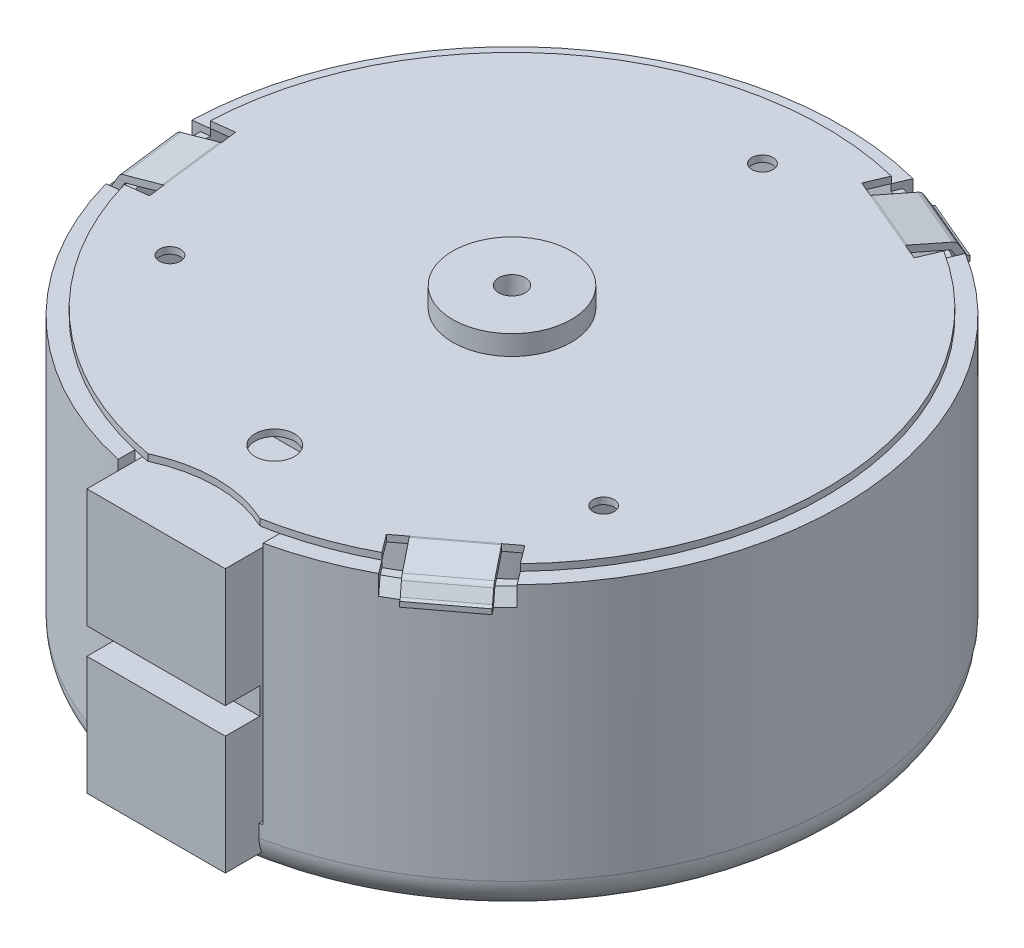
ISO-10303-21;
HEADER;
FILE_DESCRIPTION(('STEP AP214'),'2;1');
FILE_NAME('part.step','',(''),(''),'','','');
FILE_SCHEMA(('AUTOMOTIVE_DESIGN { 1 0 10303 214 1 1 1 1 }'));
ENDSEC;
DATA;
#1=APPLICATION_CONTEXT('core data for automotive mechanical design processes');
#2=APPLICATION_PROTOCOL_DEFINITION('international standard','automotive_design',2000,#1);
#3=PRODUCT_CONTEXT('',#1,'mechanical');
#4=PRODUCT('Part','Part','',(#3));
#5=PRODUCT_RELATED_PRODUCT_CATEGORY('part','',(#4));
#6=PRODUCT_DEFINITION_FORMATION('','',#4);
#7=PRODUCT_DEFINITION_CONTEXT('part definition',#1,'design');
#8=PRODUCT_DEFINITION('design','',#6,#7);
#9=PRODUCT_DEFINITION_SHAPE('','',#8);
#10=(LENGTH_UNIT() NAMED_UNIT(*) SI_UNIT(.MILLI.,.METRE.));
#11=(NAMED_UNIT(*) PLANE_ANGLE_UNIT() SI_UNIT($,.RADIAN.));
#12=(NAMED_UNIT(*) SI_UNIT($,.STERADIAN.) SOLID_ANGLE_UNIT());
#13=UNCERTAINTY_MEASURE_WITH_UNIT(LENGTH_MEASURE(1.E-05),#10,'distance_accuracy_value','');
#14=(GEOMETRIC_REPRESENTATION_CONTEXT(3) GLOBAL_UNCERTAINTY_ASSIGNED_CONTEXT((#13)) GLOBAL_UNIT_ASSIGNED_CONTEXT((#10,
#11,#12)) REPRESENTATION_CONTEXT('',''));
#15=CARTESIAN_POINT('',(0.,0.,0.));
#16=DIRECTION('',(0.,0.,1.));
#17=DIRECTION('',(1.,0.,0.));
#18=AXIS2_PLACEMENT_3D('',#15,#16,#17);
#19=CARTESIAN_POINT('',(-5.25,-20.5,27.));
#20=DIRECTION('',(0.,0.,1.));
#21=DIRECTION('',(1.,0.,0.));
#22=AXIS2_PLACEMENT_3D('',#19,#20,#21);
#23=PLANE('',#22);
#24=DIRECTION('',(1.,0.,0.));
#25=VECTOR('',#24,1.);
#26=CARTESIAN_POINT('',(-5.25,-11.5,27.));
#27=LINE('',#26,#25);
#28=CARTESIAN_POINT('',(-5.25,-11.5,27.));
#29=VERTEX_POINT('',#28);
#30=CARTESIAN_POINT('',(5.25,-11.5,27.));
#31=VERTEX_POINT('',#30);
#32=EDGE_CURVE('E577',#29,#31,#27,.T.);
#33=ORIENTED_EDGE('',*,*,#32,.F.);
#34=DIRECTION('',(0.,1.,0.));
#35=VECTOR('',#34,1.);
#36=CARTESIAN_POINT('',(-5.25,-20.5,27.));
#37=LINE('',#36,#35);
#38=CARTESIAN_POINT('',(-5.25,-20.5,27.));
#39=VERTEX_POINT('',#38);
#40=EDGE_CURVE('E636',#39,#29,#37,.T.);
#41=ORIENTED_EDGE('',*,*,#40,.F.);
#42=DIRECTION('',(1.,0.,0.));
#43=VECTOR('',#42,1.);
#44=CARTESIAN_POINT('',(-5.25,-20.5,27.));
#45=LINE('',#44,#43);
#46=CARTESIAN_POINT('',(5.25,-20.5,27.));
#47=VERTEX_POINT('',#46);
#48=EDGE_CURVE('E610',#39,#47,#45,.T.);
#49=ORIENTED_EDGE('',*,*,#48,.T.);
#50=DIRECTION('',(0.,1.,0.));
#51=VECTOR('',#50,1.);
#52=CARTESIAN_POINT('',(5.25,-20.5,27.));
#53=LINE('',#52,#51);
#54=EDGE_CURVE('E633',#47,#31,#53,.T.);
#55=ORIENTED_EDGE('',*,*,#54,.T.);
#56=EDGE_LOOP('',(#33,#41,#49,#55));
#57=FACE_BOUND('',#56,.T.);
#58=ADVANCED_FACE('F35',(#57),#23,.T.);
#59=CARTESIAN_POINT('',(0.,-18.5,0.));
#60=DIRECTION('',(0.,1.,0.));
#61=DIRECTION('',(0.,0.,1.));
#62=AXIS2_PLACEMENT_3D('',#59,#60,#61);
#63=CYLINDRICAL_SURFACE('',#62,23.75);
#64=CARTESIAN_POINT('',(0.,-18.5,0.));
#65=DIRECTION('',(0.,-1.,0.));
#66=DIRECTION('',(0.,0.,1.));
#67=AXIS2_PLACEMENT_3D('',#64,#65,#66);
#68=CIRCLE('',#67,23.75);
#69=CARTESIAN_POINT('',(-5.25,-18.5,23.1624696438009));
#70=VERTEX_POINT('',#69);
#71=CARTESIAN_POINT('',(-5.5,-18.5,23.1043827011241));
#72=VERTEX_POINT('',#71);
#73=EDGE_CURVE('E684',#70,#72,#68,.T.);
#74=ORIENTED_EDGE('',*,*,#73,.F.);
#75=DIRECTION('',(0.,1.,0.));
#76=VECTOR('',#75,1.);
#77=CARTESIAN_POINT('',(-5.25,-18.5,23.1624696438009));
#78=LINE('',#77,#76);
#79=CARTESIAN_POINT('',(-5.25,-10.,23.1624696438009));
#80=VERTEX_POINT('',#79);
#81=EDGE_CURVE('E654',#70,#80,#78,.T.);
#82=ORIENTED_EDGE('',*,*,#81,.T.);
#83=CARTESIAN_POINT('',(0.,-10.,0.));
#84=DIRECTION('',(0.,1.,0.));
#85=DIRECTION('',(0.,0.,1.));
#86=AXIS2_PLACEMENT_3D('',#83,#84,#85);
#87=CIRCLE('',#86,23.75);
#88=CARTESIAN_POINT('',(-5.5,-10.,23.1043827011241));
#89=VERTEX_POINT('',#88);
#90=EDGE_CURVE('E702',#80,#89,#87,.F.);
#91=ORIENTED_EDGE('',*,*,#90,.T.);
#92=DIRECTION('',(0.,1.,0.));
#93=VECTOR('',#92,1.);
#94=CARTESIAN_POINT('',(-5.5,-18.5,23.1043827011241));
#95=LINE('',#94,#93);
#96=EDGE_CURVE('E698',#72,#89,#95,.T.);
#97=ORIENTED_EDGE('',*,*,#96,.F.);
#98=EDGE_LOOP('',(#74,#82,#91,#97));
#99=FACE_BOUND('',#98,.T.);
#100=ADVANCED_FACE('F1476',(#99),#63,.T.);
#101=CARTESIAN_POINT('',(0.,-18.5,0.));
#102=DIRECTION('',(0.,1.,0.));
#103=DIRECTION('',(0.,0.,1.));
#104=AXIS2_PLACEMENT_3D('',#101,#102,#103);
#105=PLANE('',#104);
#106=DIRECTION('',(0.,0.,1.));
#107=VECTOR('',#106,1.);
#108=CARTESIAN_POINT('',(-5.25,-18.5,0.));
#109=LINE('',#108,#107);
#110=CARTESIAN_POINT('',(-5.25,-18.5,24.4425346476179));
#111=VERTEX_POINT('',#110);
#112=EDGE_CURVE('E1499',#70,#111,#109,.T.);
#113=ORIENTED_EDGE('',*,*,#112,.F.);
#114=ORIENTED_EDGE('',*,*,#73,.T.);
#115=DIRECTION('',(0.,0.,1.));
#116=VECTOR('',#115,1.);
#117=CARTESIAN_POINT('',(-5.5,-18.5,23.1043827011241));
#118=LINE('',#117,#116);
#119=CARTESIAN_POINT('',(-5.5,-18.5,24.3874967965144));
#120=VERTEX_POINT('',#119);
#121=EDGE_CURVE('E688',#72,#120,#118,.T.);
#122=ORIENTED_EDGE('',*,*,#121,.T.);
#123=CARTESIAN_POINT('',(0.,-18.5,0.));
#124=DIRECTION('',(0.,1.,0.));
#125=DIRECTION('',(0.,0.,1.));
#126=AXIS2_PLACEMENT_3D('',#123,#124,#125);
#127=CIRCLE('',#126,25.);
#128=EDGE_CURVE('E692',#120,#111,#127,.T.);
#129=ORIENTED_EDGE('',*,*,#128,.T.);
#130=EDGE_LOOP('',(#113,#114,#122,#129));
#131=FACE_BOUND('',#130,.T.);
#132=ADVANCED_FACE('F1481',(#131),#105,.T.);
#133=CARTESIAN_POINT('',(0.,-21.9,0.));
#134=DIRECTION('',(0.,-1.,0.));
#135=DIRECTION('',(0.,0.,-1.));
#136=AXIS2_PLACEMENT_3D('',#133,#134,#135);
#137=PLANE('',#136);
#138=CARTESIAN_POINT('',(0.,-21.9,0.));
#139=DIRECTION('',(0.,-1.,0.));
#140=DIRECTION('',(0.,0.,-1.));
#141=AXIS2_PLACEMENT_3D('',#138,#139,#140);
#142=CIRCLE('',#141,21.5);
#143=CARTESIAN_POINT('',(0.,-21.9,-21.5));
#144=VERTEX_POINT('',#143);
#145=EDGE_CURVE('E722',#144,#144,#142,.T.);
#146=ORIENTED_EDGE('',*,*,#145,.T.);
#147=EDGE_LOOP('',(#146));
#148=FACE_BOUND('',#147,.T.);
#149=CARTESIAN_POINT('',(0.,-21.9,0.));
#150=DIRECTION('',(0.,-1.,0.));
#151=DIRECTION('',(0.,0.,-1.));
#152=AXIS2_PLACEMENT_3D('',#149,#150,#151);
#153=CIRCLE('',#152,4.5);
#154=CARTESIAN_POINT('',(0.,-21.9,-4.5));
#155=VERTEX_POINT('',#154);
#156=EDGE_CURVE('E715',#155,#155,#153,.T.);
#157=ORIENTED_EDGE('',*,*,#156,.F.);
#158=EDGE_LOOP('',(#157));
#159=FACE_BOUND('',#158,.T.);
#160=ADVANCED_FACE('F1471',(#148,#159),#137,.T.);
#161=CARTESIAN_POINT('',(0.,0.5,0.));
#162=DIRECTION('',(0.,1.,0.));
#163=DIRECTION('',(0.,0.,1.));
#164=AXIS2_PLACEMENT_3D('',#161,#162,#163);
#165=PLANE('',#164);
#166=CARTESIAN_POINT('',(-16.4544826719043,0.5,9.50000000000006));
#167=DIRECTION('',(0.,1.,0.));
#168=DIRECTION('',(0.,0.,1.));
#169=AXIS2_PLACEMENT_3D('',#166,#167,#168);
#170=CIRCLE('',#169,0.799999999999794);
#171=CARTESIAN_POINT('',(-16.4544826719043,0.5,10.2999999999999));
#172=VERTEX_POINT('',#171);
#173=EDGE_CURVE('E725',#172,#172,#170,.T.);
#174=ORIENTED_EDGE('',*,*,#173,.F.);
#175=EDGE_LOOP('',(#174));
#176=FACE_BOUND('',#175,.T.);
#177=CARTESIAN_POINT('',(16.4544826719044,0.5,9.50000000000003));
#178=DIRECTION('',(0.,1.,0.));
#179=DIRECTION('',(0.,0.,1.));
#180=AXIS2_PLACEMENT_3D('',#177,#178,#179);
#181=CIRCLE('',#180,0.799999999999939);
#182=CARTESIAN_POINT('',(16.4544826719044,0.5,10.3));
#183=VERTEX_POINT('',#182);
#184=EDGE_CURVE('E731',#183,#183,#181,.T.);
#185=ORIENTED_EDGE('',*,*,#184,.F.);
#186=EDGE_LOOP('',(#185));
#187=FACE_BOUND('',#186,.T.);
#188=CARTESIAN_POINT('',(0.,0.5,-19.));
#189=DIRECTION('',(0.,1.,0.));
#190=DIRECTION('',(0.,0.,1.));
#191=AXIS2_PLACEMENT_3D('',#188,#189,#190);
#192=CIRCLE('',#191,0.8);
#193=CARTESIAN_POINT('',(0.,0.5,-18.2));
#194=VERTEX_POINT('',#193);
#195=EDGE_CURVE('E735',#194,#194,#192,.T.);
#196=ORIENTED_EDGE('',*,*,#195,.F.);
#197=EDGE_LOOP('',(#196));
#198=FACE_BOUND('',#197,.T.);
#199=CARTESIAN_POINT('',(0.,0.5,0.));
#200=DIRECTION('',(0.,1.,0.));
#201=DIRECTION('',(0.,0.,1.));
#202=AXIS2_PLACEMENT_3D('',#199,#200,#201);
#203=CIRCLE('',#202,23.76);
#204=CARTESIAN_POINT('',(4.25,0.5,23.3768068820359));
#205=VERTEX_POINT('',#204);
#206=CARTESIAN_POINT('',(11.1250247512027,0.5,20.9945570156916));
#207=VERTEX_POINT('',#206);
#208=EDGE_CURVE('E1004',#205,#207,#203,.T.);
#209=ORIENTED_EDGE('',*,*,#208,.T.);
#210=DIRECTION('',(-0.601815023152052,0.,-0.79863551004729));
#211=VECTOR('',#210,1.);
#212=CARTESIAN_POINT('',(10.0945935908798,0.5,19.6271286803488));
#213=LINE('',#212,#211);
#214=CARTESIAN_POINT('',(10.0945935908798,0.5,19.6271286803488));
#215=VERTEX_POINT('',#214);
#216=EDGE_CURVE('E1007',#207,#215,#213,.T.);
#217=ORIENTED_EDGE('',*,*,#216,.T.);
#218=DIRECTION('',(0.798635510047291,0.,-0.601815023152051));
#219=VECTOR('',#218,1.);
#220=CARTESIAN_POINT('',(16.0843599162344,0.5,15.1135160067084));
#221=LINE('',#220,#219);
#222=CARTESIAN_POINT('',(11.092887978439,0.5,18.8748599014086));
#223=VERTEX_POINT('',#222);
#224=EDGE_CURVE('E1011',#215,#223,#221,.T.);
#225=ORIENTED_EDGE('',*,*,#224,.T.);
#226=DIRECTION('',(0.798635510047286,0.,-0.601815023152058));
#227=VECTOR('',#226,1.);
#228=CARTESIAN_POINT('',(11.092887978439,0.5,18.8748599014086));
#229=LINE('',#228,#227);
#230=CARTESIAN_POINT('',(15.0860655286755,0.5,15.8657847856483));
#231=VERTEX_POINT('',#230);
#232=EDGE_CURVE('E829',#223,#231,#229,.T.);
#233=ORIENTED_EDGE('',*,*,#232,.T.);
#234=CARTESIAN_POINT('',(16.0843599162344,0.5,15.1135160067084));
#235=VERTEX_POINT('',#234);
#236=EDGE_CURVE('E1010',#231,#235,#221,.T.);
#237=ORIENTED_EDGE('',*,*,#236,.T.);
#238=DIRECTION('',(0.601815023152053,0.,0.798635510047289));
#239=VECTOR('',#238,1.);
#240=CARTESIAN_POINT('',(17.1147910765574,0.5,16.4809443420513));
#241=LINE('',#240,#239);
#242=CARTESIAN_POINT('',(17.1147910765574,0.5,16.4809443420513));
#243=VERTEX_POINT('',#242);
#244=EDGE_CURVE('E1014',#235,#243,#241,.T.);
#245=ORIENTED_EDGE('',*,*,#244,.T.);
#246=CARTESIAN_POINT('',(0.,0.5,0.));
#247=DIRECTION('',(0.,1.,0.));
#248=DIRECTION('',(0.,0.,1.));
#249=AXIS2_PLACEMENT_3D('',#246,#247,#248);
#250=CIRCLE('',#249,23.76);
#251=CARTESIAN_POINT('',(12.6193073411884,0.5,-20.131832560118));
#252=VERTEX_POINT('',#251);
#253=EDGE_CURVE('E1016',#243,#252,#250,.T.);
#254=ORIENTED_EDGE('',*,*,#253,.T.);
#255=DIRECTION('',(-0.390731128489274,0.,0.92050485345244));
#256=VECTOR('',#255,1.);
#257=CARTESIAN_POINT('',(11.9502952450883,0.5,-18.5557388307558));
#258=LINE('',#257,#256);
#259=CARTESIAN_POINT('',(11.9502952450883,0.5,-18.5557388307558));
#260=VERTEX_POINT('',#259);
#261=EDGE_CURVE('E1018',#252,#260,#258,.T.);
#262=ORIENTED_EDGE('',*,*,#261,.T.);
#263=DIRECTION('',(-0.92050485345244,0.,-0.390731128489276));
#264=VECTOR('',#263,1.);
#265=CARTESIAN_POINT('',(5.04650884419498,0.5,-21.4862222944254));
#266=LINE('',#265,#264);
#267=CARTESIAN_POINT('',(10.7996641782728,0.5,-19.0441527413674));
#268=VERTEX_POINT('',#267);
#269=EDGE_CURVE('E1021',#260,#268,#266,.T.);
#270=ORIENTED_EDGE('',*,*,#269,.T.);
#271=DIRECTION('',(-0.920504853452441,0.,-0.390731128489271));
#272=VECTOR('',#271,1.);
#273=CARTESIAN_POINT('',(10.7996641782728,0.5,-19.0441527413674));
#274=LINE('',#273,#272);
#275=CARTESIAN_POINT('',(6.19713991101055,0.5,-20.9978083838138));
#276=VERTEX_POINT('',#275);
#277=EDGE_CURVE('E995',#268,#276,#274,.T.);
#278=ORIENTED_EDGE('',*,*,#277,.T.);
#279=CARTESIAN_POINT('',(5.04650884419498,0.5,-21.4862222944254));
#280=VERTEX_POINT('',#279);
#281=EDGE_CURVE('E1020',#276,#280,#266,.T.);
#282=ORIENTED_EDGE('',*,*,#281,.T.);
#283=DIRECTION('',(0.390731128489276,0.,-0.920504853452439));
#284=VECTOR('',#283,1.);
#285=CARTESIAN_POINT('',(5.7155209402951,0.5,-23.0623160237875));
#286=LINE('',#285,#284);
#287=CARTESIAN_POINT('',(5.7155209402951,0.5,-23.0623160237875));
#288=VERTEX_POINT('',#287);
#289=EDGE_CURVE('E1024',#280,#288,#286,.T.);
#290=ORIENTED_EDGE('',*,*,#289,.T.);
#291=CARTESIAN_POINT('',(0.,0.5,0.));
#292=DIRECTION('',(0.,1.,0.));
#293=DIRECTION('',(0.,0.,1.));
#294=AXIS2_PLACEMENT_3D('',#291,#292,#293);
#295=CIRCLE('',#294,23.76);
#296=CARTESIAN_POINT('',(-23.7443320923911,0.5,-0.862724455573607));
#297=VERTEX_POINT('',#296);
#298=EDGE_CURVE('E1026',#288,#297,#295,.T.);
#299=ORIENTED_EDGE('',*,*,#298,.T.);
#300=DIRECTION('',(0.992546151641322,0.,-0.121869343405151));
#301=VECTOR('',#300,1.);
#302=CARTESIAN_POINT('',(-23.7443320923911,0.5,-0.862724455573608));
#303=LINE('',#302,#301);
#304=CARTESIAN_POINT('',(-22.0448888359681,0.5,-1.07138984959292));
#305=VERTEX_POINT('',#304);
#306=EDGE_CURVE('E1028',#297,#305,#303,.T.);
#307=ORIENTED_EDGE('',*,*,#306,.T.);
#308=DIRECTION('',(0.121869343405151,0.,0.992546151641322));
#309=VECTOR('',#308,1.);
#310=CARTESIAN_POINT('',(-22.0448888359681,0.5,-1.07138984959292));
#311=LINE('',#310,#309);
#312=CARTESIAN_POINT('',(-21.8925521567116,0.5,0.169292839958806));
#313=VERTEX_POINT('',#312);
#314=EDGE_CURVE('E1031',#305,#313,#311,.T.);
#315=ORIENTED_EDGE('',*,*,#314,.T.);
#316=DIRECTION('',(0.121869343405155,0.,0.992546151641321));
#317=VECTOR('',#316,1.);
#318=CARTESIAN_POINT('',(-21.8925521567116,0.5,0.169292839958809));
#319=LINE('',#318,#317);
#320=CARTESIAN_POINT('',(-21.2832054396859,0.5,5.13202359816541));
#321=VERTEX_POINT('',#320);
#322=EDGE_CURVE('E912',#313,#321,#319,.T.);
#323=ORIENTED_EDGE('',*,*,#322,.T.);
#324=CARTESIAN_POINT('',(-21.1308687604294,0.5,6.37270628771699));
#325=VERTEX_POINT('',#324);
#326=EDGE_CURVE('E1030',#321,#325,#311,.T.);
#327=ORIENTED_EDGE('',*,*,#326,.T.);
#328=DIRECTION('',(-0.992546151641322,0.,0.12186934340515));
#329=VECTOR('',#328,1.);
#330=CARTESIAN_POINT('',(-22.8303120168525,0.5,6.5813716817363));
#331=LINE('',#330,#329);
#332=CARTESIAN_POINT('',(-22.8303120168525,0.5,6.5813716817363));
#333=VERTEX_POINT('',#332);
#334=EDGE_CURVE('E1034',#325,#333,#331,.T.);
#335=ORIENTED_EDGE('',*,*,#334,.T.);
#336=CARTESIAN_POINT('',(0.,0.5,0.));
#337=DIRECTION('',(0.,1.,0.));
#338=DIRECTION('',(0.,0.,1.));
#339=AXIS2_PLACEMENT_3D('',#336,#337,#338);
#340=CIRCLE('',#339,23.76);
#341=CARTESIAN_POINT('',(-4.25,0.5,23.3768068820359));
#342=VERTEX_POINT('',#341);
#343=EDGE_CURVE('E1036',#333,#342,#340,.T.);
#344=ORIENTED_EDGE('',*,*,#343,.T.);
#345=CARTESIAN_POINT('',(0.,0.5,32.4287403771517));
#346=DIRECTION('',(0.,-1.,0.));
#347=DIRECTION('',(0.,0.,1.));
#348=AXIS2_PLACEMENT_3D('',#345,#346,#347);
#349=CIRCLE('',#348,9.99999999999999);
#350=EDGE_CURVE('E1038',#342,#205,#349,.T.);
#351=ORIENTED_EDGE('',*,*,#350,.T.);
#352=EDGE_LOOP('',(#209,#217,#225,#233,#237,#245,#254,#262,#270,#278,#282,#290,#299,#307,#315,
#323,#327,#335,#344,#351));
#353=FACE_BOUND('',#352,.T.);
#354=CARTESIAN_POINT('',(0.,0.5,18.));
#355=DIRECTION('',(0.,1.,0.));
#356=DIRECTION('',(0.,0.,1.));
#357=AXIS2_PLACEMENT_3D('',#354,#355,#356);
#358=CIRCLE('',#357,1.5);
#359=CARTESIAN_POINT('',(0.,0.5,19.5));
#360=VERTEX_POINT('',#359);
#361=EDGE_CURVE('E998',#360,#360,#358,.T.);
#362=ORIENTED_EDGE('',*,*,#361,.F.);
#363=EDGE_LOOP('',(#362));
#364=FACE_BOUND('',#363,.T.);
#365=CARTESIAN_POINT('',(0.,0.5,0.));
#366=DIRECTION('',(0.,1.,0.));
#367=DIRECTION('',(0.,0.,1.));
#368=AXIS2_PLACEMENT_3D('',#365,#366,#367);
#369=CIRCLE('',#368,4.5);
#370=CARTESIAN_POINT('',(0.,0.5,4.5));
#371=VERTEX_POINT('',#370);
#372=EDGE_CURVE('E742',#371,#371,#369,.T.);
#373=ORIENTED_EDGE('',*,*,#372,.F.);
#374=EDGE_LOOP('',(#373));
#375=FACE_BOUND('',#374,.T.);
#376=ADVANCED_FACE('F1467',(#176,#187,#198,#353,#364,#375),#165,.T.);
#377=CARTESIAN_POINT('',(0.,-0.5,0.));
#378=DIRECTION('',(0.,1.,0.));
#379=DIRECTION('',(0.,0.,1.));
#380=AXIS2_PLACEMENT_3D('',#377,#378,#379);
#381=PLANE('',#380);
#382=CARTESIAN_POINT('',(0.,-0.5,0.));
#383=DIRECTION('',(0.,1.,0.));
#384=DIRECTION('',(0.,0.,1.));
#385=AXIS2_PLACEMENT_3D('',#382,#383,#384);
#386=CIRCLE('',#385,24.4226497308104);
#387=CARTESIAN_POINT('',(11.528739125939,-0.5,21.5303040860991));
#388=VERTEX_POINT('',#387);
#389=CARTESIAN_POINT('',(13.8359974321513,-0.5,20.1253818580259));
#390=VERTEX_POINT('',#389);
#391=EDGE_CURVE('E1236',#388,#390,#386,.T.);
#392=ORIENTED_EDGE('',*,*,#391,.T.);
#393=DIRECTION('',(0.798635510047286,0.,-0.601815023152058));
#394=VECTOR('',#393,1.);
#395=CARTESIAN_POINT('',(12.6874304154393,-0.5,20.9908891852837));
#396=LINE('',#395,#394);
#397=CARTESIAN_POINT('',(15.5320409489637,-0.5,18.8473213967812));
#398=VERTEX_POINT('',#397);
#399=EDGE_CURVE('E826',#390,#398,#396,.T.);
#400=ORIENTED_EDGE('',*,*,#399,.T.);
#401=CARTESIAN_POINT('',(17.5185054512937,-0.5,17.0166914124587));
#402=VERTEX_POINT('',#401);
#403=EDGE_CURVE('E1235',#398,#402,#386,.T.);
#404=ORIENTED_EDGE('',*,*,#403,.T.);
#405=DIRECTION('',(-0.601815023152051,0.,-0.798635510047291));
#406=VECTOR('',#405,1.);
#407=CARTESIAN_POINT('',(17.8700353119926,-0.5,17.4831872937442));
#408=LINE('',#407,#406);
#409=CARTESIAN_POINT('',(17.1086965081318,-0.5,16.472856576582));
#410=VERTEX_POINT('',#409);
#411=EDGE_CURVE('E1168',#402,#410,#408,.T.);
#412=ORIENTED_EDGE('',*,*,#411,.T.);
#413=CARTESIAN_POINT('',(0.,-0.5,0.));
#414=DIRECTION('',(0.,-1.,0.));
#415=DIRECTION('',(0.,0.,1.));
#416=AXIS2_PLACEMENT_3D('',#413,#414,#415);
#417=CIRCLE('',#416,23.75);
#418=CARTESIAN_POINT('',(11.1189301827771,-0.5,20.9864692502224));
#419=VERTEX_POINT('',#418);
#420=EDGE_CURVE('E1161',#410,#419,#417,.T.);
#421=ORIENTED_EDGE('',*,*,#420,.T.);
#422=DIRECTION('',(0.601815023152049,0.,0.798635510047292));
#423=VECTOR('',#422,1.);
#424=CARTESIAN_POINT('',(11.8802689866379,-0.5,21.9967999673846));
#425=LINE('',#424,#423);
#426=EDGE_CURVE('E1164',#419,#388,#425,.T.);
#427=ORIENTED_EDGE('',*,*,#426,.T.);
#428=EDGE_LOOP('',(#392,#400,#404,#412,#421,#427));
#429=FACE_BOUND('',#428,.T.);
#430=ADVANCED_FACE('F1277',(#429),#381,.T.);
#431=CARTESIAN_POINT('',(0.,-0.5,0.));
#432=DIRECTION('',(0.,-1.,0.));
#433=DIRECTION('',(0.,0.,-1.));
#434=AXIS2_PLACEMENT_3D('',#431,#432,#433);
#435=CONICAL_SURFACE('',#434,24.4226497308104,0.523598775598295);
#436=ORIENTED_EDGE('',*,*,#403,.F.);
#437=CARTESIAN_POINT('',(15.5319694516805,-0.499800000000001,18.8472306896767));
#438=CARTESIAN_POINT('',(15.5820413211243,-0.639866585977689,18.9107558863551));
#439=CARTESIAN_POINT('',(15.6321097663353,-0.779933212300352,18.9742836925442));
#440=CARTESIAN_POINT('',(15.7322398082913,-1.06006654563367,19.1013445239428));
#441=CARTESIAN_POINT('',(15.7823014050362,-1.20013325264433,19.1648775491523));
#442=CARTESIAN_POINT('',(15.8323595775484,-1.34019999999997,19.2284131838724));
#443=B_SPLINE_CURVE_WITH_KNOTS('',3,(#437,#438,#439,#440,#441,#442),.UNSPECIFIED.,.F.,.F.,(4,2,
4),(0.,0.485233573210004,0.970467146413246),.UNSPECIFIED.);
#444=CARTESIAN_POINT('',(15.8322880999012,-1.33999999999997,19.2283224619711));
#445=VERTEX_POINT('',#444);
#446=EDGE_CURVE('E1300',#398,#445,#443,.T.);
#447=ORIENTED_EDGE('',*,*,#446,.T.);
#448=CARTESIAN_POINT('',(15.817626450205,-1.32379999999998,19.2282757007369));
#449=CARTESIAN_POINT('',(15.819271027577,-1.32494737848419,19.2277806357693));
#450=CARTESIAN_POINT('',(15.8209209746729,-1.32617134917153,19.227338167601));
#451=CARTESIAN_POINT('',(15.8241443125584,-1.32884991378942,19.2266883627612));
#452=CARTESIAN_POINT('',(15.82571449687,-1.33030977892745,19.2264875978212));
#453=CARTESIAN_POINT('',(15.8277994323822,-1.33260984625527,19.2264912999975));
#454=CARTESIAN_POINT('',(15.8284200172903,-1.3333497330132,19.2265337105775));
#455=CARTESIAN_POINT('',(15.8295769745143,-1.33487518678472,19.2267220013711));
#456=CARTESIAN_POINT('',(15.8301138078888,-1.33566046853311,19.2268672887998));
#457=CARTESIAN_POINT('',(15.8310838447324,-1.33727924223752,19.2272792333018));
#458=CARTESIAN_POINT('',(15.8315155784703,-1.3381132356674,19.2275474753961));
#459=CARTESIAN_POINT('',(15.8322369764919,-1.33979335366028,19.2282100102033));
#460=CARTESIAN_POINT('',(15.8325266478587,-1.3406394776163,19.22860429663));
#461=CARTESIAN_POINT('',(15.8329291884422,-1.34221604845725,19.2294519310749));
#462=CARTESIAN_POINT('',(15.8330583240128,-1.34294877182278,19.2298935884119));
#463=CARTESIAN_POINT('',(15.8332043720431,-1.34438070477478,19.2308442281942));
#464=CARTESIAN_POINT('',(15.8332211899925,-1.34507988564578,19.2313532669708));
#465=CARTESIAN_POINT('',(15.8331417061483,-1.34679188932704,19.2326990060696));
#466=CARTESIAN_POINT('',(15.8329813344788,-1.34777651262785,19.2335673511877));
#467=CARTESIAN_POINT('',(15.8324964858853,-1.3496451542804,19.2353638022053));
#468=CARTESIAN_POINT('',(15.8321715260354,-1.35052886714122,19.236292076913));
#469=CARTESIAN_POINT('',(15.831043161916,-1.35300947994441,19.2390755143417));
#470=CARTESIAN_POINT('',(15.8300787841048,-1.35448446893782,19.240971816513));
#471=CARTESIAN_POINT('',(15.8279096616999,-1.35720404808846,19.2447892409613));
#472=CARTESIAN_POINT('',(15.8267041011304,-1.35844782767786,19.2467104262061));
#473=CARTESIAN_POINT('',(15.8207574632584,-1.36390983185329,19.255681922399));
#474=CARTESIAN_POINT('',(15.8151790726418,-1.36719269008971,19.2627165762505));
#475=CARTESIAN_POINT('',(15.8034863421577,-1.37298939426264,19.2766386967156));
#476=CARTESIAN_POINT('',(15.7973687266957,-1.37549805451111,19.2835248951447));
#477=CARTESIAN_POINT('',(15.7787269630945,-1.38228153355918,19.3038462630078));
#478=CARTESIAN_POINT('',(15.7657729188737,-1.38589304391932,19.3171193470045));
#479=CARTESIAN_POINT('',(15.7393868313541,-1.3922955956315,19.3433905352));
#480=CARTESIAN_POINT('',(15.7259539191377,-1.39508505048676,19.3563880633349));
#481=CARTESIAN_POINT('',(15.6852832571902,-1.40264875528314,19.3950030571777));
#482=CARTESIAN_POINT('',(15.6576048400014,-1.40663728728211,19.4203133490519));
#483=CARTESIAN_POINT('',(15.5738916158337,-1.4169954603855,19.4952724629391));
#484=CARTESIAN_POINT('',(15.5169883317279,-1.42179724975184,19.5441350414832));
#485=CARTESIAN_POINT('',(15.4018563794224,-1.4293147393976,19.6405096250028));
#486=CARTESIAN_POINT('',(15.3436265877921,-1.43202859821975,19.688020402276));
#487=CARTESIAN_POINT('',(15.2261535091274,-1.43595817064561,19.7818740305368));
#488=CARTESIAN_POINT('',(15.1669098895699,-1.43717338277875,19.8282164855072));
#489=CARTESIAN_POINT('',(15.0475745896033,-1.43834511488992,19.9197790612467));
#490=CARTESIAN_POINT('',(14.9874831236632,-1.43830194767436,19.9649994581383));
#491=CARTESIAN_POINT('',(14.859474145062,-1.43686564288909,20.059458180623));
#492=CARTESIAN_POINT('',(14.7914550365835,-1.43531700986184,20.1085566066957));
#493=CARTESIAN_POINT('',(14.6543376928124,-1.43030225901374,20.2051238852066));
#494=CARTESIAN_POINT('',(14.585239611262,-1.42683641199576,20.2525929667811));
#495=CARTESIAN_POINT('',(14.4820185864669,-1.41938316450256,20.3211148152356));
#496=CARTESIAN_POINT('',(14.4484064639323,-1.41660567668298,20.34305985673));
#497=CARTESIAN_POINT('',(14.3808166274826,-1.40994130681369,20.3861877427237));
#498=CARTESIAN_POINT('',(14.3468389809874,-1.40605462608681,20.4073707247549));
#499=CARTESIAN_POINT('',(14.2804307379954,-1.39674851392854,20.4473380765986));
#500=CARTESIAN_POINT('',(14.248029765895,-1.39143514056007,20.4661900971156));
#501=CARTESIAN_POINT('',(14.199946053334,-1.38047594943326,20.4918576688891));
#502=CARTESIAN_POINT('',(14.1845095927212,-1.37650071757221,20.4997545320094));
#503=CARTESIAN_POINT('',(14.1615734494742,-1.36877311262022,20.51017913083));
#504=CARTESIAN_POINT('',(14.154104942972,-1.36597216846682,20.5133689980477));
#505=CARTESIAN_POINT('',(14.1440516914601,-1.36126522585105,20.5170002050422));
#506=CARTESIAN_POINT('',(14.1413785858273,-1.35992112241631,20.5179002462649));
#507=CARTESIAN_POINT('',(14.1361102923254,-1.35697334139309,20.5194636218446));
#508=CARTESIAN_POINT('',(14.133514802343,-1.35537088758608,20.5201280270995));
#509=CARTESIAN_POINT('',(14.1300474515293,-1.35285828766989,20.5207544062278));
#510=CARTESIAN_POINT('',(14.1290864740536,-1.35211905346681,20.520897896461));
#511=CARTESIAN_POINT('',(14.127215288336,-1.35056331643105,20.5210956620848));
#512=CARTESIAN_POINT('',(14.1263051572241,-1.34974670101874,20.5211498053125));
#513=CARTESIAN_POINT('',(14.1245564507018,-1.34801434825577,20.521139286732));
#514=CARTESIAN_POINT('',(14.1237190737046,-1.34709736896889,20.5210729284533));
#515=CARTESIAN_POINT('',(14.1221869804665,-1.3451745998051,20.520779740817));
#516=CARTESIAN_POINT('',(14.1214917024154,-1.34416918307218,20.5205535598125));
#517=CARTESIAN_POINT('',(14.1204892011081,-1.34241134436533,20.520011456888));
#518=CARTESIAN_POINT('',(14.1201282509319,-1.34167479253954,20.5197436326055));
#519=CARTESIAN_POINT('',(14.1195253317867,-1.3401909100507,20.5191185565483));
#520=CARTESIAN_POINT('',(14.1192833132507,-1.3394435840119,20.5187613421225));
#521=CARTESIAN_POINT('',(14.1189244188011,-1.33796235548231,20.5179702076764));
#522=CARTESIAN_POINT('',(14.1188072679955,-1.33722842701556,20.5175364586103));
#523=CARTESIAN_POINT('',(14.118688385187,-1.33578963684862,20.5166099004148));
#524=CARTESIAN_POINT('',(14.1186867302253,-1.33508479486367,20.516117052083));
#525=CARTESIAN_POINT('',(14.118808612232,-1.33334049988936,20.5148106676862));
#526=CARTESIAN_POINT('',(14.1190007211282,-1.33232753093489,20.5139684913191));
#527=CARTESIAN_POINT('',(14.119554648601,-1.33039381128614,20.5122318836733));
#528=CARTESIAN_POINT('',(14.1199174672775,-1.32947364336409,20.5113371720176));
#529=CARTESIAN_POINT('',(14.1211928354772,-1.32684771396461,20.5086185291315));
#530=CARTESIAN_POINT('',(14.122293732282,-1.32526783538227,20.5067530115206));
#531=CARTESIAN_POINT('',(14.1234761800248,-1.32379999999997,20.5049094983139));
#532=B_SPLINE_CURVE_WITH_KNOTS('',3,(#448,#449,#450,#451,#452,#453,#454,#455,#456,#457,#458,
#459,#460,#461,#462,#463,#464,#465,#466,#467,#468,#469,#470,#471,#472,#473,#474,#475,#476,#477,
#478,#479,#480,#481,#482,#483,#484,#485,#486,#487,#488,#489,#490,#491,#492,#493,#494,#495,#496,
#497,#498,#499,#500,#501,#502,#503,#504,#505,#506,#507,#508,#509,#510,#511,#512,#513,#514,#515,
#516,#517,#518,#519,#520,#521,#522,#523,#524,#525,#526,#527,#528,#529,#530,#531),.UNSPECIFIED.,
.F.,.F.,(4,2,2,2,2,2,2,2,2,2,2,2,2,2,2,2,2,2,2,2,2,2,2,2,2,2,2,2,2,2,2,2,2,2,2,2,2,2,2,2,2,4),
(0.,0.00625180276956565,0.0126700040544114,0.0155613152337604,0.0184361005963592,
0.0213490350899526,0.0242618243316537,0.026845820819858,0.029431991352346,0.0333768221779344,
0.037333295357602,0.0450561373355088,0.0528055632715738,0.0812678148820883,0.109916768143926,
0.166503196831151,0.223198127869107,0.336287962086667,0.561663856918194,0.787238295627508,
1.01288819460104,1.23848200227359,1.49015710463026,1.74179666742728,1.86248977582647,
1.98316099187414,2.09658584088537,2.14986008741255,2.17553527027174,2.18489924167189,
2.19422009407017,2.19787783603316,2.20154098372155,2.20525610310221,2.20895623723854,
2.21153293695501,2.21410856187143,2.21667850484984,2.21925016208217,2.22322035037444,
2.22721409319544,2.23516842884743),.UNSPECIFIED.);
#533=CARTESIAN_POINT('',(14.119479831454,-1.33999999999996,20.5190160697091));
#534=VERTEX_POINT('',#533);
#535=EDGE_CURVE('E1287',#445,#534,#532,.T.);
#536=ORIENTED_EDGE('',*,*,#535,.T.);
#537=CARTESIAN_POINT('',(14.119547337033,-1.34019999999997,20.5191097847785));
#538=CARTESIAN_POINT('',(14.0722708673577,-1.20013325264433,20.4534779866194));
#539=CARTESIAN_POINT('',(14.0249978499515,-1.06006654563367,20.3878436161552));
#540=CARTESIAN_POINT('',(13.9304587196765,-0.779933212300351,20.2565697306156));
#541=CARTESIAN_POINT('',(13.8831926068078,-0.639866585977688,20.1909302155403));
#542=CARTESIAN_POINT('',(13.8359299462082,-0.4998,20.1252881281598));
#543=B_SPLINE_CURVE_WITH_KNOTS('',3,(#537,#538,#539,#540,#541,#542),.UNSPECIFIED.,.F.,.F.,(4,2,
4),(0.,0.485233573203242,0.970467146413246),.UNSPECIFIED.);
#544=EDGE_CURVE('E1294',#534,#390,#543,.T.);
#545=ORIENTED_EDGE('',*,*,#544,.T.);
#546=ORIENTED_EDGE('',*,*,#391,.F.);
#547=CARTESIAN_POINT('',(11.8802689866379,-1.49999999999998,21.9967999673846));
#548=CARTESIAN_POINT('',(11.8216927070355,-1.33332165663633,21.9190666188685));
#549=CARTESIAN_POINT('',(11.7631104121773,-1.16664915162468,21.8413252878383));
#550=CARTESIAN_POINT('',(11.6459337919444,-0.833315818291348,21.6858266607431));
#551=CARTESIAN_POINT('',(11.5873394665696,-0.666654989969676,21.6080693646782));
#552=CARTESIAN_POINT('',(11.528739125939,-0.499999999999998,21.5303040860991));
#553=B_SPLINE_CURVE_WITH_KNOTS('',3,(#547,#548,#549,#550,#551,#552),.UNSPECIFIED.,.F.,.F.,(4,2,
4),(0.,0.579049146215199,1.15809829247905),.UNSPECIFIED.);
#554=CARTESIAN_POINT('',(11.8802689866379,-1.49999999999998,21.9967999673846));
#555=VERTEX_POINT('',#554);
#556=EDGE_CURVE('E1263',#555,#388,#553,.T.);
#557=ORIENTED_EDGE('',*,*,#556,.F.);
#558=CARTESIAN_POINT('',(0.,-1.49999999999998,0.));
#559=DIRECTION('',(0.,1.,0.));
#560=DIRECTION('',(0.,0.,1.));
#561=AXIS2_PLACEMENT_3D('',#558,#559,#560);
#562=CIRCLE('',#561,25.);
#563=CARTESIAN_POINT('',(17.8700353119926,-1.49999999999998,17.4831872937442));
#564=VERTEX_POINT('',#563);
#565=EDGE_CURVE('E1245',#564,#555,#562,.F.);
#566=ORIENTED_EDGE('',*,*,#565,.F.);
#567=CARTESIAN_POINT('',(17.5185054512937,-0.5,17.0166914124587));
#568=CARTESIAN_POINT('',(17.5771057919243,-0.666654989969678,17.0944566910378));
#569=CARTESIAN_POINT('',(17.635700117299,-0.83331581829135,17.1722139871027));
#570=CARTESIAN_POINT('',(17.752876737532,-1.16664915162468,17.3277126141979));
#571=CARTESIAN_POINT('',(17.8114590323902,-1.33332165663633,17.4054539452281));
#572=CARTESIAN_POINT('',(17.8700353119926,-1.49999999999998,17.4831872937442));
#573=B_SPLINE_CURVE_WITH_KNOTS('',3,(#567,#568,#569,#570,#571,#572),.UNSPECIFIED.,.F.,.F.,(4,2,
4),(0.,0.579049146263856,1.15809829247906),.UNSPECIFIED.);
#574=EDGE_CURVE('E1256',#402,#564,#573,.T.);
#575=ORIENTED_EDGE('',*,*,#574,.F.);
#576=EDGE_LOOP('',(#436,#447,#536,#545,#546,#557,#566,#575));
#577=FACE_BOUND('',#576,.T.);
#578=ADVANCED_FACE('F1272',(#577),#435,.T.);
#579=CARTESIAN_POINT('',(16.0843599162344,0.5,15.1135160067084));
#580=DIRECTION('',(-0.601815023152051,0.,-0.798635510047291));
#581=DIRECTION('',(-0.798635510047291,0.,0.601815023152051));
#582=AXIS2_PLACEMENT_3D('',#579,#580,#581);
#583=PLANE('',#582);
#584=DIRECTION('',(0.,-1.,0.));
#585=VECTOR('',#584,1.);
#586=CARTESIAN_POINT('',(15.0860655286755,0.5,15.8657847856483));
#587=LINE('',#586,#585);
#588=CARTESIAN_POINT('',(15.0860655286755,0.,15.8657847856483));
#589=VERTEX_POINT('',#588);
#590=EDGE_CURVE('E777',#231,#589,#587,.T.);
#591=ORIENTED_EDGE('',*,*,#590,.T.);
#592=DIRECTION('',(0.798635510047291,0.,-0.601815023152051));
#593=VECTOR('',#592,1.);
#594=CARTESIAN_POINT('',(16.0843599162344,0.,15.1135160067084));
#595=LINE('',#594,#593);
#596=CARTESIAN_POINT('',(16.0843599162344,0.,15.1135160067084));
#597=VERTEX_POINT('',#596);
#598=EDGE_CURVE('E1046',#589,#597,#595,.T.);
#599=ORIENTED_EDGE('',*,*,#598,.T.);
#600=DIRECTION('',(0.,-1.,0.));
#601=VECTOR('',#600,1.);
#602=CARTESIAN_POINT('',(16.0843599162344,0.5,15.1135160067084));
#603=LINE('',#602,#601);
#604=EDGE_CURVE('E1107',#235,#597,#603,.T.);
#605=ORIENTED_EDGE('',*,*,#604,.F.);
#606=ORIENTED_EDGE('',*,*,#236,.F.);
#607=EDGE_LOOP('',(#591,#599,#605,#606));
#608=FACE_BOUND('',#607,.T.);
#609=ADVANCED_FACE('F1276',(#608),#583,.F.);
#610=CARTESIAN_POINT('',(0.,-0.5,0.));
#611=DIRECTION('',(0.,1.,0.));
#612=DIRECTION('',(0.,0.,1.));
#613=AXIS2_PLACEMENT_3D('',#610,#611,#612);
#614=PLANE('',#613);
#615=CARTESIAN_POINT('',(0.,-0.5,0.));
#616=DIRECTION('',(0.,1.,0.));
#617=DIRECTION('',(0.,0.,1.));
#618=AXIS2_PLACEMENT_3D('',#615,#616,#617);
#619=CIRCLE('',#618,24.4226497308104);
#620=CARTESIAN_POINT('',(-24.4101598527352,-0.5,-0.780971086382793));
#621=VERTEX_POINT('',#620);
#622=CARTESIAN_POINT('',(-24.3470906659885,-0.5,1.9196343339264));
#623=VERTEX_POINT('',#622);
#624=EDGE_CURVE('E1249',#621,#623,#619,.T.);
#625=ORIENTED_EDGE('',*,*,#624,.T.);
#626=DIRECTION('',(0.121869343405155,0.,0.992546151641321));
#627=VECTOR('',#626,1.);
#628=CARTESIAN_POINT('',(-24.5223584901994,-0.5,0.492192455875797));
#629=LINE('',#628,#627);
#630=CARTESIAN_POINT('',(-24.0882795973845,-0.5,4.02748133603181));
#631=VERTEX_POINT('',#630);
#632=EDGE_CURVE('E909',#623,#631,#629,.T.);
#633=ORIENTED_EDGE('',*,*,#632,.T.);
#634=CARTESIAN_POINT('',(-23.4961397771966,-0.5,6.66312505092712));
#635=VERTEX_POINT('',#634);
#636=EDGE_CURVE('E1248',#631,#635,#619,.T.);
#637=ORIENTED_EDGE('',*,*,#636,.T.);
#638=DIRECTION('',(0.992546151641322,0.,-0.12186934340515));
#639=VECTOR('',#638,1.);
#640=CARTESIAN_POINT('',(-24.0759019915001,-0.5,6.73431089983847));
#641=LINE('',#640,#639);
#642=CARTESIAN_POINT('',(-22.8202605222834,-0.5,6.58013751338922));
#643=VERTEX_POINT('',#642);
#644=EDGE_CURVE('E1144',#635,#643,#641,.T.);
#645=ORIENTED_EDGE('',*,*,#644,.T.);
#646=CARTESIAN_POINT('',(0.,-0.5,0.));
#647=DIRECTION('',(0.,-1.,0.));
#648=DIRECTION('',(0.,0.,1.));
#649=AXIS2_PLACEMENT_3D('',#646,#647,#648);
#650=CIRCLE('',#649,23.75);
#651=CARTESIAN_POINT('',(-23.7342805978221,-0.5,-0.863958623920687));
#652=VERTEX_POINT('',#651);
#653=EDGE_CURVE('E1137',#643,#652,#650,.T.);
#654=ORIENTED_EDGE('',*,*,#653,.T.);
#655=DIRECTION('',(-0.992546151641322,0.,0.121869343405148));
#656=VECTOR('',#655,1.);
#657=CARTESIAN_POINT('',(-24.9899220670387,-0.5,-0.709785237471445));
#658=LINE('',#657,#656);
#659=EDGE_CURVE('E1140',#652,#621,#658,.T.);
#660=ORIENTED_EDGE('',*,*,#659,.T.);
#661=EDGE_LOOP('',(#625,#633,#637,#645,#654,#660));
#662=FACE_BOUND('',#661,.T.);
#663=ADVANCED_FACE('F1460',(#662),#614,.T.);
#664=CARTESIAN_POINT('',(0.,-0.5,0.));
#665=DIRECTION('',(0.,-1.,0.));
#666=DIRECTION('',(0.,0.,-1.));
#667=AXIS2_PLACEMENT_3D('',#664,#665,#666);
#668=CONICAL_SURFACE('',#667,24.4226497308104,0.523598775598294);
#669=ORIENTED_EDGE('',*,*,#636,.F.);
#670=CARTESIAN_POINT('',(-24.088165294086,-0.4998,4.02746477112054));
#671=CARTESIAN_POINT('',(-24.1682156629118,-0.639866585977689,4.03906568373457));
#672=CARTESIAN_POINT('',(-24.2482665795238,-0.779933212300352,4.05066232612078));
#673=CARTESIAN_POINT('',(-24.4083695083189,-1.06006654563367,4.07384707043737));
#674=CARTESIAN_POINT('',(-24.4884215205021,-1.20013325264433,4.08543517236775));
#675=CARTESIAN_POINT('',(-24.5684740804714,-1.34019999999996,4.0970190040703));
#676=B_SPLINE_CURVE_WITH_KNOTS('',3,(#670,#671,#672,#673,#674,#675),.UNSPECIFIED.,.F.,.F.,(4,2,
4),(0.,0.485233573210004,0.970467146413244),.UNSPECIFIED.);
#677=CARTESIAN_POINT('',(-24.5683597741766,-1.33999999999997,4.09700246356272));
#678=VERTEX_POINT('',#677);
#679=EDGE_CURVE('E1382',#631,#678,#676,.T.);
#680=ORIENTED_EDGE('',*,*,#679,.T.);
#681=CARTESIAN_POINT('',(-24.5609884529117,-1.32379999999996,4.08432848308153));
#682=CARTESIAN_POINT('',(-24.5613820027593,-1.32494737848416,4.08600026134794));
#683=CARTESIAN_POINT('',(-24.5618237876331,-1.32617134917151,4.08765039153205));
#684=CARTESIAN_POINT('',(-24.5628727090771,-1.3288499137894,4.0907667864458));
#685=CARTESIAN_POINT('',(-24.5634839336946,-1.33030977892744,4.09222698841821));
#686=CARTESIAN_POINT('',(-24.5645296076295,-1.33260984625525,4.0940307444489));
#687=CARTESIAN_POINT('',(-24.5648766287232,-1.33334973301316,4.09454698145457));
#688=CARTESIAN_POINT('',(-24.5656181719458,-1.33487518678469,4.09545479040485));
#689=CARTESIAN_POINT('',(-24.566012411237,-1.33566046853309,4.09584705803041));
#690=CARTESIAN_POINT('',(-24.5668541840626,-1.33727924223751,4.09648116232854));
#691=CARTESIAN_POINT('',(-24.5673023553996,-1.33811323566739,4.09672093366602));
#692=CARTESIAN_POINT('',(-24.5682368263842,-1.33979335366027,4.09701441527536));
#693=CARTESIAN_POINT('',(-24.5687231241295,-1.34063947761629,4.09706813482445));
#694=CARTESIAN_POINT('',(-24.5696584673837,-1.34221604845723,4.09699292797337));
#695=CARTESIAN_POINT('',(-24.5701055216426,-1.34294877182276,4.09688393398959));
#696=CARTESIAN_POINT('',(-24.5710018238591,-1.34438070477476,4.09653509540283));
#697=CARTESIAN_POINT('',(-24.5714510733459,-1.34507988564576,4.0962951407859));
#698=CARTESIAN_POINT('',(-24.5725767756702,-1.34679188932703,4.0955534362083));
#699=CARTESIAN_POINT('',(-24.573248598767,-1.34777651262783,4.09498037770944));
#700=CARTESIAN_POINT('',(-24.5745619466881,-1.34964515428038,4.09366226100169));
#701=CARTESIAN_POINT('',(-24.5752033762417,-1.35052886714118,4.09291670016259));
#702=CARTESIAN_POINT('',(-24.5770497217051,-1.35300947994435,4.09054778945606));
#703=CARTESIAN_POINT('',(-24.578209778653,-1.35448446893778,4.08876446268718));
#704=CARTESIAN_POINT('',(-24.5804312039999,-1.35720404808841,4.08497723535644));
#705=CARTESIAN_POINT('',(-24.5814922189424,-1.35844782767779,4.08297259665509));
#706=CARTESIAN_POINT('',(-24.5862884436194,-1.36390983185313,4.07333690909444));
#707=CARTESIAN_POINT('',(-24.5895914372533,-1.36719269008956,4.06498855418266));
#708=CARTESIAN_POINT('',(-24.5958019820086,-1.37298939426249,4.04790129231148));
#709=CARTESIAN_POINT('',(-24.5987067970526,-1.37549805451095,4.03916018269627));
#710=CARTESIAN_POINT('',(-24.6069847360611,-1.38228153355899,4.01285525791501));
#711=CARTESIAN_POINT('',(-24.6120025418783,-1.3858930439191,3.99500018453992));
#712=CARTESIAN_POINT('',(-24.6215610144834,-1.39229559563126,3.95901356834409));
#713=CARTESIAN_POINT('',(-24.6261007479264,-1.39508505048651,3.94088156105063));
#714=CARTESIAN_POINT('',(-24.6392069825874,-1.40264875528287,3.8863522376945));
#715=CARTESIAN_POINT('',(-24.6472871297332,-1.40663728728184,3.84972687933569));
#716=CARTESIAN_POINT('',(-24.6703470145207,-1.41699546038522,3.7397495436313));
#717=CARTESIAN_POINT('',(-24.6842116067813,-1.42179724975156,3.66603856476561));
#718=CARTESIAN_POINT('',(-24.7101084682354,-1.42931473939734,3.51814407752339));
#719=CARTESIAN_POINT('',(-24.7221391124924,-1.43202859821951,3.44396021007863));
#720=CARTESIAN_POINT('',(-24.7446821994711,-1.43595817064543,3.29529872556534));
#721=CARTESIAN_POINT('',(-24.7551941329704,-1.43717338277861,3.22082101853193));
#722=CARTESIAN_POINT('',(-24.7748219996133,-1.43834511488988,3.07169232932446));
#723=CARTESIAN_POINT('',(-24.7839382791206,-1.43830194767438,2.99704139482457));
#724=CARTESIAN_POINT('',(-24.801737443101,-1.43686564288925,2.83895300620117));
#725=CARTESIAN_POINT('',(-24.8102483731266,-1.43531700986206,2.75549751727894));
#726=CARTESIAN_POINT('',(-24.8253194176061,-1.43030225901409,2.58846677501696));
#727=CARTESIAN_POINT('',(-24.8318798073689,-1.42683641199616,2.50489154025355));
#728=CARTESIAN_POINT('',(-24.8396109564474,-1.41938316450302,2.38123858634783));
#729=CARTESIAN_POINT('',(-24.8418098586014,-1.41660567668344,2.34115711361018));
#730=CARTESIAN_POINT('',(-24.8453647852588,-1.40994130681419,2.26105865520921));
#731=CARTESIAN_POINT('',(-24.8467209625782,-1.40605462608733,2.22104165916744));
#732=CARTESIAN_POINT('',(-24.8481295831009,-1.39674851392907,2.1435467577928));
#733=CARTESIAN_POINT('',(-24.8482554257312,-1.39143514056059,2.10606068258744));
#734=CARTESIAN_POINT('',(-24.84644233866,-1.38047594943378,2.05158518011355));
#735=CARTESIAN_POINT('',(-24.845562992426,-1.37650071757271,2.03426838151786));
#736=CARTESIAN_POINT('',(-24.8431228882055,-1.36877311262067,2.00919279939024));
#737=CARTESIAN_POINT('',(-24.8421511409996,-1.36597216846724,2.0011299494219));
#738=CARTESIAN_POINT('',(-24.8402692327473,-1.36126522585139,1.99060797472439));
#739=CARTESIAN_POINT('',(-24.8397121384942,-1.35992112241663,1.9878429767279));
#740=CARTESIAN_POINT('',(-24.8384319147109,-1.35697334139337,1.98249881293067));
#741=CARTESIAN_POINT('',(-24.8377095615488,-1.35537088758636,1.97991885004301));
#742=CARTESIAN_POINT('',(-24.8365183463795,-1.35285828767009,1.97660284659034));
#743=CARTESIAN_POINT('',(-24.8361621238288,-1.35211905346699,1.97569887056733));
#744=CARTESIAN_POINT('',(-24.8353978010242,-1.35056331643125,1.97397949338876));
#745=CARTESIAN_POINT('',(-24.8349896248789,-1.34974670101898,1.97316422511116));
#746=CARTESIAN_POINT('',(-24.8341061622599,-1.34801434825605,1.97165506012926));
#747=CARTESIAN_POINT('',(-24.8336300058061,-1.34709736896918,1.97096304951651));
#748=CARTESIAN_POINT('',(-24.8326100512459,-1.34517459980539,1.96978281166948));
#749=CARTESIAN_POINT('',(-24.8320665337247,-1.34416918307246,1.96929377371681));
#750=CARTESIAN_POINT('',(-24.8310958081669,-1.34241134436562,1.96869663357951));
#751=CARTESIAN_POINT('',(-24.8306833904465,-1.34167479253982,1.96851795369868));
#752=CARTESIAN_POINT('',(-24.829840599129,-1.34019091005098,1.96830834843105));
#753=CARTESIAN_POINT('',(-24.8294102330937,-1.33944358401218,1.96827736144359));
#754=CARTESIAN_POINT('',(-24.8285456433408,-1.33796235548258,1.96836211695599));
#755=CARTESIAN_POINT('',(-24.8281114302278,-1.33722842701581,1.96847753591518));
#756=CARTESIAN_POINT('',(-24.8272495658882,-1.33578963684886,1.96883785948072));
#757=CARTESIAN_POINT('',(-24.8268219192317,-1.33508479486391,1.96908285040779));
#758=CARTESIAN_POINT('',(-24.8257514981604,-1.33334049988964,1.96984159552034));
#759=CARTESIAN_POINT('',(-24.8251182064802,-1.33232753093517,1.9704290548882));
#760=CARTESIAN_POINT('',(-24.8238912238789,-1.33039381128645,1.97177707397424));
#761=CARTESIAN_POINT('',(-24.8232977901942,-1.32947364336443,1.97253863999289));
#762=CARTESIAN_POINT('',(-24.8215810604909,-1.32684771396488,1.97500246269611));
#763=CARTESIAN_POINT('',(-24.820515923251,-1.32526783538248,1.97688862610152));
#764=CARTESIAN_POINT('',(-24.8195106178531,-1.32380000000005,1.9788344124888));
#765=B_SPLINE_CURVE_WITH_KNOTS('',3,(#681,#682,#683,#684,#685,#686,#687,#688,#689,#690,#691,
#692,#693,#694,#695,#696,#697,#698,#699,#700,#701,#702,#703,#704,#705,#706,#707,#708,#709,#710,
#711,#712,#713,#714,#715,#716,#717,#718,#719,#720,#721,#722,#723,#724,#725,#726,#727,#728,#729,
#730,#731,#732,#733,#734,#735,#736,#737,#738,#739,#740,#741,#742,#743,#744,#745,#746,#747,#748,
#749,#750,#751,#752,#753,#754,#755,#756,#757,#758,#759,#760,#761,#762,#763,#764),.UNSPECIFIED.,
.F.,.F.,(4,2,2,2,2,2,2,2,2,2,2,2,2,2,2,2,2,2,2,2,2,2,2,2,2,2,2,2,2,2,2,2,2,2,2,2,2,2,2,2,2,4),
(0.,0.00625180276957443,0.0126700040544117,0.0155613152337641,0.0184361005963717,
0.0213490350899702,0.024261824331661,0.0268458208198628,0.0294319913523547,0.0333768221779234,
0.0373332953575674,0.0450561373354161,0.0528055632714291,0.0812678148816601,0.109916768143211,
0.166503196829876,0.223198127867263,0.336287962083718,0.561663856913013,0.787238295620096,
1.01288819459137,1.23848200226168,1.49015710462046,1.74179666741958,1.86248977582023,
1.98316099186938,2.09658584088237,2.14986008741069,2.17553527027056,2.184899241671,
2.19422009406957,2.19787783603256,2.20154098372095,2.20525610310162,2.20895623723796,
2.21153293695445,2.21410856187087,2.2166785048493,2.21925016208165,2.22322035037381,
2.2272140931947,2.235168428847),.UNSPECIFIED.);
#766=CARTESIAN_POINT('',(-24.8297290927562,-1.33999999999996,1.96832018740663));
#767=VERTEX_POINT('',#766);
#768=EDGE_CURVE('E1364',#678,#767,#765,.T.);
#769=ORIENTED_EDGE('',*,*,#768,.T.);
#770=CARTESIAN_POINT('',(-24.8298440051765,-1.34019999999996,1.96833179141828));
#771=CARTESIAN_POINT('',(-24.749366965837,-1.20013325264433,1.96020506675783));
#772=CARTESIAN_POINT('',(-24.6688894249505,-1.06006654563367,1.95208261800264));
#773=CARTESIAN_POINT('',(-24.5079333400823,-0.779933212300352,1.93584627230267));
#774=CARTESIAN_POINT('',(-24.4274547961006,-0.639866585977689,1.92773237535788));
#775=CARTESIAN_POINT('',(-24.3469757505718,-0.499800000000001,1.91962275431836));
#776=B_SPLINE_CURVE_WITH_KNOTS('',3,(#770,#771,#772,#773,#774,#775),.UNSPECIFIED.,.F.,.F.,(4,2,
4),(0.,0.48523357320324,0.970467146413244),.UNSPECIFIED.);
#777=EDGE_CURVE('E1371',#767,#623,#776,.T.);
#778=ORIENTED_EDGE('',*,*,#777,.T.);
#779=ORIENTED_EDGE('',*,*,#624,.F.);
#780=CARTESIAN_POINT('',(-24.9899220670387,-1.49999999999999,-0.709785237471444));
#781=CARTESIAN_POINT('',(-24.8933148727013,-1.33332165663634,-0.72164710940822));
#782=CARTESIAN_POINT('',(-24.7966977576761,-1.16664915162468,-0.733510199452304));
#783=CARTESIAN_POINT('',(-24.6034436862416,-0.833315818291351,-0.757238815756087));
#784=CARTESIAN_POINT('',(-24.5068067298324,-0.666654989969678,-0.769104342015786));
#785=CARTESIAN_POINT('',(-24.4101598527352,-0.5,-0.780971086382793));
#786=B_SPLINE_CURVE_WITH_KNOTS('',3,(#780,#781,#782,#783,#784,#785),.UNSPECIFIED.,.F.,.F.,(4,2,
4),(0.,0.579049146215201,1.15809829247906),.UNSPECIFIED.);
#787=CARTESIAN_POINT('',(-24.9899220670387,-1.49999999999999,-0.709785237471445));
#788=VERTEX_POINT('',#787);
#789=EDGE_CURVE('E1439',#788,#621,#786,.T.);
#790=ORIENTED_EDGE('',*,*,#789,.F.);
#791=CARTESIAN_POINT('',(0.,-1.49999999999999,0.));
#792=DIRECTION('',(0.,1.,0.));
#793=DIRECTION('',(0.,0.,1.));
#794=AXIS2_PLACEMENT_3D('',#791,#792,#793);
#795=CIRCLE('',#794,25.);
#796=CARTESIAN_POINT('',(-24.0759019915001,-1.49999999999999,6.73431089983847));
#797=VERTEX_POINT('',#796);
#798=EDGE_CURVE('E1242',#797,#788,#795,.F.);
#799=ORIENTED_EDGE('',*,*,#798,.F.);
#800=CARTESIAN_POINT('',(-23.4961397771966,-0.5,6.66312505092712));
#801=CARTESIAN_POINT('',(-23.5927866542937,-0.666654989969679,6.67499179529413));
#802=CARTESIAN_POINT('',(-23.6894236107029,-0.833315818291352,6.68685732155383));
#803=CARTESIAN_POINT('',(-23.8826776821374,-1.16664915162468,6.71058593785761));
#804=CARTESIAN_POINT('',(-23.9792947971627,-1.33332165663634,6.7224490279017));
#805=CARTESIAN_POINT('',(-24.0759019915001,-1.49999999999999,6.73431089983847));
#806=B_SPLINE_CURVE_WITH_KNOTS('',3,(#800,#801,#802,#803,#804,#805),.UNSPECIFIED.,.F.,.F.,(4,2,
4),(0.,0.579049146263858,1.15809829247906),.UNSPECIFIED.);
#807=EDGE_CURVE('E1437',#635,#797,#806,.T.);
#808=ORIENTED_EDGE('',*,*,#807,.F.);
#809=EDGE_LOOP('',(#669,#680,#769,#778,#779,#790,#799,#808));
#810=FACE_BOUND('',#809,.T.);
#811=ADVANCED_FACE('F1279',(#810),#668,.T.);
#812=CARTESIAN_POINT('',(-22.0448888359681,0.5,-1.07138984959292));
#813=DIRECTION('',(0.992546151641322,0.,-0.121869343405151));
#814=DIRECTION('',(-0.121869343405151,0.,-0.992546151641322));
#815=AXIS2_PLACEMENT_3D('',#812,#813,#814);
#816=PLANE('',#815);
#817=DIRECTION('',(0.,-1.,0.));
#818=VECTOR('',#817,1.);
#819=CARTESIAN_POINT('',(-21.2832054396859,0.5,5.13202359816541));
#820=LINE('',#819,#818);
#821=CARTESIAN_POINT('',(-21.2832054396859,0.,5.13202359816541));
#822=VERTEX_POINT('',#821);
#823=EDGE_CURVE('E860',#321,#822,#820,.T.);
#824=ORIENTED_EDGE('',*,*,#823,.T.);
#825=DIRECTION('',(0.121869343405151,0.,0.992546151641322));
#826=VECTOR('',#825,1.);
#827=CARTESIAN_POINT('',(-22.0448888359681,0.,-1.07138984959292));
#828=LINE('',#827,#826);
#829=CARTESIAN_POINT('',(-21.1308687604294,0.,6.37270628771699));
#830=VERTEX_POINT('',#829);
#831=EDGE_CURVE('E1068',#822,#830,#828,.T.);
#832=ORIENTED_EDGE('',*,*,#831,.T.);
#833=DIRECTION('',(0.,-1.,0.));
#834=VECTOR('',#833,1.);
#835=CARTESIAN_POINT('',(-21.1308687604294,0.5,6.37270628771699));
#836=LINE('',#835,#834);
#837=EDGE_CURVE('E1086',#325,#830,#836,.T.);
#838=ORIENTED_EDGE('',*,*,#837,.F.);
#839=ORIENTED_EDGE('',*,*,#326,.F.);
#840=EDGE_LOOP('',(#824,#832,#838,#839));
#841=FACE_BOUND('',#840,.T.);
#842=ADVANCED_FACE('F1880',(#841),#816,.F.);
#843=CARTESIAN_POINT('',(0.,-0.5,0.));
#844=DIRECTION('',(0.,1.,0.));
#845=DIRECTION('',(0.,0.,1.));
#846=AXIS2_PLACEMENT_3D('',#843,#844,#845);
#847=PLANE('',#846);
#848=CARTESIAN_POINT('',(0.,-0.5,0.));
#849=DIRECTION('',(0.,1.,0.));
#850=DIRECTION('',(0.,0.,1.));
#851=AXIS2_PLACEMENT_3D('',#848,#849,#850);
#852=CIRCLE('',#851,24.4226497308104);
#853=CARTESIAN_POINT('',(12.8814207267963,-0.5,-20.7493329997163));
#854=VERTEX_POINT('',#853);
#855=CARTESIAN_POINT('',(10.5110932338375,-0.5,-22.0450161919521));
#856=VERTEX_POINT('',#855);
#857=EDGE_CURVE('E1253',#854,#856,#852,.T.);
#858=ORIENTED_EDGE('',*,*,#857,.T.);
#859=DIRECTION('',(-0.920504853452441,0.,-0.390731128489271));
#860=VECTOR('',#859,1.);
#861=CARTESIAN_POINT('',(11.8349280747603,-0.5,-21.4830816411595));
#862=LINE('',#861,#860);
#863=CARTESIAN_POINT('',(8.55623864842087,-0.5,-22.8748027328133));
#864=VERTEX_POINT('',#863);
#865=EDGE_CURVE('E992',#856,#864,#862,.T.);
#866=ORIENTED_EDGE('',*,*,#865,.T.);
#867=CARTESIAN_POINT('',(5.97763432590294,-0.5,-23.6798164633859));
#868=VERTEX_POINT('',#867);
#869=EDGE_CURVE('E1252',#864,#868,#852,.T.);
#870=ORIENTED_EDGE('',*,*,#869,.T.);
#871=DIRECTION('',(-0.390731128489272,0.,0.920504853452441));
#872=VECTOR('',#871,1.);
#873=CARTESIAN_POINT('',(6.20586667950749,-0.5,-24.2174981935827));
#874=LINE('',#873,#872);
#875=CARTESIAN_POINT('',(5.7115640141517,-0.5,-23.0529940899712));
#876=VERTEX_POINT('',#875);
#877=EDGE_CURVE('E1192',#868,#876,#874,.T.);
#878=ORIENTED_EDGE('',*,*,#877,.T.);
#879=CARTESIAN_POINT('',(0.,-0.5,0.));
#880=DIRECTION('',(0.,-1.,0.));
#881=DIRECTION('',(0.,0.,1.));
#882=AXIS2_PLACEMENT_3D('',#879,#880,#881);
#883=CIRCLE('',#882,23.75);
#884=CARTESIAN_POINT('',(12.615350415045,-0.5,-20.1225106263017));
#885=VERTEX_POINT('',#884);
#886=EDGE_CURVE('E1185',#876,#885,#883,.T.);
#887=ORIENTED_EDGE('',*,*,#886,.T.);
#888=DIRECTION('',(0.390731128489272,0.,-0.920504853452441));
#889=VECTOR('',#888,1.);
#890=CARTESIAN_POINT('',(13.1096530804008,-0.5,-21.2870147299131));
#891=LINE('',#890,#889);
#892=EDGE_CURVE('E1188',#885,#854,#891,.T.);
#893=ORIENTED_EDGE('',*,*,#892,.T.);
#894=EDGE_LOOP('',(#858,#866,#870,#878,#887,#893));
#895=FACE_BOUND('',#894,.T.);
#896=ADVANCED_FACE('F2049',(#895),#847,.T.);
#897=CARTESIAN_POINT('',(0.,-0.5,0.));
#898=DIRECTION('',(0.,-1.,0.));
#899=DIRECTION('',(0.,0.,-1.));
#900=AXIS2_PLACEMENT_3D('',#897,#898,#899);
#901=CONICAL_SURFACE('',#900,24.4226497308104,0.523598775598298);
#902=ORIENTED_EDGE('',*,*,#869,.F.);
#903=CARTESIAN_POINT('',(8.55619584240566,-0.4998,-22.8746954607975));
#904=CARTESIAN_POINT('',(8.58617434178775,-0.63986658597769,-22.9498215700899));
#905=CARTESIAN_POINT('',(8.61615681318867,-0.779933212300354,-23.0249460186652));
#906=CARTESIAN_POINT('',(8.67612970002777,-1.06006654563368,-23.1751915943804));
#907=CARTESIAN_POINT('',(8.70612011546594,-1.20013325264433,-23.2503127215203));
#908=CARTESIAN_POINT('',(8.73611450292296,-1.34019999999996,-23.325432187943));
#909=B_SPLINE_CURVE_WITH_KNOTS('',3,(#903,#904,#905,#906,#907,#908),.UNSPECIFIED.,.F.,.F.,(4,2,
4),(0.,0.485233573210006,0.970467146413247),.UNSPECIFIED.);
#910=CARTESIAN_POINT('',(8.73607167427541,-1.33999999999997,-23.325324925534));
#911=VERTEX_POINT('',#910);
#912=EDGE_CURVE('E1372',#864,#911,#909,.T.);
#913=ORIENTED_EDGE('',*,*,#912,.T.);
#914=CARTESIAN_POINT('',(8.74336200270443,-1.32380000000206,-23.3126041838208));
#915=CARTESIAN_POINT('',(8.74211097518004,-1.32494737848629,-23.3137808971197));
#916=CARTESIAN_POINT('',(8.7409028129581,-1.32617134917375,-23.3149885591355));
#917=CARTESIAN_POINT('',(8.73872839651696,-1.32884991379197,-23.3174551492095));
#918=CARTESIAN_POINT('',(8.73776943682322,-1.33030977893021,-23.3187145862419));
#919=CARTESIAN_POINT('',(8.73673017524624,-1.33260984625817,-23.3205220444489));
#920=CARTESIAN_POINT('',(8.73645661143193,-1.33334973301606,-23.3210806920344));
#921=CARTESIAN_POINT('',(8.73604119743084,-1.33487518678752,-23.3221767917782));
#922=CARTESIAN_POINT('',(8.73589860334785,-1.33566046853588,-23.3227143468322));
#923=CARTESIAN_POINT('',(8.73577033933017,-1.3372792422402,-23.3237603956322));
#924=CARTESIAN_POINT('',(8.73578677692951,-1.33811323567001,-23.324268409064));
#925=CARTESIAN_POINT('',(8.73599984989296,-1.33979335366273,-23.3252244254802));
#926=CARTESIAN_POINT('',(8.73619647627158,-1.34063947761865,-23.3256724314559));
#927=CARTESIAN_POINT('',(8.7367292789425,-1.34221604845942,-23.3264448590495));
#928=CARTESIAN_POINT('',(8.73704719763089,-1.34294877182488,-23.3267775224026));
#929=CARTESIAN_POINT('',(8.73779745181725,-1.34438070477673,-23.327379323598));
#930=CARTESIAN_POINT('',(8.7382298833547,-1.34507988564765,-23.3276484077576));
#931=CARTESIAN_POINT('',(8.73943506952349,-1.34679188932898,-23.3282524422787));
#932=CARTESIAN_POINT('',(8.74026726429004,-1.34777651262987,-23.3285477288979));
#933=CARTESIAN_POINT('',(8.74206546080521,-1.34964515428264,-23.3290260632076));
#934=CARTESIAN_POINT('',(8.743031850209,-1.35052886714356,-23.3292087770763));
#935=CARTESIAN_POINT('',(8.74600655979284,-1.35300947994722,-23.3296233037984));
#936=CARTESIAN_POINT('',(8.74813099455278,-1.35448446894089,-23.3297362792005));
#937=CARTESIAN_POINT('',(8.75252154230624,-1.35720404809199,-23.3297664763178));
#938=CARTESIAN_POINT('',(8.75478811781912,-1.35844782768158,-23.3296830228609));
#939=CARTESIAN_POINT('',(8.76553098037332,-1.36390983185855,-23.3290188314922));
#940=CARTESIAN_POINT('',(8.77441236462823,-1.3671926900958,-23.3277051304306));
#941=CARTESIAN_POINT('',(8.79231563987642,-1.37298939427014,-23.3245399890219));
#942=CARTESIAN_POINT('',(8.80133807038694,-1.37549805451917,-23.3226850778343));
#943=CARTESIAN_POINT('',(8.82825777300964,-1.38228153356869,-23.3167015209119));
#944=CARTESIAN_POINT('',(8.84622962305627,-1.38589304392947,-23.3121195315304));
#945=CARTESIAN_POINT('',(8.88217418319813,-1.39229559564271,-23.3024041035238));
#946=CARTESIAN_POINT('',(8.90014682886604,-1.39508505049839,-23.297269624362));
#947=CARTESIAN_POINT('',(8.9539237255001,-1.40264875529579,-23.2813552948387));
#948=CARTESIAN_POINT('',(8.98968228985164,-1.40663728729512,-23.2700402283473));
#949=CARTESIAN_POINT('',(9.09645539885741,-1.4169954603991,-23.2350220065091));
#950=CARTESIAN_POINT('',(9.16722327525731,-1.42179724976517,-23.2101736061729));
#951=CARTESIAN_POINT('',(9.30825208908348,-1.42931473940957,-23.1586537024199));
#952=CARTESIAN_POINT('',(9.37851252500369,-1.43202859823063,-23.1319806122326));
#953=CARTESIAN_POINT('',(9.51852869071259,-1.43595817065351,-23.0771727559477));
#954=CARTESIAN_POINT('',(9.5882842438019,-1.43717338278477,-23.049037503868));
#955=CARTESIAN_POINT('',(9.72724741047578,-1.4383451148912,-22.9914713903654));
#956=CARTESIAN_POINT('',(9.7964551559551,-1.43830194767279,-22.9620408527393));
#957=CARTESIAN_POINT('',(9.9422632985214,-1.43686564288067,-22.8984111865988));
#958=CARTESIAN_POINT('',(10.0187933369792,-1.43531700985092,-22.8640541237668));
#959=CARTESIAN_POINT('',(10.1709817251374,-1.43030225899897,-22.7935906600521));
#960=CARTESIAN_POINT('',(10.2466401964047,-1.42683641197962,-22.7574845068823));
#961=CARTESIAN_POINT('',(10.3575923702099,-1.4193831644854,-22.7023534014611));
#962=CARTESIAN_POINT('',(10.3934033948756,-1.4166056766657,-22.6842169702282));
#963=CARTESIAN_POINT('',(10.4645481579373,-1.40994130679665,-22.6472463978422));
#964=CARTESIAN_POINT('',(10.4998819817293,-1.40605462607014,-22.6284123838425));
#965=CARTESIAN_POINT('',(10.5676988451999,-1.39674851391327,-22.5908848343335));
#966=CARTESIAN_POINT('',(10.600225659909,-1.39143514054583,-22.5722507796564));
#967=CARTESIAN_POINT('',(10.646496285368,-1.38047594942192,-22.5434428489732));
#968=CARTESIAN_POINT('',(10.6610533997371,-1.37650071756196,-22.5340229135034));
#969=CARTESIAN_POINT('',(10.6815494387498,-1.36877311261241,-22.519371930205));
#970=CARTESIAN_POINT('',(10.6880461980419,-1.36597216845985,-22.5144989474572));
#971=CARTESIAN_POINT('',(10.6962175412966,-1.36126522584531,-22.5076081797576));
#972=CARTESIAN_POINT('',(10.6983335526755,-1.35992112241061,-22.5057432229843));
#973=CARTESIAN_POINT('',(10.7023216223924,-1.35697334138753,-22.5019624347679));
#974=CARTESIAN_POINT('',(10.704194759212,-1.35537088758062,-22.5000468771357));
#975=CARTESIAN_POINT('',(10.7064708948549,-1.35285828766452,-22.4973572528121));
#976=CARTESIAN_POINT('',(10.7070756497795,-1.3521190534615,-22.4965967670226));
#977=CARTESIAN_POINT('',(10.7081825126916,-1.35056331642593,-22.4950751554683));
#978=CARTESIAN_POINT('',(10.7086844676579,-1.34974670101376,-22.4943140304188));
#979=CARTESIAN_POINT('',(10.7095497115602,-1.34801434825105,-22.492794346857));
#980=CARTESIAN_POINT('',(10.7099109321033,-1.34709736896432,-22.4920359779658));
#981=CARTESIAN_POINT('',(10.7104230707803,-1.34517459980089,-22.4905625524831));
#982=CARTESIAN_POINT('',(10.7105748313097,-1.3441691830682,-22.4898473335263));
#983=CARTESIAN_POINT('',(10.7106066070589,-1.34241134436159,-22.488708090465));
#984=CARTESIAN_POINT('',(10.7105551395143,-1.34167479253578,-22.4882615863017));
#985=CARTESIAN_POINT('',(10.7103152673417,-1.34019091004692,-22.4874269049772));
#986=CARTESIAN_POINT('',(10.710126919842,-1.33944358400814,-22.4870387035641));
#987=CARTESIAN_POINT('',(10.7096212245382,-1.33796235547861,-22.4863323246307));
#988=CARTESIAN_POINT('',(10.7093041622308,-1.33722842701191,-22.4860139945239));
#989=CARTESIAN_POINT('',(10.7085611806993,-1.3357896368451,-22.4854477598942));
#990=CARTESIAN_POINT('',(10.7081351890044,-1.33508479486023,-22.4851999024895));
#991=CARTESIAN_POINT('',(10.7069428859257,-1.33334049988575,-22.4846522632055));
#992=CARTESIAN_POINT('',(10.7061174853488,-1.33232753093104,-22.4843975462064));
#993=CARTESIAN_POINT('',(10.7043365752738,-1.33039381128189,-22.4840089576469));
#994=CARTESIAN_POINT('',(10.7033803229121,-1.32947364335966,-22.48387581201));
#995=CARTESIAN_POINT('',(10.7003882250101,-1.32684771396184,-22.4836209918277));
#996=CARTESIAN_POINT('',(10.6982221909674,-1.32526783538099,-22.4836416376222));
#997=CARTESIAN_POINT('',(10.6960344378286,-1.32379999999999,-22.4837439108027));
#998=B_SPLINE_CURVE_WITH_KNOTS('',3,(#914,#915,#916,#917,#918,#919,#920,#921,#922,#923,#924,
#925,#926,#927,#928,#929,#930,#931,#932,#933,#934,#935,#936,#937,#938,#939,#940,#941,#942,#943,
#944,#945,#946,#947,#948,#949,#950,#951,#952,#953,#954,#955,#956,#957,#958,#959,#960,#961,#962,
#963,#964,#965,#966,#967,#968,#969,#970,#971,#972,#973,#974,#975,#976,#977,#978,#979,#980,#981,
#982,#983,#984,#985,#986,#987,#988,#989,#990,#991,#992,#993,#994,#995,#996,#997),.UNSPECIFIED.,
.F.,.F.,(4,2,2,2,2,2,2,2,2,2,2,2,2,2,2,2,2,2,2,2,2,2,2,2,2,2,2,2,2,2,2,2,2,2,2,2,2,2,2,2,2,4),
(0.,0.00625180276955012,0.0126700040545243,0.0155613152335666,0.0184361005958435,
0.0213490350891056,0.024261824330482,0.0268458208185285,0.0294319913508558,0.0333768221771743,
0.0373332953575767,0.0450561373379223,0.0528055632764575,0.0812678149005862,0.109916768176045,
0.166503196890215,0.223198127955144,0.336287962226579,0.561663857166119,0.787238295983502,
1.01288819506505,1.23848200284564,1.49015710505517,1.74179666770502,1.86248977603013,
1.98316099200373,2.09658584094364,2.14986008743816,2.17553527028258,2.18489924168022,
2.19422009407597,2.19787783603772,2.20154098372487,2.20525610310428,2.20895623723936,
2.2115329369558,2.21410856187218,2.21667850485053,2.21925016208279,2.22322035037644,
2.22721409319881,2.23516842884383),.UNSPECIFIED.);
#999=CARTESIAN_POINT('',(10.7102492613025,-1.33999999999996,-22.4873362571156));
#1000=VERTEX_POINT('',#999);
#1001=EDGE_CURVE('E2519',#911,#1000,#998,.T.);
#1002=ORIENTED_EDGE('',*,*,#1001,.T.);
#1003=CARTESIAN_POINT('',(10.7102966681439,-1.34019999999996,-22.4874415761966));
#1004=CARTESIAN_POINT('',(10.6770960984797,-1.20013325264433,-22.413683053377));
#1005=CARTESIAN_POINT('',(10.6438915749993,-1.06006654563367,-22.3399262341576));
#1006=CARTESIAN_POINT('',(10.577474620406,-0.779933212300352,-22.192416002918));
#1007=CARTESIAN_POINT('',(10.544262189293,-0.639866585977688,-22.1186625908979));
#1008=CARTESIAN_POINT('',(10.5110458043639,-0.499799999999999,-22.0449108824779));
#1009=B_SPLINE_CURVE_WITH_KNOTS('',3,(#1003,#1004,#1005,#1006,#1007,#1008),.UNSPECIFIED.,.F.,
.F.,(4,2,4),(0.,0.48523357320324,0.970467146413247),.UNSPECIFIED.);
#1010=EDGE_CURVE('E2537',#1000,#856,#1009,.T.);
#1011=ORIENTED_EDGE('',*,*,#1010,.T.);
#1012=ORIENTED_EDGE('',*,*,#857,.F.);
#1013=CARTESIAN_POINT('',(13.1096530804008,-1.49999999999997,-21.2870147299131));
#1014=CARTESIAN_POINT('',(13.0716221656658,-1.33332165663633,-21.1974195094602));
#1015=CARTESIAN_POINT('',(13.0335873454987,-1.16664915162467,-21.1078150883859));
#1016=CARTESIAN_POINT('',(12.9575098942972,-0.833315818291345,-20.928587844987));
#1017=CARTESIAN_POINT('',(12.9194672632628,-0.666654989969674,-20.8389650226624));
#1018=CARTESIAN_POINT('',(12.8814207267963,-0.499999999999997,-20.7493329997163));
#1019=B_SPLINE_CURVE_WITH_KNOTS('',3,(#1013,#1014,#1015,#1016,#1017,#1018),.UNSPECIFIED.,.F.,
.F.,(4,2,4),(0.,0.579049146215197,1.15809829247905),.UNSPECIFIED.);
#1020=CARTESIAN_POINT('',(13.1096530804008,-1.49999999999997,-21.2870147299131));
#1021=VERTEX_POINT('',#1020);
#1022=EDGE_CURVE('E1536',#1021,#854,#1019,.T.);
#1023=ORIENTED_EDGE('',*,*,#1022,.F.);
#1024=CARTESIAN_POINT('',(0.,-1.49999999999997,0.));
#1025=DIRECTION('',(0.,1.,0.));
#1026=DIRECTION('',(0.,0.,1.));
#1027=AXIS2_PLACEMENT_3D('',#1024,#1025,#1026);
#1028=CIRCLE('',#1027,25.);
#1029=CARTESIAN_POINT('',(6.20586667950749,-1.49999999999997,-24.2174981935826));
#1030=VERTEX_POINT('',#1029);
#1031=EDGE_CURVE('E1239',#1030,#1021,#1028,.F.);
#1032=ORIENTED_EDGE('',*,*,#1031,.F.);
#1033=CARTESIAN_POINT('',(5.97763432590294,-0.5,-23.6798164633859));
#1034=CARTESIAN_POINT('',(6.01568086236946,-0.666654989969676,-23.7694484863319));
#1035=CARTESIAN_POINT('',(6.0537234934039,-0.833315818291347,-23.8590713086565));
#1036=CARTESIAN_POINT('',(6.12980094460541,-1.16664915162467,-24.0382985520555));
#1037=CARTESIAN_POINT('',(6.16783576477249,-1.33332165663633,-24.1279029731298));
#1038=CARTESIAN_POINT('',(6.20586667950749,-1.49999999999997,-24.2174981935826));
#1039=B_SPLINE_CURVE_WITH_KNOTS('',3,(#1033,#1034,#1035,#1036,#1037,#1038),.UNSPECIFIED.,.F.,
.F.,(4,2,4),(0.,0.579049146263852,1.15809829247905),.UNSPECIFIED.);
#1040=EDGE_CURVE('E1444',#868,#1030,#1039,.T.);
#1041=ORIENTED_EDGE('',*,*,#1040,.F.);
#1042=EDGE_LOOP('',(#902,#913,#1002,#1011,#1012,#1023,#1032,#1041));
#1043=FACE_BOUND('',#1042,.T.);
#1044=ADVANCED_FACE('F2042',(#1043),#901,.T.);
#1045=CARTESIAN_POINT('',(5.04650884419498,0.5,-21.4862222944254));
#1046=DIRECTION('',(-0.390731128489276,0.,0.92050485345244));
#1047=DIRECTION('',(0.92050485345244,0.,0.390731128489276));
#1048=AXIS2_PLACEMENT_3D('',#1045,#1046,#1047);
#1049=PLANE('',#1048);
#1050=DIRECTION('',(0.,-1.,0.));
#1051=VECTOR('',#1050,1.);
#1052=CARTESIAN_POINT('',(6.19713991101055,0.5,-20.9978083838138));
#1053=LINE('',#1052,#1051);
#1054=CARTESIAN_POINT('',(6.19713991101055,0.,-20.9978083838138));
#1055=VERTEX_POINT('',#1054);
#1056=EDGE_CURVE('E943',#276,#1055,#1053,.T.);
#1057=ORIENTED_EDGE('',*,*,#1056,.T.);
#1058=DIRECTION('',(-0.92050485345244,0.,-0.390731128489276));
#1059=VECTOR('',#1058,1.);
#1060=CARTESIAN_POINT('',(5.04650884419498,0.,-21.4862222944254));
#1061=LINE('',#1060,#1059);
#1062=CARTESIAN_POINT('',(5.04650884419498,0.,-21.4862222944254));
#1063=VERTEX_POINT('',#1062);
#1064=EDGE_CURVE('E1056',#1055,#1063,#1061,.T.);
#1065=ORIENTED_EDGE('',*,*,#1064,.T.);
#1066=DIRECTION('',(0.,-1.,0.));
#1067=VECTOR('',#1066,1.);
#1068=CARTESIAN_POINT('',(5.04650884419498,0.5,-21.4862222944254));
#1069=LINE('',#1068,#1067);
#1070=EDGE_CURVE('E1096',#280,#1063,#1069,.T.);
#1071=ORIENTED_EDGE('',*,*,#1070,.F.);
#1072=ORIENTED_EDGE('',*,*,#281,.F.);
#1073=EDGE_LOOP('',(#1057,#1065,#1071,#1072));
#1074=FACE_BOUND('',#1073,.T.);
#1075=ADVANCED_FACE('F1896',(#1074),#1049,.F.);
#1076=CARTESIAN_POINT('',(0.,0.,0.));
#1077=DIRECTION('',(0.,1.,0.));
#1078=DIRECTION('',(0.,0.,1.));
#1079=AXIS2_PLACEMENT_3D('',#1076,#1077,#1078);
#1080=PLANE('',#1079);
#1081=DIRECTION('',(0.601815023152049,0.,0.798635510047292));
#1082=VECTOR('',#1081,1.);
#1083=CARTESIAN_POINT('',(11.8802689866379,0.,21.9967999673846));
#1084=LINE('',#1083,#1082);
#1085=CARTESIAN_POINT('',(11.1250247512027,0.,20.9945570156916));
#1086=VERTEX_POINT('',#1085);
#1087=CARTESIAN_POINT('',(11.8802689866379,0.,21.9967999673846));
#1088=VERTEX_POINT('',#1087);
#1089=EDGE_CURVE('E1153',#1086,#1088,#1084,.T.);
#1090=ORIENTED_EDGE('',*,*,#1089,.F.);
#1091=CARTESIAN_POINT('',(0.,0.,0.));
#1092=DIRECTION('',(0.,1.,0.));
#1093=DIRECTION('',(0.,0.,1.));
#1094=AXIS2_PLACEMENT_3D('',#1091,#1092,#1093);
#1095=CIRCLE('',#1094,23.76);
#1096=CARTESIAN_POINT('',(5.5,0.,23.1146620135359));
#1097=VERTEX_POINT('',#1096);
#1098=EDGE_CURVE('E1001',#1097,#1086,#1095,.T.);
#1099=ORIENTED_EDGE('',*,*,#1098,.F.);
#1100=DIRECTION('',(0.,0.,-1.));
#1101=VECTOR('',#1100,1.);
#1102=CARTESIAN_POINT('',(5.5,0.,23.1043827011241));
#1103=LINE('',#1102,#1101);
#1104=CARTESIAN_POINT('',(5.50000000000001,0.,24.3874967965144));
#1105=VERTEX_POINT('',#1104);
#1106=EDGE_CURVE('E1122',#1105,#1097,#1103,.T.);
#1107=ORIENTED_EDGE('',*,*,#1106,.F.);
#1108=CARTESIAN_POINT('',(0.,0.,0.));
#1109=DIRECTION('',(0.,1.,0.));
#1110=DIRECTION('',(0.,0.,1.));
#1111=AXIS2_PLACEMENT_3D('',#1108,#1109,#1110);
#1112=CIRCLE('',#1111,25.);
#1113=EDGE_CURVE('E1229',#1105,#1088,#1112,.T.);
#1114=ORIENTED_EDGE('',*,*,#1113,.T.);
#1115=EDGE_LOOP('',(#1090,#1099,#1107,#1114));
#1116=FACE_BOUND('',#1115,.T.);
#1117=ADVANCED_FACE('F1551',(#1116),#1080,.T.);
#1118=DIRECTION('',(0.,0.,1.));
#1119=VECTOR('',#1118,1.);
#1120=CARTESIAN_POINT('',(-5.5,0.,23.1043827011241));
#1121=LINE('',#1120,#1119);
#1122=CARTESIAN_POINT('',(-5.5,0.,23.1146620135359));
#1123=VERTEX_POINT('',#1122);
#1124=CARTESIAN_POINT('',(-5.5,0.,24.3874967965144));
#1125=VERTEX_POINT('',#1124);
#1126=EDGE_CURVE('E1118',#1123,#1125,#1121,.T.);
#1127=ORIENTED_EDGE('',*,*,#1126,.F.);
#1128=CARTESIAN_POINT('',(0.,0.,0.));
#1129=DIRECTION('',(0.,1.,0.));
#1130=DIRECTION('',(0.,0.,1.));
#1131=AXIS2_PLACEMENT_3D('',#1128,#1129,#1130);
#1132=CIRCLE('',#1131,23.76);
#1133=CARTESIAN_POINT('',(-22.8303120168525,0.,6.5813716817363));
#1134=VERTEX_POINT('',#1133);
#1135=EDGE_CURVE('E1076',#1134,#1123,#1132,.T.);
#1136=ORIENTED_EDGE('',*,*,#1135,.F.);
#1137=DIRECTION('',(0.992546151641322,0.,-0.12186934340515));
#1138=VECTOR('',#1137,1.);
#1139=CARTESIAN_POINT('',(-24.0759019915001,0.,6.73431089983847));
#1140=LINE('',#1139,#1138);
#1141=CARTESIAN_POINT('',(-24.0759019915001,0.,6.73431089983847));
#1142=VERTEX_POINT('',#1141);
#1143=EDGE_CURVE('E1141',#1142,#1134,#1140,.T.);
#1144=ORIENTED_EDGE('',*,*,#1143,.F.);
#1145=EDGE_CURVE('E1228',#1142,#1125,#1112,.T.);
#1146=ORIENTED_EDGE('',*,*,#1145,.T.);
#1147=EDGE_LOOP('',(#1127,#1136,#1144,#1146));
#1148=FACE_BOUND('',#1147,.T.);
#1149=ADVANCED_FACE('F1522',(#1148),#1080,.T.);
#1150=DIRECTION('',(0.390731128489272,0.,-0.920504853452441));
#1151=VECTOR('',#1150,1.);
#1152=CARTESIAN_POINT('',(13.1096530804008,0.,-21.2870147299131));
#1153=LINE('',#1152,#1151);
#1154=CARTESIAN_POINT('',(12.6193073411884,0.,-20.131832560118));
#1155=VERTEX_POINT('',#1154);
#1156=CARTESIAN_POINT('',(13.1096530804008,0.,-21.2870147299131));
#1157=VERTEX_POINT('',#1156);
#1158=EDGE_CURVE('E1177',#1155,#1157,#1153,.T.);
#1159=ORIENTED_EDGE('',*,*,#1158,.F.);
#1160=CARTESIAN_POINT('',(0.,0.,0.));
#1161=DIRECTION('',(0.,1.,0.));
#1162=DIRECTION('',(0.,0.,1.));
#1163=AXIS2_PLACEMENT_3D('',#1160,#1161,#1162);
#1164=CIRCLE('',#1163,23.76);
#1165=CARTESIAN_POINT('',(17.1147910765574,0.,16.4809443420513));
#1166=VERTEX_POINT('',#1165);
#1167=EDGE_CURVE('E1052',#1166,#1155,#1164,.T.);
#1168=ORIENTED_EDGE('',*,*,#1167,.F.);
#1169=DIRECTION('',(-0.601815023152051,0.,-0.798635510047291));
#1170=VECTOR('',#1169,1.);
#1171=CARTESIAN_POINT('',(17.8700353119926,0.,17.4831872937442));
#1172=LINE('',#1171,#1170);
#1173=CARTESIAN_POINT('',(17.8700353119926,0.,17.4831872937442));
#1174=VERTEX_POINT('',#1173);
#1175=EDGE_CURVE('E1165',#1174,#1166,#1172,.T.);
#1176=ORIENTED_EDGE('',*,*,#1175,.F.);
#1177=EDGE_CURVE('E1218',#1174,#1157,#1112,.T.);
#1178=ORIENTED_EDGE('',*,*,#1177,.T.);
#1179=EDGE_LOOP('',(#1159,#1168,#1176,#1178));
#1180=FACE_BOUND('',#1179,.T.);
#1181=ADVANCED_FACE('F1530',(#1180),#1080,.T.);
#1182=DIRECTION('',(-0.992546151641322,0.,0.121869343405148));
#1183=VECTOR('',#1182,1.);
#1184=CARTESIAN_POINT('',(-24.9899220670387,0.,-0.709785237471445));
#1185=LINE('',#1184,#1183);
#1186=CARTESIAN_POINT('',(-23.7443320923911,0.,-0.862724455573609));
#1187=VERTEX_POINT('',#1186);
#1188=CARTESIAN_POINT('',(-24.9899220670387,0.,-0.709785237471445));
#1189=VERTEX_POINT('',#1188);
#1190=EDGE_CURVE('E1129',#1187,#1189,#1185,.T.);
#1191=ORIENTED_EDGE('',*,*,#1190,.F.);
#1192=CARTESIAN_POINT('',(0.,0.,0.));
#1193=DIRECTION('',(0.,1.,0.));
#1194=DIRECTION('',(0.,0.,1.));
#1195=AXIS2_PLACEMENT_3D('',#1192,#1193,#1194);
#1196=CIRCLE('',#1195,23.76);
#1197=CARTESIAN_POINT('',(5.7155209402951,0.,-23.0623160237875));
#1198=VERTEX_POINT('',#1197);
#1199=EDGE_CURVE('E1063',#1198,#1187,#1196,.T.);
#1200=ORIENTED_EDGE('',*,*,#1199,.F.);
#1201=DIRECTION('',(-0.390731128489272,0.,0.920504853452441));
#1202=VECTOR('',#1201,1.);
#1203=CARTESIAN_POINT('',(6.20586667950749,0.,-24.2174981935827));
#1204=LINE('',#1203,#1202);
#1205=CARTESIAN_POINT('',(6.20586667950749,0.,-24.2174981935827));
#1206=VERTEX_POINT('',#1205);
#1207=EDGE_CURVE('E1189',#1206,#1198,#1204,.T.);
#1208=ORIENTED_EDGE('',*,*,#1207,.F.);
#1209=EDGE_CURVE('E1224',#1206,#1189,#1112,.T.);
#1210=ORIENTED_EDGE('',*,*,#1209,.T.);
#1211=EDGE_LOOP('',(#1191,#1200,#1208,#1210));
#1212=FACE_BOUND('',#1211,.T.);
#1213=ADVANCED_FACE('F2016',(#1212),#1080,.T.);
#1214=CARTESIAN_POINT('',(0.,-22.,0.));
#1215=DIRECTION('',(0.,1.,0.));
#1216=DIRECTION('',(0.,0.,1.));
#1217=AXIS2_PLACEMENT_3D('',#1214,#1215,#1216);
#1218=CYLINDRICAL_SURFACE('',#1217,25.);
#1219=DIRECTION('',(0.,1.,0.));
#1220=VECTOR('',#1219,1.);
#1221=CARTESIAN_POINT('',(-5.25,-22.,24.4425346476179));
#1222=LINE('',#1221,#1220);
#1223=CARTESIAN_POINT('',(-5.25,-19.5,24.4425346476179));
#1224=VERTEX_POINT('',#1223);
#1225=EDGE_CURVE('E685',#111,#1224,#1222,.F.);
#1226=ORIENTED_EDGE('',*,*,#1225,.F.);
#1227=ORIENTED_EDGE('',*,*,#128,.F.);
#1228=DIRECTION('',(0.,1.,0.));
#1229=VECTOR('',#1228,1.);
#1230=CARTESIAN_POINT('',(-5.5,-0.5,24.3874967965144));
#1231=LINE('',#1230,#1229);
#1232=EDGE_CURVE('E1132',#120,#1125,#1231,.T.);
#1233=ORIENTED_EDGE('',*,*,#1232,.T.);
#1234=ORIENTED_EDGE('',*,*,#1145,.F.);
#1235=DIRECTION('',(0.,1.,0.));
#1236=VECTOR('',#1235,1.);
#1237=CARTESIAN_POINT('',(-24.0759019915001,-0.5,6.73431089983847));
#1238=LINE('',#1237,#1236);
#1239=EDGE_CURVE('E1154',#797,#1142,#1238,.T.);
#1240=ORIENTED_EDGE('',*,*,#1239,.F.);
#1241=ORIENTED_EDGE('',*,*,#798,.T.);
#1242=DIRECTION('',(0.,1.,0.));
#1243=VECTOR('',#1242,1.);
#1244=CARTESIAN_POINT('',(-24.9899220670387,-0.5,-0.709785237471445));
#1245=LINE('',#1244,#1243);
#1246=EDGE_CURVE('E1156',#788,#1189,#1245,.T.);
#1247=ORIENTED_EDGE('',*,*,#1246,.T.);
#1248=ORIENTED_EDGE('',*,*,#1209,.F.);
#1249=DIRECTION('',(0.,1.,0.));
#1250=VECTOR('',#1249,1.);
#1251=CARTESIAN_POINT('',(6.20586667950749,-0.5,-24.2174981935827));
#1252=LINE('',#1251,#1250);
#1253=EDGE_CURVE('E1202',#1030,#1206,#1252,.T.);
#1254=ORIENTED_EDGE('',*,*,#1253,.F.);
#1255=ORIENTED_EDGE('',*,*,#1031,.T.);
#1256=DIRECTION('',(0.,1.,0.));
#1257=VECTOR('',#1256,1.);
#1258=CARTESIAN_POINT('',(13.1096530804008,-0.5,-21.2870147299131));
#1259=LINE('',#1258,#1257);
#1260=EDGE_CURVE('E1204',#1021,#1157,#1259,.T.);
#1261=ORIENTED_EDGE('',*,*,#1260,.T.);
#1262=ORIENTED_EDGE('',*,*,#1177,.F.);
#1263=DIRECTION('',(0.,1.,0.));
#1264=VECTOR('',#1263,1.);
#1265=CARTESIAN_POINT('',(17.8700353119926,-0.5,17.4831872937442));
#1266=LINE('',#1265,#1264);
#1267=EDGE_CURVE('E1178',#564,#1174,#1266,.T.);
#1268=ORIENTED_EDGE('',*,*,#1267,.F.);
#1269=ORIENTED_EDGE('',*,*,#565,.T.);
#1270=DIRECTION('',(0.,1.,0.));
#1271=VECTOR('',#1270,1.);
#1272=CARTESIAN_POINT('',(11.8802689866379,-0.5,21.9967999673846));
#1273=LINE('',#1272,#1271);
#1274=EDGE_CURVE('E1180',#555,#1088,#1273,.T.);
#1275=ORIENTED_EDGE('',*,*,#1274,.T.);
#1276=ORIENTED_EDGE('',*,*,#1113,.F.);
#1277=DIRECTION('',(0.,1.,0.));
#1278=VECTOR('',#1277,1.);
#1279=CARTESIAN_POINT('',(5.50000000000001,-0.5,24.3874967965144));
#1280=LINE('',#1279,#1278);
#1281=CARTESIAN_POINT('',(5.50000000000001,-18.5,24.3874967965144));
#1282=VERTEX_POINT('',#1281);
#1283=EDGE_CURVE('E1130',#1282,#1105,#1280,.T.);
#1284=ORIENTED_EDGE('',*,*,#1283,.F.);
#1285=CARTESIAN_POINT('',(5.25,-18.5,24.4425346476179));
#1286=VERTEX_POINT('',#1285);
#1287=EDGE_CURVE('E691',#1286,#1282,#127,.T.);
#1288=ORIENTED_EDGE('',*,*,#1287,.F.);
#1289=DIRECTION('',(0.,1.,0.));
#1290=VECTOR('',#1289,1.);
#1291=CARTESIAN_POINT('',(5.25,-22.,24.4425346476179));
#1292=LINE('',#1291,#1290);
#1293=CARTESIAN_POINT('',(5.25,-19.5,24.4425346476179));
#1294=VERTEX_POINT('',#1293);
#1295=EDGE_CURVE('E644',#1294,#1286,#1292,.T.);
#1296=ORIENTED_EDGE('',*,*,#1295,.F.);
#1297=CARTESIAN_POINT('',(0.,-19.5,0.));
#1298=DIRECTION('',(0.,1.,0.));
#1299=DIRECTION('',(0.,0.,1.));
#1300=AXIS2_PLACEMENT_3D('',#1297,#1298,#1299);
#1301=CIRCLE('',#1300,25.);
#1302=EDGE_CURVE('E1227',#1294,#1224,#1301,.T.);
#1303=ORIENTED_EDGE('',*,*,#1302,.T.);
#1304=EDGE_LOOP('',(#1226,#1227,#1233,#1234,#1240,#1241,#1247,#1248,#1254,#1255,#1261,#1262,
#1268,#1269,#1275,#1276,#1284,#1288,#1296,#1303));
#1305=FACE_BOUND('',#1304,.T.);
#1306=ADVANCED_FACE('F1494',(#1305),#1218,.T.);
#1307=CARTESIAN_POINT('',(0.,-22.,0.));
#1308=DIRECTION('',(0.,1.,0.));
#1309=DIRECTION('',(0.,0.,1.));
#1310=AXIS2_PLACEMENT_3D('',#1307,#1308,#1309);
#1311=PLANE('',#1310);
#1312=CARTESIAN_POINT('',(0.,-22.,0.));
#1313=DIRECTION('',(0.,-1.,0.));
#1314=DIRECTION('',(0.,0.,-1.));
#1315=AXIS2_PLACEMENT_3D('',#1312,#1313,#1314);
#1316=CIRCLE('',#1315,21.5);
#1317=CARTESIAN_POINT('',(0.,-22.,-21.5));
#1318=VERTEX_POINT('',#1317);
#1319=EDGE_CURVE('E719',#1318,#1318,#1316,.T.);
#1320=ORIENTED_EDGE('',*,*,#1319,.F.);
#1321=EDGE_LOOP('',(#1320));
#1322=FACE_BOUND('',#1321,.T.);
#1323=CARTESIAN_POINT('',(0.,-22.,0.));
#1324=DIRECTION('',(0.,1.,0.));
#1325=DIRECTION('',(0.,0.,1.));
#1326=AXIS2_PLACEMENT_3D('',#1323,#1324,#1325);
#1327=CIRCLE('',#1326,22.5);
#1328=CARTESIAN_POINT('',(0.,-22.,22.5));
#1329=VERTEX_POINT('',#1328);
#1330=EDGE_CURVE('E1232',#1329,#1329,#1327,.F.);
#1331=ORIENTED_EDGE('',*,*,#1330,.T.);
#1332=EDGE_LOOP('',(#1331));
#1333=FACE_BOUND('',#1332,.T.);
#1334=ADVANCED_FACE('F2001',(#1322,#1333),#1311,.F.);
#1335=CARTESIAN_POINT('',(0.,-19.5,0.));
#1336=DIRECTION('',(0.,1.,0.));
#1337=DIRECTION('',(0.,0.,1.));
#1338=AXIS2_PLACEMENT_3D('',#1335,#1336,#1337);
#1339=TOROIDAL_SURFACE('',#1338,22.5,2.5);
#1340=CARTESIAN_POINT('',(-5.25,-20.0775978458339,19.3687281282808));
#1341=CARTESIAN_POINT('',(-5.25,-19.9456237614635,19.3362647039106));
#1342=CARTESIAN_POINT('',(-5.25,-19.8108286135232,19.314888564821));
#1343=CARTESIAN_POINT('',(-5.25,-19.5394669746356,19.2951232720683));
#1344=CARTESIAN_POINT('',(-5.25,-19.4028988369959,19.296757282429));
#1345=CARTESIAN_POINT('',(-5.25,-19.1320563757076,19.3229832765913));
#1346=CARTESIAN_POINT('',(-5.25,-18.9977808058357,19.3475623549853));
#1347=CARTESIAN_POINT('',(-5.25,-18.7352625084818,19.4188030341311));
#1348=CARTESIAN_POINT('',(-5.25,-18.6070187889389,19.4654609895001));
#1349=CARTESIAN_POINT('',(-5.25,-18.3593644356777,19.579593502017));
#1350=CARTESIAN_POINT('',(-5.25,-18.2400029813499,19.6471746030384));
#1351=CARTESIAN_POINT('',(-5.25,-18.0139266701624,19.8009220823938));
#1352=CARTESIAN_POINT('',(-5.25,-17.9072135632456,19.887091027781));
#1353=CARTESIAN_POINT('',(-5.25,-17.706381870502,20.0779698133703));
#1354=CARTESIAN_POINT('',(-5.25,-17.6126755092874,20.1831131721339));
#1355=CARTESIAN_POINT('',(-5.25,-17.4435802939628,20.4072164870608));
#1356=CARTESIAN_POINT('',(-5.25,-17.3681944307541,20.5261786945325));
#1357=CARTESIAN_POINT('',(-5.25,-17.2353719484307,20.7786546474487));
#1358=CARTESIAN_POINT('',(-5.25,-17.1785907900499,20.9125134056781));
#1359=CARTESIAN_POINT('',(-5.25,-17.087754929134,21.1877343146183));
#1360=CARTESIAN_POINT('',(-5.25,-17.053703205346,21.3290974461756));
#1361=CARTESIAN_POINT('',(-5.25,-17.0086773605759,21.6186407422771));
#1362=CARTESIAN_POINT('',(-5.25,-16.9982256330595,21.7669024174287));
#1363=CARTESIAN_POINT('',(-5.25,-17.0022665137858,22.0630936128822));
#1364=CARTESIAN_POINT('',(-5.25,-17.0167602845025,22.2110231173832));
#1365=CARTESIAN_POINT('',(-5.25,-17.0705163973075,22.5028140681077));
#1366=CARTESIAN_POINT('',(-5.25,-17.1098577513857,22.6466610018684));
#1367=CARTESIAN_POINT('',(-5.25,-17.2124770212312,22.925557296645));
#1368=CARTESIAN_POINT('',(-5.25,-17.2757535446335,23.0606071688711));
#1369=CARTESIAN_POINT('',(-5.25,-17.4235799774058,23.315955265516));
#1370=CARTESIAN_POINT('',(-5.25,-17.5078139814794,23.436436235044));
#1371=CARTESIAN_POINT('',(-5.25,-17.6957643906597,23.6611087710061));
#1372=CARTESIAN_POINT('',(-5.25,-17.7994783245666,23.7653024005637));
#1373=CARTESIAN_POINT('',(-5.25,-18.0208412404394,23.9518177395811));
#1374=CARTESIAN_POINT('',(-5.25,-18.1381060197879,24.0345954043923));
#1375=CARTESIAN_POINT('',(-5.25,-18.3851263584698,24.1787511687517));
#1376=CARTESIAN_POINT('',(-5.25,-18.5148802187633,24.240132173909));
#1377=CARTESIAN_POINT('',(-5.25,-18.7800256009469,24.3383421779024));
#1378=CARTESIAN_POINT('',(-5.25,-18.9152231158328,24.375695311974));
#1379=CARTESIAN_POINT('',(-5.25,-19.1900036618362,24.4268166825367));
#1380=CARTESIAN_POINT('',(-5.25,-19.329586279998,24.4405871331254));
#1381=CARTESIAN_POINT('',(-5.25,-19.6071083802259,24.4440726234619));
#1382=CARTESIAN_POINT('',(-5.25,-19.74504383,24.4341183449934));
#1383=CARTESIAN_POINT('',(-5.25,-20.0172722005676,24.3911618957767));
#1384=CARTESIAN_POINT('',(-5.25,-20.1515652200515,24.3581603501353));
#1385=CARTESIAN_POINT('',(-5.25,-20.4125903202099,24.2701993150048));
#1386=CARTESIAN_POINT('',(-5.25,-20.5393301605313,24.2152628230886));
#1387=CARTESIAN_POINT('',(-5.25,-20.7819342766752,24.0851299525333));
#1388=CARTESIAN_POINT('',(-5.25,-20.8977980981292,24.0099327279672));
#1389=CARTESIAN_POINT('',(-5.25,-21.1168750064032,23.8405379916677));
#1390=CARTESIAN_POINT('',(-5.25,-21.2199230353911,23.7461271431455));
#1391=CARTESIAN_POINT('',(-5.25,-21.4091039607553,23.5416640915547));
#1392=CARTESIAN_POINT('',(-5.25,-21.4952352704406,23.4316104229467));
#1393=CARTESIAN_POINT('',(-5.25,-21.6500976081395,23.1965335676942));
#1394=CARTESIAN_POINT('',(-5.25,-21.7184243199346,23.0712440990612));
#1395=CARTESIAN_POINT('',(-5.25,-21.833631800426,22.811168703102));
#1396=CARTESIAN_POINT('',(-5.25,-21.880509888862,22.6763815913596));
#1397=CARTESIAN_POINT('',(-5.25,-21.9526285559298,22.3977190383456));
#1398=CARTESIAN_POINT('',(-5.25,-21.9773294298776,22.253703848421));
#1399=CARTESIAN_POINT('',(-5.25,-22.0026620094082,21.9635690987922));
#1400=CARTESIAN_POINT('',(-5.25,-22.0032909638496,21.8174493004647));
#1401=CARTESIAN_POINT('',(-5.25,-21.9803373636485,21.5245264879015));
#1402=CARTESIAN_POINT('',(-5.25,-21.9563285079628,21.3777567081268));
#1403=CARTESIAN_POINT('',(-5.25,-21.8840833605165,21.090300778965));
#1404=CARTESIAN_POINT('',(-5.25,-21.8358466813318,20.9496147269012));
#1405=CARTESIAN_POINT('',(-5.25,-21.7162154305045,20.6780551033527));
#1406=CARTESIAN_POINT('',(-5.25,-21.6447676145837,20.5472049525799));
#1407=CARTESIAN_POINT('',(-5.25,-21.480528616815,20.2995957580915));
#1408=CARTESIAN_POINT('',(-5.25,-21.3877334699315,20.182839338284));
#1409=CARTESIAN_POINT('',(-5.25,-21.1850189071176,19.9690301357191));
#1410=CARTESIAN_POINT('',(-5.25,-21.0754159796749,19.871677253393));
#1411=CARTESIAN_POINT('',(-5.25,-20.841048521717,19.6975832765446));
#1412=CARTESIAN_POINT('',(-5.25,-20.7163062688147,19.6208124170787));
#1413=CARTESIAN_POINT('',(-5.25,-20.5049306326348,19.5152609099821));
#1414=CARTESIAN_POINT('',(-5.25,-20.4217948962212,19.4793235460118));
#1415=CARTESIAN_POINT('',(-5.25,-20.2520553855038,19.4168625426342));
#1416=CARTESIAN_POINT('',(-5.25,-20.165451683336,19.3903387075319));
#1417=CARTESIAN_POINT('',(-5.25,-20.0775978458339,19.3687281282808));
#1418=B_SPLINE_CURVE_WITH_KNOTS('',3,(#1340,#1341,#1342,#1343,#1344,#1345,#1346,#1347,#1348,
#1349,#1350,#1351,#1352,#1353,#1354,#1355,#1356,#1357,#1358,#1359,#1360,#1361,#1362,#1363,#1364,
#1365,#1366,#1367,#1368,#1369,#1370,#1371,#1372,#1373,#1374,#1375,#1376,#1377,#1378,#1379,#1380,
#1381,#1382,#1383,#1384,#1385,#1386,#1387,#1388,#1389,#1390,#1391,#1392,#1393,#1394,#1395,#1396,
#1397,#1398,#1399,#1400,#1401,#1402,#1403,#1404,#1405,#1406,#1407,#1408,#1409,#1410,#1411,#1412,
#1413,#1414,#1415,#1416,#1417),.UNSPECIFIED.,.T.,.F.,(4,2,2,2,2,2,2,2,2,2,2,2,2,2,2,2,2,2,2,2,2,
2,2,2,2,2,2,2,2,2,2,2,2,2,2,2,2,2,4),(0.,0.40739537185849,0.815200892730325,1.22277718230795,
1.63028620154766,2.03990543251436,2.44958126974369,2.87019267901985,3.29087270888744,
3.72508631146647,4.15935680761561,4.60314953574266,5.04696294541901,5.49219477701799,
5.93740071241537,6.37626419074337,6.81507203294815,7.24358065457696,7.67203106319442,
8.09078647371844,8.50950256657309,8.92241668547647,9.33531960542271,9.74779075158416,
10.1602791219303,10.5776253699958,10.9950107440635,11.4211796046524,11.8474017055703,
12.2837353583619,12.7201188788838,13.1641824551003,13.6082531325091,14.0533497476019,
14.4985291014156,14.9361720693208,15.3731786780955,15.6443833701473,15.9155824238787),.UNSPECIFIED.);
#1419=CARTESIAN_POINT('',(-5.25,-20.5,24.2290208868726));
#1420=VERTEX_POINT('',#1419);
#1421=EDGE_CURVE('E679',#1224,#1420,#1418,.T.);
#1422=ORIENTED_EDGE('',*,*,#1421,.F.);
#1423=ORIENTED_EDGE('',*,*,#1302,.F.);
#1424=CARTESIAN_POINT('',(5.25,-20.0775978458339,19.3687281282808));
#1425=CARTESIAN_POINT('',(5.25,-20.2128291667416,19.4020070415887));
#1426=CARTESIAN_POINT('',(5.25,-20.3453015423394,19.4469801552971));
#1427=CARTESIAN_POINT('',(5.25,-20.6008224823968,19.5587673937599));
#1428=CARTESIAN_POINT('',(5.25,-20.7238570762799,19.6256131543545));
#1429=CARTESIAN_POINT('',(5.25,-20.9568311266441,19.7787666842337));
#1430=CARTESIAN_POINT('',(5.25,-21.0667932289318,19.8650400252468));
#1431=CARTESIAN_POINT('',(5.25,-21.2710481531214,20.0544032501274));
#1432=CARTESIAN_POINT('',(5.25,-21.3653442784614,20.1574895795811));
#1433=CARTESIAN_POINT('',(5.25,-21.5380455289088,20.3800649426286));
#1434=CARTESIAN_POINT('',(5.25,-21.616032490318,20.4998783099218));
#1435=CARTESIAN_POINT('',(5.25,-21.7514586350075,20.7506092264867));
#1436=CARTESIAN_POINT('',(5.25,-21.8088938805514,20.881528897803));
#1437=CARTESIAN_POINT('',(5.25,-21.903234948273,21.1548658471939));
#1438=CARTESIAN_POINT('',(5.25,-21.9394922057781,21.2975072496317));
#1439=CARTESIAN_POINT('',(5.25,-21.98791113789,21.5868284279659));
#1440=CARTESIAN_POINT('',(5.25,-22.0000704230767,21.7335086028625));
#1441=CARTESIAN_POINT('',(5.25,-21.9999280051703,22.0288823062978));
#1442=CARTESIAN_POINT('',(5.25,-21.9872885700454,22.1775758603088));
#1443=CARTESIAN_POINT('',(5.25,-21.9370892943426,22.4707040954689));
#1444=CARTESIAN_POINT('',(5.25,-21.8995296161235,22.6151388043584));
#1445=CARTESIAN_POINT('',(5.25,-21.8006270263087,22.8947304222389));
#1446=CARTESIAN_POINT('',(5.25,-21.7394175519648,23.0299344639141));
#1447=CARTESIAN_POINT('',(5.25,-21.5947261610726,23.2878579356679));
#1448=CARTESIAN_POINT('',(5.25,-21.5112463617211,23.4105785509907));
#1449=CARTESIAN_POINT('',(5.25,-21.3261014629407,23.6374108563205));
#1450=CARTESIAN_POINT('',(5.25,-21.2248283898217,23.7418423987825));
#1451=CARTESIAN_POINT('',(5.25,-21.0058027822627,23.9317013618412));
#1452=CARTESIAN_POINT('',(5.25,-20.8880525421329,24.0171314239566));
#1453=CARTESIAN_POINT('',(5.25,-20.6424950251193,24.1643755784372));
#1454=CARTESIAN_POINT('',(5.25,-20.5150011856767,24.2267125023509));
#1455=CARTESIAN_POINT('',(5.25,-20.2512160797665,24.3286128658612));
#1456=CARTESIAN_POINT('',(5.25,-20.1149258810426,24.3681790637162));
#1457=CARTESIAN_POINT('',(5.25,-19.840255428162,24.4227016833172));
#1458=CARTESIAN_POINT('',(5.25,-19.7019665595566,24.4381192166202));
#1459=CARTESIAN_POINT('',(5.25,-19.4247796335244,24.4453067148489));
#1460=CARTESIAN_POINT('',(5.25,-19.285881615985,24.4370782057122));
#1461=CARTESIAN_POINT('',(5.25,-19.012611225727,24.3974062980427));
#1462=CARTESIAN_POINT('',(5.25,-18.8782111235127,24.3661533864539));
#1463=CARTESIAN_POINT('',(5.25,-18.6165262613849,24.2816377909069));
#1464=CARTESIAN_POINT('',(5.25,-18.4892415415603,24.2283749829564));
#1465=CARTESIAN_POINT('',(5.25,-18.2446507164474,24.101158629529));
#1466=CARTESIAN_POINT('',(5.25,-18.1273989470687,24.0271007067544));
#1467=CARTESIAN_POINT('',(5.25,-17.9067312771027,23.8606540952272));
#1468=CARTESIAN_POINT('',(5.25,-17.803316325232,23.7682641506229));
#1469=CARTESIAN_POINT('',(5.25,-17.6113661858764,23.5661747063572));
#1470=CARTESIAN_POINT('',(5.25,-17.5231083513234,23.4562118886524));
#1471=CARTESIAN_POINT('',(5.25,-17.3658116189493,23.2233128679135));
#1472=CARTESIAN_POINT('',(5.25,-17.2967748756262,23.1003752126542));
#1473=CARTESIAN_POINT('',(5.25,-17.1781703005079,22.841967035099));
#1474=CARTESIAN_POINT('',(5.25,-17.1290927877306,22.7062714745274));
#1475=CARTESIAN_POINT('',(5.25,-17.0538643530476,22.4286686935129));
#1476=CARTESIAN_POINT('',(5.25,-17.0277162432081,22.2867607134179));
#1477=CARTESIAN_POINT('',(5.25,-16.9985621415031,21.9974178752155));
#1478=CARTESIAN_POINT('',(5.25,-16.9960794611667,21.849930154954));
#1479=CARTESIAN_POINT('',(5.25,-17.0156015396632,21.55657756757));
#1480=CARTESIAN_POINT('',(5.25,-17.0376086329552,21.4107128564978));
#1481=CARTESIAN_POINT('',(5.25,-17.1059252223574,21.1229938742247));
#1482=CARTESIAN_POINT('',(5.25,-17.1525127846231,20.9812054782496));
#1483=CARTESIAN_POINT('',(5.25,-17.2689809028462,20.7075271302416));
#1484=CARTESIAN_POINT('',(5.25,-17.3388615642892,20.5756372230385));
#1485=CARTESIAN_POINT('',(5.25,-17.4996056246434,20.3265584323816));
#1486=CARTESIAN_POINT('',(5.25,-17.5903262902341,20.2092775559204));
#1487=CARTESIAN_POINT('',(5.25,-17.7906361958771,19.9921115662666));
#1488=CARTESIAN_POINT('',(5.25,-17.9002222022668,19.8922234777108));
#1489=CARTESIAN_POINT('',(5.25,-18.1322149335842,19.7155069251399));
#1490=CARTESIAN_POINT('',(5.25,-18.2542215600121,19.638153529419));
#1491=CARTESIAN_POINT('',(5.25,-18.5098700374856,19.5058280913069));
#1492=CARTESIAN_POINT('',(5.25,-18.6435124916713,19.4508572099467));
#1493=CARTESIAN_POINT('',(5.25,-18.9138895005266,19.3667346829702));
#1494=CARTESIAN_POINT('',(5.25,-19.0503808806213,19.3367991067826));
#1495=CARTESIAN_POINT('',(5.25,-19.3263525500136,19.3008946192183));
#1496=CARTESIAN_POINT('',(5.25,-19.4658281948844,19.2948908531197));
#1497=CARTESIAN_POINT('',(5.25,-19.6843716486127,19.3043678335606));
#1498=CARTESIAN_POINT('',(5.25,-19.7638712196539,19.3117883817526));
#1499=CARTESIAN_POINT('',(5.25,-19.9217482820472,19.334436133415));
#1500=CARTESIAN_POINT('',(5.25,-20.0001258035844,19.3496631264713));
#1501=CARTESIAN_POINT('',(5.25,-20.0775978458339,19.3687281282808));
#1502=B_SPLINE_CURVE_WITH_KNOTS('',3,(#1424,#1425,#1426,#1427,#1428,#1429,#1430,#1431,#1432,
#1433,#1434,#1435,#1436,#1437,#1438,#1439,#1440,#1441,#1442,#1443,#1444,#1445,#1446,#1447,#1448,
#1449,#1450,#1451,#1452,#1453,#1454,#1455,#1456,#1457,#1458,#1459,#1460,#1461,#1462,#1463,#1464,
#1465,#1466,#1467,#1468,#1469,#1470,#1471,#1472,#1473,#1474,#1475,#1476,#1477,#1478,#1479,#1480,
#1481,#1482,#1483,#1484,#1485,#1486,#1487,#1488,#1489,#1490,#1491,#1492,#1493,#1494,#1495,#1496,
#1497,#1498,#1499,#1500,#1501),.UNSPECIFIED.,.T.,.F.,(4,2,2,2,2,2,2,2,2,2,2,2,2,2,2,2,2,2,2,2,2,
2,2,2,2,2,2,2,2,2,2,2,2,2,2,2,2,2,4),(0.,0.417495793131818,0.835598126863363,1.25296527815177,
1.67024430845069,2.09717823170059,2.52419391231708,2.96368084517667,3.40321135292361,
3.84876935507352,4.29432445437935,4.73740150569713,5.18043644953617,5.61471517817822,
6.04893349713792,6.4726134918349,6.89624215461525,7.31167861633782,7.72708826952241,
8.13909918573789,8.55111242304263,8.96523183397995,9.37937962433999,9.80044412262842,
10.2215557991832,10.6524647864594,11.0834266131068,11.5238967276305,11.9644088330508,
12.410014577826,12.8556223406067,13.2982646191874,13.7408311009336,14.1720662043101,
14.6033236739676,15.0205096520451,15.4370878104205,15.6762714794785,15.9154487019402),.UNSPECIFIED.);
#1503=CARTESIAN_POINT('',(5.25,-20.5,24.2290208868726));
#1504=VERTEX_POINT('',#1503);
#1505=EDGE_CURVE('E647',#1504,#1294,#1502,.T.);
#1506=ORIENTED_EDGE('',*,*,#1505,.F.);
#1507=CARTESIAN_POINT('',(0.,-20.5,0.));
#1508=DIRECTION('',(0.,1.,0.));
#1509=DIRECTION('',(0.,0.,1.));
#1510=AXIS2_PLACEMENT_3D('',#1507,#1508,#1509);
#1511=CIRCLE('',#1510,24.7912878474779);
#1512=EDGE_CURVE('E11',#1504,#1420,#1511,.F.);
#1513=ORIENTED_EDGE('',*,*,#1512,.T.);
#1514=EDGE_LOOP('',(#1422,#1423,#1506,#1513));
#1515=FACE_BOUND('',#1514,.T.);
#1516=ORIENTED_EDGE('',*,*,#1330,.F.);
#1517=EDGE_LOOP('',(#1516));
#1518=FACE_BOUND('',#1517,.T.);
#1519=ADVANCED_FACE('F656',(#1515,#1518),#1339,.T.);
#1520=CARTESIAN_POINT('',(0.,-10.,0.));
#1521=DIRECTION('',(0.,1.,0.));
#1522=DIRECTION('',(0.,0.,1.));
#1523=AXIS2_PLACEMENT_3D('',#1520,#1521,#1522);
#1524=CYLINDRICAL_SURFACE('',#1523,23.75);
#1525=CARTESIAN_POINT('',(0.,-10.,0.));
#1526=DIRECTION('',(0.,1.,0.));
#1527=DIRECTION('',(0.,0.,1.));
#1528=AXIS2_PLACEMENT_3D('',#1525,#1526,#1527);
#1529=CIRCLE('',#1528,23.75);
#1530=CARTESIAN_POINT('',(5.5,-10.,23.1043827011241));
#1531=VERTEX_POINT('',#1530);
#1532=EDGE_CURVE('E1215',#1531,#89,#1529,.T.);
#1533=ORIENTED_EDGE('',*,*,#1532,.F.);
#1534=DIRECTION('',(0.,1.,0.));
#1535=VECTOR('',#1534,1.);
#1536=CARTESIAN_POINT('',(5.5,-0.5,23.1043827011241));
#1537=LINE('',#1536,#1535);
#1538=CARTESIAN_POINT('',(5.5,0.,23.1043827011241));
#1539=VERTEX_POINT('',#1538);
#1540=EDGE_CURVE('E1126',#1531,#1539,#1537,.T.);
#1541=ORIENTED_EDGE('',*,*,#1540,.T.);
#1542=CARTESIAN_POINT('',(0.,0.,0.));
#1543=DIRECTION('',(0.,1.,0.));
#1544=DIRECTION('',(0.,0.,1.));
#1545=AXIS2_PLACEMENT_3D('',#1542,#1543,#1544);
#1546=CIRCLE('',#1545,23.75);
#1547=CARTESIAN_POINT('',(11.1189301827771,0.,20.9864692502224));
#1548=VERTEX_POINT('',#1547);
#1549=EDGE_CURVE('E1223',#1539,#1548,#1546,.T.);
#1550=ORIENTED_EDGE('',*,*,#1549,.T.);
#1551=DIRECTION('',(0.,1.,0.));
#1552=VECTOR('',#1551,1.);
#1553=CARTESIAN_POINT('',(11.1189301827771,-0.5,20.9864692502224));
#1554=LINE('',#1553,#1552);
#1555=EDGE_CURVE('E1170',#419,#1548,#1554,.T.);
#1556=ORIENTED_EDGE('',*,*,#1555,.F.);
#1557=ORIENTED_EDGE('',*,*,#420,.F.);
#1558=DIRECTION('',(0.,1.,0.));
#1559=VECTOR('',#1558,1.);
#1560=CARTESIAN_POINT('',(17.1086965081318,-0.5,16.472856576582));
#1561=LINE('',#1560,#1559);
#1562=CARTESIAN_POINT('',(17.1086965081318,0.,16.472856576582));
#1563=VERTEX_POINT('',#1562);
#1564=EDGE_CURVE('E1174',#410,#1563,#1561,.T.);
#1565=ORIENTED_EDGE('',*,*,#1564,.T.);
#1566=CARTESIAN_POINT('',(12.615350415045,0.,-20.1225106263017));
#1567=VERTEX_POINT('',#1566);
#1568=EDGE_CURVE('E1212',#1563,#1567,#1546,.T.);
#1569=ORIENTED_EDGE('',*,*,#1568,.T.);
#1570=DIRECTION('',(0.,1.,0.));
#1571=VECTOR('',#1570,1.);
#1572=CARTESIAN_POINT('',(12.615350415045,-0.5,-20.1225106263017));
#1573=LINE('',#1572,#1571);
#1574=EDGE_CURVE('E1194',#885,#1567,#1573,.T.);
#1575=ORIENTED_EDGE('',*,*,#1574,.F.);
#1576=ORIENTED_EDGE('',*,*,#886,.F.);
#1577=DIRECTION('',(0.,1.,0.));
#1578=VECTOR('',#1577,1.);
#1579=CARTESIAN_POINT('',(5.7115640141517,-0.5,-23.0529940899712));
#1580=LINE('',#1579,#1578);
#1581=CARTESIAN_POINT('',(5.7115640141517,0.,-23.0529940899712));
#1582=VERTEX_POINT('',#1581);
#1583=EDGE_CURVE('E1198',#876,#1582,#1580,.T.);
#1584=ORIENTED_EDGE('',*,*,#1583,.T.);
#1585=CARTESIAN_POINT('',(-23.7342805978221,0.,-0.863958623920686));
#1586=VERTEX_POINT('',#1585);
#1587=EDGE_CURVE('E1219',#1582,#1586,#1546,.T.);
#1588=ORIENTED_EDGE('',*,*,#1587,.T.);
#1589=DIRECTION('',(0.,1.,0.));
#1590=VECTOR('',#1589,1.);
#1591=CARTESIAN_POINT('',(-23.7342805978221,-0.5,-0.863958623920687));
#1592=LINE('',#1591,#1590);
#1593=EDGE_CURVE('E1146',#652,#1586,#1592,.T.);
#1594=ORIENTED_EDGE('',*,*,#1593,.F.);
#1595=ORIENTED_EDGE('',*,*,#653,.F.);
#1596=DIRECTION('',(0.,1.,0.));
#1597=VECTOR('',#1596,1.);
#1598=CARTESIAN_POINT('',(-22.8202605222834,-0.5,6.58013751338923));
#1599=LINE('',#1598,#1597);
#1600=CARTESIAN_POINT('',(-22.8202605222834,0.,6.58013751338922));
#1601=VERTEX_POINT('',#1600);
#1602=EDGE_CURVE('E1150',#643,#1601,#1599,.T.);
#1603=ORIENTED_EDGE('',*,*,#1602,.T.);
#1604=CARTESIAN_POINT('',(-5.5,0.,23.1043827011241));
#1605=VERTEX_POINT('',#1604);
#1606=EDGE_CURVE('E1222',#1601,#1605,#1546,.T.);
#1607=ORIENTED_EDGE('',*,*,#1606,.T.);
#1608=DIRECTION('',(0.,1.,0.));
#1609=VECTOR('',#1608,1.);
#1610=CARTESIAN_POINT('',(-5.5,-0.5,23.1043827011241));
#1611=LINE('',#1610,#1609);
#1612=EDGE_CURVE('E1125',#89,#1605,#1611,.T.);
#1613=ORIENTED_EDGE('',*,*,#1612,.F.);
#1614=EDGE_LOOP('',(#1533,#1541,#1550,#1556,#1557,#1565,#1569,#1575,#1576,#1584,#1588,#1594,
#1595,#1603,#1607,#1613));
#1615=FACE_BOUND('',#1614,.T.);
#1616=ADVANCED_FACE('F1433',(#1615),#1524,.F.);
#1617=CARTESIAN_POINT('',(0.,-10.,0.));
#1618=DIRECTION('',(0.,1.,0.));
#1619=DIRECTION('',(0.,0.,1.));
#1620=AXIS2_PLACEMENT_3D('',#1617,#1618,#1619);
#1621=PLANE('',#1620);
#1622=DIRECTION('',(0.,0.,1.));
#1623=VECTOR('',#1622,1.);
#1624=CARTESIAN_POINT('',(-5.25,-10.,0.));
#1625=LINE('',#1624,#1623);
#1626=CARTESIAN_POINT('',(-5.25,-10.,16.5));
#1627=VERTEX_POINT('',#1626);
#1628=EDGE_CURVE('E1500',#1627,#80,#1625,.T.);
#1629=ORIENTED_EDGE('',*,*,#1628,.F.);
#1630=DIRECTION('',(-1.,0.,0.));
#1631=VECTOR('',#1630,1.);
#1632=CARTESIAN_POINT('',(0.,-10.,16.5));
#1633=LINE('',#1632,#1631);
#1634=CARTESIAN_POINT('',(5.25,-10.,16.5));
#1635=VERTEX_POINT('',#1634);
#1636=EDGE_CURVE('E43',#1635,#1627,#1633,.T.);
#1637=ORIENTED_EDGE('',*,*,#1636,.F.);
#1638=DIRECTION('',(0.,0.,-1.));
#1639=VECTOR('',#1638,1.);
#1640=CARTESIAN_POINT('',(5.25,-10.,0.));
#1641=LINE('',#1640,#1639);
#1642=CARTESIAN_POINT('',(5.25,-10.,23.1624696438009));
#1643=VERTEX_POINT('',#1642);
#1644=EDGE_CURVE('E641',#1643,#1635,#1641,.T.);
#1645=ORIENTED_EDGE('',*,*,#1644,.F.);
#1646=EDGE_CURVE('E705',#1531,#1643,#87,.F.);
#1647=ORIENTED_EDGE('',*,*,#1646,.F.);
#1648=ORIENTED_EDGE('',*,*,#1532,.T.);
#1649=ORIENTED_EDGE('',*,*,#90,.F.);
#1650=EDGE_LOOP('',(#1629,#1637,#1645,#1647,#1648,#1649));
#1651=FACE_BOUND('',#1650,.T.);
#1652=CARTESIAN_POINT('',(0.,-10.,0.));
#1653=DIRECTION('',(0.,1.,0.));
#1654=DIRECTION('',(0.,0.,1.));
#1655=AXIS2_PLACEMENT_3D('',#1652,#1653,#1654);
#1656=CIRCLE('',#1655,15.);
#1657=CARTESIAN_POINT('',(0.,-10.,15.));
#1658=VERTEX_POINT('',#1657);
#1659=EDGE_CURVE('E1209',#1658,#1658,#1656,.T.);
#1660=ORIENTED_EDGE('',*,*,#1659,.F.);
#1661=EDGE_LOOP('',(#1660));
#1662=FACE_BOUND('',#1661,.T.);
#1663=ADVANCED_FACE('F1508',(#1651,#1662),#1621,.T.);
#1664=CARTESIAN_POINT('',(0.,-10.,0.));
#1665=DIRECTION('',(0.,1.,0.));
#1666=DIRECTION('',(0.,0.,1.));
#1667=AXIS2_PLACEMENT_3D('',#1664,#1665,#1666);
#1668=CYLINDRICAL_SURFACE('',#1667,15.);
#1669=ORIENTED_EDGE('',*,*,#1659,.T.);
#1670=EDGE_LOOP('',(#1669));
#1671=FACE_BOUND('',#1670,.T.);
#1672=CARTESIAN_POINT('',(0.,0.,0.));
#1673=DIRECTION('',(0.,1.,0.));
#1674=DIRECTION('',(0.,0.,1.));
#1675=AXIS2_PLACEMENT_3D('',#1672,#1673,#1674);
#1676=CIRCLE('',#1675,15.);
#1677=CARTESIAN_POINT('',(0.,0.,15.));
#1678=VERTEX_POINT('',#1677);
#1679=EDGE_CURVE('E1201',#1678,#1678,#1676,.T.);
#1680=ORIENTED_EDGE('',*,*,#1679,.F.);
#1681=EDGE_LOOP('',(#1680));
#1682=FACE_BOUND('',#1681,.T.);
#1683=ADVANCED_FACE('F1972',(#1671,#1682),#1668,.T.);
#1684=CARTESIAN_POINT('',(6.20586667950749,-0.5,-24.2174981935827));
#1685=DIRECTION('',(-0.920504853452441,0.,-0.390731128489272));
#1686=DIRECTION('',(-0.390731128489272,0.,0.920504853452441));
#1687=AXIS2_PLACEMENT_3D('',#1684,#1685,#1686);
#1688=PLANE('',#1687);
#1689=ORIENTED_EDGE('',*,*,#1207,.T.);
#1690=DIRECTION('',(0.,-1.,0.));
#1691=VECTOR('',#1690,1.);
#1692=CARTESIAN_POINT('',(5.7155209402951,0.5,-23.0623160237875));
#1693=LINE('',#1692,#1691);
#1694=EDGE_CURVE('E1094',#288,#1198,#1693,.T.);
#1695=ORIENTED_EDGE('',*,*,#1694,.F.);
#1696=ORIENTED_EDGE('',*,*,#289,.F.);
#1697=ORIENTED_EDGE('',*,*,#1070,.T.);
#1698=DIRECTION('',(0.390731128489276,0.,-0.920504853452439));
#1699=VECTOR('',#1698,1.);
#1700=CARTESIAN_POINT('',(5.7155209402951,0.,-23.0623160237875));
#1701=LINE('',#1700,#1699);
#1702=EDGE_CURVE('E1060',#1063,#1582,#1701,.T.);
#1703=ORIENTED_EDGE('',*,*,#1702,.T.);
#1704=ORIENTED_EDGE('',*,*,#1583,.F.);
#1705=ORIENTED_EDGE('',*,*,#877,.F.);
#1706=ORIENTED_EDGE('',*,*,#1040,.T.);
#1707=ORIENTED_EDGE('',*,*,#1253,.T.);
#1708=EDGE_LOOP('',(#1689,#1695,#1696,#1697,#1703,#1704,#1705,#1706,#1707));
#1709=FACE_BOUND('',#1708,.T.);
#1710=ADVANCED_FACE('F1965',(#1709),#1688,.F.);
#1711=CARTESIAN_POINT('',(13.1096530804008,-0.5,-21.2870147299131));
#1712=DIRECTION('',(0.920504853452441,0.,0.390731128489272));
#1713=DIRECTION('',(0.390731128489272,0.,-0.920504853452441));
#1714=AXIS2_PLACEMENT_3D('',#1711,#1712,#1713);
#1715=PLANE('',#1714);
#1716=ORIENTED_EDGE('',*,*,#1574,.T.);
#1717=DIRECTION('',(-0.390731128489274,0.,0.92050485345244));
#1718=VECTOR('',#1717,1.);
#1719=CARTESIAN_POINT('',(11.9502952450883,0.,-18.5557388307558));
#1720=LINE('',#1719,#1718);
#1721=CARTESIAN_POINT('',(11.9502952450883,0.,-18.5557388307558));
#1722=VERTEX_POINT('',#1721);
#1723=EDGE_CURVE('E1054',#1567,#1722,#1720,.T.);
#1724=ORIENTED_EDGE('',*,*,#1723,.T.);
#1725=DIRECTION('',(0.,-1.,0.));
#1726=VECTOR('',#1725,1.);
#1727=CARTESIAN_POINT('',(11.9502952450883,0.5,-18.5557388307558));
#1728=LINE('',#1727,#1726);
#1729=EDGE_CURVE('E1099',#260,#1722,#1728,.T.);
#1730=ORIENTED_EDGE('',*,*,#1729,.F.);
#1731=ORIENTED_EDGE('',*,*,#261,.F.);
#1732=DIRECTION('',(0.,-1.,0.));
#1733=VECTOR('',#1732,1.);
#1734=CARTESIAN_POINT('',(12.6193073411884,0.5,-20.131832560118));
#1735=LINE('',#1734,#1733);
#1736=EDGE_CURVE('E1102',#252,#1155,#1735,.T.);
#1737=ORIENTED_EDGE('',*,*,#1736,.T.);
#1738=ORIENTED_EDGE('',*,*,#1158,.T.);
#1739=ORIENTED_EDGE('',*,*,#1260,.F.);
#1740=ORIENTED_EDGE('',*,*,#1022,.T.);
#1741=ORIENTED_EDGE('',*,*,#892,.F.);
#1742=EDGE_LOOP('',(#1716,#1724,#1730,#1731,#1737,#1738,#1739,#1740,#1741));
#1743=FACE_BOUND('',#1742,.T.);
#1744=ADVANCED_FACE('F1535',(#1743),#1715,.F.);
#1745=CARTESIAN_POINT('',(17.8700353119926,-0.5,17.4831872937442));
#1746=DIRECTION('',(0.798635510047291,0.,-0.601815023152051));
#1747=DIRECTION('',(-0.601815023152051,0.,-0.798635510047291));
#1748=AXIS2_PLACEMENT_3D('',#1745,#1746,#1747);
#1749=PLANE('',#1748);
#1750=ORIENTED_EDGE('',*,*,#1175,.T.);
#1751=DIRECTION('',(0.,-1.,0.));
#1752=VECTOR('',#1751,1.);
#1753=CARTESIAN_POINT('',(17.1147910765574,0.5,16.4809443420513));
#1754=LINE('',#1753,#1752);
#1755=EDGE_CURVE('E1105',#243,#1166,#1754,.T.);
#1756=ORIENTED_EDGE('',*,*,#1755,.F.);
#1757=ORIENTED_EDGE('',*,*,#244,.F.);
#1758=ORIENTED_EDGE('',*,*,#604,.T.);
#1759=DIRECTION('',(0.601815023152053,0.,0.798635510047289));
#1760=VECTOR('',#1759,1.);
#1761=CARTESIAN_POINT('',(17.1147910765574,0.,16.4809443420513));
#1762=LINE('',#1761,#1760);
#1763=EDGE_CURVE('E1050',#597,#1563,#1762,.T.);
#1764=ORIENTED_EDGE('',*,*,#1763,.T.);
#1765=ORIENTED_EDGE('',*,*,#1564,.F.);
#1766=ORIENTED_EDGE('',*,*,#411,.F.);
#1767=ORIENTED_EDGE('',*,*,#574,.T.);
#1768=ORIENTED_EDGE('',*,*,#1267,.T.);
#1769=EDGE_LOOP('',(#1750,#1756,#1757,#1758,#1764,#1765,#1766,#1767,#1768));
#1770=FACE_BOUND('',#1769,.T.);
#1771=ADVANCED_FACE('F1269',(#1770),#1749,.F.);
#1772=CARTESIAN_POINT('',(11.8802689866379,-0.5,21.9967999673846));
#1773=DIRECTION('',(-0.798635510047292,0.,0.601815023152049));
#1774=DIRECTION('',(0.601815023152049,0.,0.798635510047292));
#1775=AXIS2_PLACEMENT_3D('',#1772,#1773,#1774);
#1776=PLANE('',#1775);
#1777=ORIENTED_EDGE('',*,*,#1555,.T.);
#1778=DIRECTION('',(-0.601815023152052,0.,-0.79863551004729));
#1779=VECTOR('',#1778,1.);
#1780=CARTESIAN_POINT('',(10.0945935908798,0.,19.6271286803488));
#1781=LINE('',#1780,#1779);
#1782=CARTESIAN_POINT('',(10.0945935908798,0.,19.6271286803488));
#1783=VERTEX_POINT('',#1782);
#1784=EDGE_CURVE('E1044',#1548,#1783,#1781,.T.);
#1785=ORIENTED_EDGE('',*,*,#1784,.T.);
#1786=DIRECTION('',(0.,-1.,0.));
#1787=VECTOR('',#1786,1.);
#1788=CARTESIAN_POINT('',(10.0945935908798,0.5,19.6271286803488));
#1789=LINE('',#1788,#1787);
#1790=EDGE_CURVE('E1110',#215,#1783,#1789,.T.);
#1791=ORIENTED_EDGE('',*,*,#1790,.F.);
#1792=ORIENTED_EDGE('',*,*,#216,.F.);
#1793=DIRECTION('',(0.,-1.,0.));
#1794=VECTOR('',#1793,1.);
#1795=CARTESIAN_POINT('',(11.1250247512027,0.5,20.9945570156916));
#1796=LINE('',#1795,#1794);
#1797=EDGE_CURVE('E1113',#207,#1086,#1796,.T.);
#1798=ORIENTED_EDGE('',*,*,#1797,.T.);
#1799=ORIENTED_EDGE('',*,*,#1089,.T.);
#1800=ORIENTED_EDGE('',*,*,#1274,.F.);
#1801=ORIENTED_EDGE('',*,*,#556,.T.);
#1802=ORIENTED_EDGE('',*,*,#426,.F.);
#1803=EDGE_LOOP('',(#1777,#1785,#1791,#1792,#1798,#1799,#1800,#1801,#1802));
#1804=FACE_BOUND('',#1803,.T.);
#1805=ADVANCED_FACE('F1435',(#1804),#1776,.F.);
#1806=CARTESIAN_POINT('',(-24.0759019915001,-0.5,6.73431089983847));
#1807=DIRECTION('',(0.12186934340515,0.,0.992546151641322));
#1808=DIRECTION('',(0.992546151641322,0.,-0.12186934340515));
#1809=AXIS2_PLACEMENT_3D('',#1806,#1807,#1808);
#1810=PLANE('',#1809);
#1811=ORIENTED_EDGE('',*,*,#1143,.T.);
#1812=DIRECTION('',(0.,-1.,0.));
#1813=VECTOR('',#1812,1.);
#1814=CARTESIAN_POINT('',(-22.8303120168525,0.5,6.5813716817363));
#1815=LINE('',#1814,#1813);
#1816=EDGE_CURVE('E1084',#333,#1134,#1815,.T.);
#1817=ORIENTED_EDGE('',*,*,#1816,.F.);
#1818=ORIENTED_EDGE('',*,*,#334,.F.);
#1819=ORIENTED_EDGE('',*,*,#837,.T.);
#1820=DIRECTION('',(-0.992546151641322,0.,0.12186934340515));
#1821=VECTOR('',#1820,1.);
#1822=CARTESIAN_POINT('',(-22.8303120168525,0.,6.5813716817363));
#1823=LINE('',#1822,#1821);
#1824=EDGE_CURVE('E1072',#830,#1601,#1823,.T.);
#1825=ORIENTED_EDGE('',*,*,#1824,.T.);
#1826=ORIENTED_EDGE('',*,*,#1602,.F.);
#1827=ORIENTED_EDGE('',*,*,#644,.F.);
#1828=ORIENTED_EDGE('',*,*,#807,.T.);
#1829=ORIENTED_EDGE('',*,*,#1239,.T.);
#1830=EDGE_LOOP('',(#1811,#1817,#1818,#1819,#1825,#1826,#1827,#1828,#1829));
#1831=FACE_BOUND('',#1830,.T.);
#1832=ADVANCED_FACE('F1455',(#1831),#1810,.F.);
#1833=CARTESIAN_POINT('',(-24.9899220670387,-0.5,-0.709785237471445));
#1834=DIRECTION('',(-0.121869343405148,0.,-0.992546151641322));
#1835=DIRECTION('',(-0.992546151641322,0.,0.121869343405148));
#1836=AXIS2_PLACEMENT_3D('',#1833,#1834,#1835);
#1837=PLANE('',#1836);
#1838=ORIENTED_EDGE('',*,*,#1593,.T.);
#1839=DIRECTION('',(0.992546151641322,0.,-0.121869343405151));
#1840=VECTOR('',#1839,1.);
#1841=CARTESIAN_POINT('',(-23.7443320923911,0.,-0.862724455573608));
#1842=LINE('',#1841,#1840);
#1843=CARTESIAN_POINT('',(-22.0448888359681,0.,-1.07138984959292));
#1844=VERTEX_POINT('',#1843);
#1845=EDGE_CURVE('E1066',#1586,#1844,#1842,.T.);
#1846=ORIENTED_EDGE('',*,*,#1845,.T.);
#1847=DIRECTION('',(0.,-1.,0.));
#1848=VECTOR('',#1847,1.);
#1849=CARTESIAN_POINT('',(-22.0448888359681,0.5,-1.07138984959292));
#1850=LINE('',#1849,#1848);
#1851=EDGE_CURVE('E1089',#305,#1844,#1850,.T.);
#1852=ORIENTED_EDGE('',*,*,#1851,.F.);
#1853=ORIENTED_EDGE('',*,*,#306,.F.);
#1854=DIRECTION('',(0.,-1.,0.));
#1855=VECTOR('',#1854,1.);
#1856=CARTESIAN_POINT('',(-23.7443320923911,0.5,-0.862724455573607));
#1857=LINE('',#1856,#1855);
#1858=EDGE_CURVE('E1092',#297,#1187,#1857,.T.);
#1859=ORIENTED_EDGE('',*,*,#1858,.T.);
#1860=ORIENTED_EDGE('',*,*,#1190,.T.);
#1861=ORIENTED_EDGE('',*,*,#1246,.F.);
#1862=ORIENTED_EDGE('',*,*,#789,.T.);
#1863=ORIENTED_EDGE('',*,*,#659,.F.);
#1864=EDGE_LOOP('',(#1838,#1846,#1852,#1853,#1859,#1860,#1861,#1862,#1863));
#1865=FACE_BOUND('',#1864,.T.);
#1866=ADVANCED_FACE('F1459',(#1865),#1837,.F.);
#1867=CARTESIAN_POINT('',(5.5,-0.5,23.1043827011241));
#1868=DIRECTION('',(1.,0.,0.));
#1869=DIRECTION('',(0.,0.,-1.));
#1870=AXIS2_PLACEMENT_3D('',#1867,#1868,#1869);
#1871=PLANE('',#1870);
#1872=ORIENTED_EDGE('',*,*,#1106,.T.);
#1873=DIRECTION('',(0.,0.,1.));
#1874=VECTOR('',#1873,1.);
#1875=CARTESIAN_POINT('',(5.5,0.,23.1043827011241));
#1876=LINE('',#1875,#1874);
#1877=EDGE_CURVE('E1116',#1539,#1097,#1876,.T.);
#1878=ORIENTED_EDGE('',*,*,#1877,.F.);
#1879=ORIENTED_EDGE('',*,*,#1540,.F.);
#1880=DIRECTION('',(0.,1.,0.));
#1881=VECTOR('',#1880,1.);
#1882=CARTESIAN_POINT('',(5.5,-18.5,23.1043827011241));
#1883=LINE('',#1882,#1881);
#1884=CARTESIAN_POINT('',(5.5,-18.5,23.1043827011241));
#1885=VERTEX_POINT('',#1884);
#1886=EDGE_CURVE('E699',#1885,#1531,#1883,.T.);
#1887=ORIENTED_EDGE('',*,*,#1886,.F.);
#1888=DIRECTION('',(0.,0.,-1.));
#1889=VECTOR('',#1888,1.);
#1890=CARTESIAN_POINT('',(5.50000000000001,-18.5,24.3874967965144));
#1891=LINE('',#1890,#1889);
#1892=EDGE_CURVE('E695',#1282,#1885,#1891,.T.);
#1893=ORIENTED_EDGE('',*,*,#1892,.F.);
#1894=ORIENTED_EDGE('',*,*,#1283,.T.);
#1895=EDGE_LOOP('',(#1872,#1878,#1879,#1887,#1893,#1894));
#1896=FACE_BOUND('',#1895,.T.);
#1897=ADVANCED_FACE('F1464',(#1896),#1871,.F.);
#1898=CARTESIAN_POINT('',(-5.5,-0.5,23.1043827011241));
#1899=DIRECTION('',(-1.,0.,0.));
#1900=DIRECTION('',(0.,0.,1.));
#1901=AXIS2_PLACEMENT_3D('',#1898,#1899,#1900);
#1902=PLANE('',#1901);
#1903=EDGE_CURVE('E1119',#1605,#1123,#1121,.T.);
#1904=ORIENTED_EDGE('',*,*,#1903,.T.);
#1905=ORIENTED_EDGE('',*,*,#1126,.T.);
#1906=ORIENTED_EDGE('',*,*,#1232,.F.);
#1907=ORIENTED_EDGE('',*,*,#121,.F.);
#1908=ORIENTED_EDGE('',*,*,#96,.T.);
#1909=ORIENTED_EDGE('',*,*,#1612,.T.);
#1910=EDGE_LOOP('',(#1904,#1905,#1906,#1907,#1908,#1909));
#1911=FACE_BOUND('',#1910,.T.);
#1912=ADVANCED_FACE('F1515',(#1911),#1902,.F.);
#1913=CARTESIAN_POINT('',(0.,0.,0.));
#1914=DIRECTION('',(0.,1.,0.));
#1915=DIRECTION('',(0.,0.,1.));
#1916=AXIS2_PLACEMENT_3D('',#1913,#1914,#1915);
#1917=PLANE('',#1916);
#1918=CARTESIAN_POINT('',(-16.4544826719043,0.,9.50000000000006));
#1919=DIRECTION('',(0.,1.,0.));
#1920=DIRECTION('',(0.,0.,1.));
#1921=AXIS2_PLACEMENT_3D('',#1918,#1919,#1920);
#1922=CIRCLE('',#1921,0.799999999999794);
#1923=CARTESIAN_POINT('',(-16.4544826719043,0.,10.2999999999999));
#1924=VERTEX_POINT('',#1923);
#1925=EDGE_CURVE('E730',#1924,#1924,#1922,.T.);
#1926=ORIENTED_EDGE('',*,*,#1925,.T.);
#1927=EDGE_LOOP('',(#1926));
#1928=FACE_BOUND('',#1927,.T.);
#1929=CARTESIAN_POINT('',(16.4544826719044,0.,9.50000000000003));
#1930=DIRECTION('',(0.,1.,0.));
#1931=DIRECTION('',(0.,0.,1.));
#1932=AXIS2_PLACEMENT_3D('',#1929,#1930,#1931);
#1933=CIRCLE('',#1932,0.799999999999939);
#1934=CARTESIAN_POINT('',(16.4544826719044,0.,10.3));
#1935=VERTEX_POINT('',#1934);
#1936=EDGE_CURVE('E734',#1935,#1935,#1933,.T.);
#1937=ORIENTED_EDGE('',*,*,#1936,.T.);
#1938=EDGE_LOOP('',(#1937));
#1939=FACE_BOUND('',#1938,.T.);
#1940=CARTESIAN_POINT('',(0.,0.,-19.));
#1941=DIRECTION('',(0.,1.,0.));
#1942=DIRECTION('',(0.,0.,1.));
#1943=AXIS2_PLACEMENT_3D('',#1940,#1941,#1942);
#1944=CIRCLE('',#1943,0.8);
#1945=CARTESIAN_POINT('',(0.,0.,-18.2));
#1946=VERTEX_POINT('',#1945);
#1947=EDGE_CURVE('E738',#1946,#1946,#1944,.T.);
#1948=ORIENTED_EDGE('',*,*,#1947,.T.);
#1949=EDGE_LOOP('',(#1948));
#1950=FACE_BOUND('',#1949,.T.);
#1951=ORIENTED_EDGE('',*,*,#1679,.T.);
#1952=EDGE_LOOP('',(#1951));
#1953=FACE_BOUND('',#1952,.T.);
#1954=CARTESIAN_POINT('',(0.,0.,18.));
#1955=DIRECTION('',(0.,1.,0.));
#1956=DIRECTION('',(0.,0.,1.));
#1957=AXIS2_PLACEMENT_3D('',#1954,#1955,#1956);
#1958=CIRCLE('',#1957,1.5);
#1959=CARTESIAN_POINT('',(0.,0.,19.5));
#1960=VERTEX_POINT('',#1959);
#1961=EDGE_CURVE('E997',#1960,#1960,#1958,.T.);
#1962=ORIENTED_EDGE('',*,*,#1961,.T.);
#1963=EDGE_LOOP('',(#1962));
#1964=FACE_BOUND('',#1963,.T.);
#1965=ORIENTED_EDGE('',*,*,#1845,.F.);
#1966=ORIENTED_EDGE('',*,*,#1587,.F.);
#1967=ORIENTED_EDGE('',*,*,#1702,.F.);
#1968=ORIENTED_EDGE('',*,*,#1064,.F.);
#1969=DIRECTION('',(-0.920504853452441,0.,-0.390731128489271));
#1970=VECTOR('',#1969,1.);
#1971=CARTESIAN_POINT('',(10.7996641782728,0.,-19.0441527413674));
#1972=LINE('',#1971,#1970);
#1973=CARTESIAN_POINT('',(10.7996641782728,0.,-19.0441527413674));
#1974=VERTEX_POINT('',#1973);
#1975=EDGE_CURVE('E991',#1974,#1055,#1972,.T.);
#1976=ORIENTED_EDGE('',*,*,#1975,.F.);
#1977=EDGE_CURVE('E1057',#1722,#1974,#1061,.T.);
#1978=ORIENTED_EDGE('',*,*,#1977,.F.);
#1979=ORIENTED_EDGE('',*,*,#1723,.F.);
#1980=ORIENTED_EDGE('',*,*,#1568,.F.);
#1981=ORIENTED_EDGE('',*,*,#1763,.F.);
#1982=ORIENTED_EDGE('',*,*,#598,.F.);
#1983=DIRECTION('',(0.798635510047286,0.,-0.601815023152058));
#1984=VECTOR('',#1983,1.);
#1985=CARTESIAN_POINT('',(11.092887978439,0.,18.8748599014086));
#1986=LINE('',#1985,#1984);
#1987=CARTESIAN_POINT('',(11.092887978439,0.,18.8748599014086));
#1988=VERTEX_POINT('',#1987);
#1989=EDGE_CURVE('E825',#1988,#589,#1986,.T.);
#1990=ORIENTED_EDGE('',*,*,#1989,.F.);
#1991=EDGE_CURVE('E1047',#1783,#1988,#595,.T.);
#1992=ORIENTED_EDGE('',*,*,#1991,.F.);
#1993=ORIENTED_EDGE('',*,*,#1784,.F.);
#1994=ORIENTED_EDGE('',*,*,#1549,.F.);
#1995=ORIENTED_EDGE('',*,*,#1877,.T.);
#1996=CARTESIAN_POINT('',(4.25,0.,23.3768068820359));
#1997=VERTEX_POINT('',#1996);
#1998=EDGE_CURVE('E1041',#1997,#1097,#1095,.T.);
#1999=ORIENTED_EDGE('',*,*,#1998,.F.);
#2000=CARTESIAN_POINT('',(0.,0.,32.4287403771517));
#2001=DIRECTION('',(0.,-1.,0.));
#2002=DIRECTION('',(0.,0.,1.));
#2003=AXIS2_PLACEMENT_3D('',#2000,#2001,#2002);
#2004=CIRCLE('',#2003,9.99999999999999);
#2005=CARTESIAN_POINT('',(-4.25,0.,23.3768068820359));
#2006=VERTEX_POINT('',#2005);
#2007=EDGE_CURVE('E1008',#2006,#1997,#2004,.T.);
#2008=ORIENTED_EDGE('',*,*,#2007,.F.);
#2009=EDGE_CURVE('E1075',#1123,#2006,#1132,.T.);
#2010=ORIENTED_EDGE('',*,*,#2009,.F.);
#2011=ORIENTED_EDGE('',*,*,#1903,.F.);
#2012=ORIENTED_EDGE('',*,*,#1606,.F.);
#2013=ORIENTED_EDGE('',*,*,#1824,.F.);
#2014=ORIENTED_EDGE('',*,*,#831,.F.);
#2015=DIRECTION('',(0.121869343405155,0.,0.992546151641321));
#2016=VECTOR('',#2015,1.);
#2017=CARTESIAN_POINT('',(-21.8925521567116,0.,0.169292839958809));
#2018=LINE('',#2017,#2016);
#2019=CARTESIAN_POINT('',(-21.8925521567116,0.,0.169292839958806));
#2020=VERTEX_POINT('',#2019);
#2021=EDGE_CURVE('E908',#2020,#822,#2018,.T.);
#2022=ORIENTED_EDGE('',*,*,#2021,.F.);
#2023=EDGE_CURVE('E1069',#1844,#2020,#828,.T.);
#2024=ORIENTED_EDGE('',*,*,#2023,.F.);
#2025=EDGE_LOOP('',(#1965,#1966,#1967,#1968,#1976,#1978,#1979,#1980,#1981,#1982,#1990,#1992,
#1993,#1994,#1995,#1999,#2008,#2010,#2011,#2012,#2013,#2014,#2022,#2024));
#2026=FACE_BOUND('',#2025,.T.);
#2027=ADVANCED_FACE('F1917',(#1928,#1939,#1950,#1953,#1964,#2026),#1917,.F.);
#2028=CARTESIAN_POINT('',(0.,0.5,0.));
#2029=DIRECTION('',(0.,-1.,0.));
#2030=DIRECTION('',(0.,0.,-1.));
#2031=AXIS2_PLACEMENT_3D('',#2028,#2029,#2030);
#2032=CYLINDRICAL_SURFACE('',#2031,23.76);
#2033=ORIENTED_EDGE('',*,*,#1998,.T.);
#2034=ORIENTED_EDGE('',*,*,#1098,.T.);
#2035=ORIENTED_EDGE('',*,*,#1797,.F.);
#2036=ORIENTED_EDGE('',*,*,#208,.F.);
#2037=DIRECTION('',(0.,-1.,0.));
#2038=VECTOR('',#2037,1.);
#2039=CARTESIAN_POINT('',(4.25,0.5,23.3768068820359));
#2040=LINE('',#2039,#2038);
#2041=EDGE_CURVE('E1040',#205,#1997,#2040,.T.);
#2042=ORIENTED_EDGE('',*,*,#2041,.T.);
#2043=EDGE_LOOP('',(#2033,#2034,#2035,#2036,#2042));
#2044=FACE_BOUND('',#2043,.T.);
#2045=ADVANCED_FACE('F1909',(#2044),#2032,.T.);
#2046=ORIENTED_EDGE('',*,*,#1991,.T.);
#2047=DIRECTION('',(0.,-1.,0.));
#2048=VECTOR('',#2047,1.);
#2049=CARTESIAN_POINT('',(11.092887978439,0.5,18.8748599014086));
#2050=LINE('',#2049,#2048);
#2051=EDGE_CURVE('E752',#223,#1988,#2050,.T.);
#2052=ORIENTED_EDGE('',*,*,#2051,.F.);
#2053=ORIENTED_EDGE('',*,*,#224,.F.);
#2054=ORIENTED_EDGE('',*,*,#1790,.T.);
#2055=EDGE_LOOP('',(#2046,#2052,#2053,#2054));
#2056=FACE_BOUND('',#2055,.T.);
#2057=ADVANCED_FACE('F1902',(#2056),#583,.F.);
#2058=CARTESIAN_POINT('',(0.,0.5,0.));
#2059=DIRECTION('',(0.,-1.,0.));
#2060=DIRECTION('',(0.,0.,-1.));
#2061=AXIS2_PLACEMENT_3D('',#2058,#2059,#2060);
#2062=CYLINDRICAL_SURFACE('',#2061,23.76);
#2063=ORIENTED_EDGE('',*,*,#1167,.T.);
#2064=ORIENTED_EDGE('',*,*,#1736,.F.);
#2065=ORIENTED_EDGE('',*,*,#253,.F.);
#2066=ORIENTED_EDGE('',*,*,#1755,.T.);
#2067=EDGE_LOOP('',(#2063,#2064,#2065,#2066));
#2068=FACE_BOUND('',#2067,.T.);
#2069=ADVANCED_FACE('F1542',(#2068),#2062,.T.);
#2070=ORIENTED_EDGE('',*,*,#1977,.T.);
#2071=DIRECTION('',(0.,-1.,0.));
#2072=VECTOR('',#2071,1.);
#2073=CARTESIAN_POINT('',(10.7996641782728,0.5,-19.0441527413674));
#2074=LINE('',#2073,#2072);
#2075=EDGE_CURVE('E918',#268,#1974,#2074,.T.);
#2076=ORIENTED_EDGE('',*,*,#2075,.F.);
#2077=ORIENTED_EDGE('',*,*,#269,.F.);
#2078=ORIENTED_EDGE('',*,*,#1729,.T.);
#2079=EDGE_LOOP('',(#2070,#2076,#2077,#2078));
#2080=FACE_BOUND('',#2079,.T.);
#2081=ADVANCED_FACE('F1886',(#2080),#1049,.F.);
#2082=CARTESIAN_POINT('',(0.,0.5,0.));
#2083=DIRECTION('',(0.,-1.,0.));
#2084=DIRECTION('',(0.,0.,-1.));
#2085=AXIS2_PLACEMENT_3D('',#2082,#2083,#2084);
#2086=CYLINDRICAL_SURFACE('',#2085,23.76);
#2087=ORIENTED_EDGE('',*,*,#1199,.T.);
#2088=ORIENTED_EDGE('',*,*,#1858,.F.);
#2089=ORIENTED_EDGE('',*,*,#298,.F.);
#2090=ORIENTED_EDGE('',*,*,#1694,.T.);
#2091=EDGE_LOOP('',(#2087,#2088,#2089,#2090));
#2092=FACE_BOUND('',#2091,.T.);
#2093=ADVANCED_FACE('F1877',(#2092),#2086,.T.);
#2094=ORIENTED_EDGE('',*,*,#2023,.T.);
#2095=DIRECTION('',(0.,-1.,0.));
#2096=VECTOR('',#2095,1.);
#2097=CARTESIAN_POINT('',(-21.8925521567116,0.5,0.169292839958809));
#2098=LINE('',#2097,#2096);
#2099=EDGE_CURVE('E835',#313,#2020,#2098,.T.);
#2100=ORIENTED_EDGE('',*,*,#2099,.F.);
#2101=ORIENTED_EDGE('',*,*,#314,.F.);
#2102=ORIENTED_EDGE('',*,*,#1851,.T.);
#2103=EDGE_LOOP('',(#2094,#2100,#2101,#2102));
#2104=FACE_BOUND('',#2103,.T.);
#2105=ADVANCED_FACE('F1869',(#2104),#816,.F.);
#2106=CARTESIAN_POINT('',(0.,0.5,0.));
#2107=DIRECTION('',(0.,-1.,0.));
#2108=DIRECTION('',(0.,0.,-1.));
#2109=AXIS2_PLACEMENT_3D('',#2106,#2107,#2108);
#2110=CYLINDRICAL_SURFACE('',#2109,23.76);
#2111=ORIENTED_EDGE('',*,*,#1135,.T.);
#2112=ORIENTED_EDGE('',*,*,#2009,.T.);
#2113=DIRECTION('',(0.,-1.,0.));
#2114=VECTOR('',#2113,1.);
#2115=CARTESIAN_POINT('',(-4.25,0.5,23.3768068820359));
#2116=LINE('',#2115,#2114);
#2117=EDGE_CURVE('E1081',#342,#2006,#2116,.T.);
#2118=ORIENTED_EDGE('',*,*,#2117,.F.);
#2119=ORIENTED_EDGE('',*,*,#343,.F.);
#2120=ORIENTED_EDGE('',*,*,#1816,.T.);
#2121=EDGE_LOOP('',(#2111,#2112,#2118,#2119,#2120));
#2122=FACE_BOUND('',#2121,.T.);
#2123=ADVANCED_FACE('F1861',(#2122),#2110,.T.);
#2124=CARTESIAN_POINT('',(0.,0.5,32.4287403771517));
#2125=DIRECTION('',(0.,-1.,0.));
#2126=DIRECTION('',(0.,0.,-1.));
#2127=AXIS2_PLACEMENT_3D('',#2124,#2125,#2126);
#2128=CYLINDRICAL_SURFACE('',#2127,9.99999999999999);
#2129=ORIENTED_EDGE('',*,*,#2007,.T.);
#2130=ORIENTED_EDGE('',*,*,#2041,.F.);
#2131=ORIENTED_EDGE('',*,*,#350,.F.);
#2132=ORIENTED_EDGE('',*,*,#2117,.T.);
#2133=EDGE_LOOP('',(#2129,#2130,#2131,#2132));
#2134=FACE_BOUND('',#2133,.T.);
#2135=ADVANCED_FACE('F1852',(#2134),#2128,.F.);
#2136=CARTESIAN_POINT('',(0.,0.5,18.));
#2137=DIRECTION('',(0.,-1.,0.));
#2138=DIRECTION('',(0.,0.,-1.));
#2139=AXIS2_PLACEMENT_3D('',#2136,#2137,#2138);
#2140=CYLINDRICAL_SURFACE('',#2139,1.5);
#2141=ORIENTED_EDGE('',*,*,#361,.T.);
#2142=EDGE_LOOP('',(#2141));
#2143=FACE_BOUND('',#2142,.T.);
#2144=ORIENTED_EDGE('',*,*,#1961,.F.);
#2145=EDGE_LOOP('',(#2144));
#2146=FACE_BOUND('',#2145,.T.);
#2147=ADVANCED_FACE('F1844',(#2143,#2146),#2140,.F.);
#2148=CARTESIAN_POINT('',(11.8349280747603,-0.5,-21.4830816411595));
#2149=DIRECTION('',(0.33838308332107,0.500000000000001,-0.797180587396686));
#2150=DIRECTION('',(0.,0.847155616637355,0.531344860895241));
#2151=AXIS2_PLACEMENT_3D('',#2148,#2149,#2150);
#2152=PLANE('',#2151);
#2153=ORIENTED_EDGE('',*,*,#912,.F.);
#2154=CARTESIAN_POINT('',(7.23240380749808,-0.5,-23.4367372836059));
#2155=VERTEX_POINT('',#2154);
#2156=EDGE_CURVE('E987',#864,#2155,#862,.T.);
#2157=ORIENTED_EDGE('',*,*,#2156,.T.);
#2158=DIRECTION('',(0.195365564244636,-0.866025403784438,-0.460252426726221));
#2159=VECTOR('',#2158,1.);
#2160=CARTESIAN_POINT('',(7.23240380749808,-0.5,-23.4367372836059));
#2161=LINE('',#2160,#2159);
#2162=CARTESIAN_POINT('',(7.42189833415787,-1.33999999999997,-23.883158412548));
#2163=VERTEX_POINT('',#2162);
#2164=EDGE_CURVE('E948',#2155,#2163,#2161,.T.);
#2165=ORIENTED_EDGE('',*,*,#2164,.T.);
#2166=DIRECTION('',(-0.920504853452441,0.,-0.390731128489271));
#2167=VECTOR('',#2166,1.);
#2168=CARTESIAN_POINT('',(12.0244226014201,-1.33999999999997,-21.9295027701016));
#2169=LINE('',#2168,#2167);
#2170=EDGE_CURVE('E984',#911,#2163,#2169,.T.);
#2171=ORIENTED_EDGE('',*,*,#2170,.F.);
#2172=EDGE_LOOP('',(#2153,#2157,#2165,#2171));
#2173=FACE_BOUND('',#2172,.T.);
#2174=ADVANCED_FACE('F1823',(#2173),#2152,.F.);
#2175=CARTESIAN_POINT('',(10.7996641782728,0.,-19.0441527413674));
#2176=DIRECTION('',(-0.920504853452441,0.,-0.390731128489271));
#2177=DIRECTION('',(-0.390731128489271,0.,0.920504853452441));
#2178=AXIS2_PLACEMENT_3D('',#2175,#2176,#2177);
#2179=CYLINDRICAL_SURFACE('',#2178,0.5);
#2180=CARTESIAN_POINT('',(6.19713991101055,0.,-20.9978083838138));
#2181=DIRECTION('',(0.920504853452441,0.,0.390731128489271));
#2182=DIRECTION('',(0.390731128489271,0.,-0.920504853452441));
#2183=AXIS2_PLACEMENT_3D('',#2180,#2181,#2182);
#2184=CIRCLE('',#2183,0.5);
#2185=CARTESIAN_POINT('',(6.23336808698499,0.491327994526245,-21.0831566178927));
#2186=VERTEX_POINT('',#2185);
#2187=EDGE_CURVE('E914',#2186,#276,#2184,.T.);
#2188=ORIENTED_EDGE('',*,*,#2187,.T.);
#2189=ORIENTED_EDGE('',*,*,#277,.F.);
#2190=CARTESIAN_POINT('',(10.7996641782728,0.,-19.0441527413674));
#2191=DIRECTION('',(0.920504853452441,0.,0.390731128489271));
#2192=DIRECTION('',(0.390731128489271,0.,-0.920504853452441));
#2193=AXIS2_PLACEMENT_3D('',#2190,#2191,#2192);
#2194=CIRCLE('',#2193,0.5);
#2195=CARTESIAN_POINT('',(10.8358923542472,0.491327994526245,-19.1295009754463));
#2196=VERTEX_POINT('',#2195);
#2197=EDGE_CURVE('E915',#2196,#268,#2194,.T.);
#2198=ORIENTED_EDGE('',*,*,#2197,.F.);
#2199=DIRECTION('',(-0.920504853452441,0.,-0.390731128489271));
#2200=VECTOR('',#2199,1.);
#2201=CARTESIAN_POINT('',(10.8358923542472,0.491327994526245,-19.1295009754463));
#2202=LINE('',#2201,#2200);
#2203=EDGE_CURVE('E940',#2196,#2186,#2202,.T.);
#2204=ORIENTED_EDGE('',*,*,#2203,.T.);
#2205=EDGE_LOOP('',(#2188,#2189,#2198,#2204));
#2206=FACE_BOUND('',#2205,.T.);
#2207=ADVANCED_FACE('F1829',(#2206),#2179,.T.);
#2208=CARTESIAN_POINT('',(10.7996641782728,0.,-19.0441527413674));
#2209=DIRECTION('',(0.0724563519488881,0.982655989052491,-0.170696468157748));
#2210=DIRECTION('',(0.,0.171146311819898,0.985245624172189));
#2211=AXIS2_PLACEMENT_3D('',#2208,#2209,#2210);
#2212=PLANE('',#2211);
#2213=DIRECTION('',(0.383954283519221,-0.185437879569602,-0.904539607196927));
#2214=VECTOR('',#2213,1.);
#2215=CARTESIAN_POINT('',(6.19713991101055,0.,-20.9978083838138));
#2216=LINE('',#2215,#2214);
#2217=EDGE_CURVE('E945',#1055,#2155,#2216,.T.);
#2218=ORIENTED_EDGE('',*,*,#2217,.T.);
#2219=ORIENTED_EDGE('',*,*,#2156,.F.);
#2220=ORIENTED_EDGE('',*,*,#865,.F.);
#2221=CARTESIAN_POINT('',(11.8349280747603,-0.5,-21.4830816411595));
#2222=VERTEX_POINT('',#2221);
#2223=EDGE_CURVE('E988',#2222,#856,#862,.T.);
#2224=ORIENTED_EDGE('',*,*,#2223,.F.);
#2225=DIRECTION('',(0.383954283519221,-0.185437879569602,-0.904539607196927));
#2226=VECTOR('',#2225,1.);
#2227=CARTESIAN_POINT('',(10.7996641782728,0.,-19.0441527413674));
#2228=LINE('',#2227,#2226);
#2229=EDGE_CURVE('E922',#1974,#2222,#2228,.T.);
#2230=ORIENTED_EDGE('',*,*,#2229,.F.);
#2231=ORIENTED_EDGE('',*,*,#1975,.T.);
#2232=EDGE_LOOP('',(#2218,#2219,#2220,#2224,#2230,#2231));
#2233=FACE_BOUND('',#2232,.T.);
#2234=ADVANCED_FACE('F1821',(#2233),#2212,.F.);
#2235=ORIENTED_EDGE('',*,*,#1010,.F.);
#2236=CARTESIAN_POINT('',(12.0244226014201,-1.33999999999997,-21.9295027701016));
#2237=VERTEX_POINT('',#2236);
#2238=EDGE_CURVE('E985',#2237,#1000,#2169,.T.);
#2239=ORIENTED_EDGE('',*,*,#2238,.F.);
#2240=DIRECTION('',(0.195365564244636,-0.866025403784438,-0.460252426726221));
#2241=VECTOR('',#2240,1.);
#2242=CARTESIAN_POINT('',(11.8349280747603,-0.5,-21.4830816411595));
#2243=LINE('',#2242,#2241);
#2244=EDGE_CURVE('E924',#2222,#2237,#2243,.T.);
#2245=ORIENTED_EDGE('',*,*,#2244,.F.);
#2246=ORIENTED_EDGE('',*,*,#2223,.T.);
#2247=EDGE_LOOP('',(#2235,#2239,#2245,#2246));
#2248=FACE_BOUND('',#2247,.T.);
#2249=ADVANCED_FACE('F1813',(#2248),#2152,.F.);
#2250=CARTESIAN_POINT('',(12.1597758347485,-1.13999999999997,-22.2483750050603));
#2251=DIRECTION('',(-0.920504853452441,0.,-0.390731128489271));
#2252=DIRECTION('',(-0.390731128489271,0.,0.920504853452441));
#2253=AXIS2_PLACEMENT_3D('',#2250,#2251,#2252);
#2254=CYLINDRICAL_SURFACE('',#2253,0.400000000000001);
#2255=ORIENTED_EDGE('',*,*,#1001,.F.);
#2256=ORIENTED_EDGE('',*,*,#2170,.T.);
#2257=CARTESIAN_POINT('',(7.5572515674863,-1.13999999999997,-24.2020306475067));
#2258=DIRECTION('',(0.920504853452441,0.,0.390731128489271));
#2259=DIRECTION('',(0.390731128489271,0.,-0.920504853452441));
#2260=AXIS2_PLACEMENT_3D('',#2257,#2258,#2259);
#2261=CIRCLE('',#2260,0.400000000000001);
#2262=CARTESIAN_POINT('',(7.5572515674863,-1.53999999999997,-24.2020306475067));
#2263=VERTEX_POINT('',#2262);
#2264=EDGE_CURVE('E951',#2163,#2263,#2261,.T.);
#2265=ORIENTED_EDGE('',*,*,#2264,.T.);
#2266=DIRECTION('',(-0.920504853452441,0.,-0.390731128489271));
#2267=VECTOR('',#2266,1.);
#2268=CARTESIAN_POINT('',(12.1597758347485,-1.53999999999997,-22.2483750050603));
#2269=LINE('',#2268,#2267);
#2270=CARTESIAN_POINT('',(12.1597758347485,-1.53999999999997,-22.2483750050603));
#2271=VERTEX_POINT('',#2270);
#2272=EDGE_CURVE('E981',#2271,#2263,#2269,.T.);
#2273=ORIENTED_EDGE('',*,*,#2272,.F.);
#2274=CARTESIAN_POINT('',(12.1597758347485,-1.13999999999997,-22.2483750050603));
#2275=DIRECTION('',(0.920504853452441,0.,0.390731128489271));
#2276=DIRECTION('',(0.390731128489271,0.,-0.920504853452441));
#2277=AXIS2_PLACEMENT_3D('',#2274,#2275,#2276);
#2278=CIRCLE('',#2277,0.400000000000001);
#2279=EDGE_CURVE('E926',#2237,#2271,#2278,.T.);
#2280=ORIENTED_EDGE('',*,*,#2279,.F.);
#2281=ORIENTED_EDGE('',*,*,#2238,.T.);
#2282=EDGE_LOOP('',(#2255,#2256,#2265,#2273,#2280,#2281));
#2283=FACE_BOUND('',#2282,.T.);
#2284=ADVANCED_FACE('F1805',(#2283),#2254,.T.);
#2285=CARTESIAN_POINT('',(12.1597758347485,-1.53999999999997,-22.2483750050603));
#2286=DIRECTION('',(0.,1.,0.));
#2287=DIRECTION('',(0.,0.,1.));
#2288=AXIS2_PLACEMENT_3D('',#2285,#2286,#2287);
#2289=PLANE('',#2288);
#2290=DIRECTION('',(0.390731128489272,0.,-0.920504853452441));
#2291=VECTOR('',#2290,1.);
#2292=CARTESIAN_POINT('',(7.5572515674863,-1.53999999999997,-24.2020306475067));
#2293=LINE('',#2292,#2291);
#2294=CARTESIAN_POINT('',(7.66282780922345,-1.53999999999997,-24.4507526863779));
#2295=VERTEX_POINT('',#2294);
#2296=EDGE_CURVE('E953',#2263,#2295,#2293,.T.);
#2297=ORIENTED_EDGE('',*,*,#2296,.T.);
#2298=DIRECTION('',(-0.920504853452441,0.,-0.390731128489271));
#2299=VECTOR('',#2298,1.);
#2300=CARTESIAN_POINT('',(12.2653520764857,-1.53999999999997,-22.4970970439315));
#2301=LINE('',#2300,#2299);
#2302=CARTESIAN_POINT('',(12.2653520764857,-1.53999999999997,-22.4970970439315));
#2303=VERTEX_POINT('',#2302);
#2304=EDGE_CURVE('E978',#2303,#2295,#2301,.T.);
#2305=ORIENTED_EDGE('',*,*,#2304,.F.);
#2306=DIRECTION('',(0.390731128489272,0.,-0.920504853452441));
#2307=VECTOR('',#2306,1.);
#2308=CARTESIAN_POINT('',(12.1597758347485,-1.53999999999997,-22.2483750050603));
#2309=LINE('',#2308,#2307);
#2310=EDGE_CURVE('E928',#2271,#2303,#2309,.T.);
#2311=ORIENTED_EDGE('',*,*,#2310,.F.);
#2312=ORIENTED_EDGE('',*,*,#2272,.T.);
#2313=EDGE_LOOP('',(#2297,#2305,#2311,#2312));
#2314=FACE_BOUND('',#2313,.T.);
#2315=ADVANCED_FACE('F1797',(#2314),#2289,.F.);
#2316=CARTESIAN_POINT('',(12.2653520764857,-1.15800319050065,-22.4970970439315));
#2317=DIRECTION('',(-0.390731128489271,0.,0.920504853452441));
#2318=DIRECTION('',(0.920504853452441,0.,0.390731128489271));
#2319=AXIS2_PLACEMENT_3D('',#2316,#2317,#2318);
#2320=PLANE('',#2319);
#2321=DIRECTION('',(0.,1.,0.));
#2322=VECTOR('',#2321,1.);
#2323=CARTESIAN_POINT('',(7.66282780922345,-1.15800319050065,-24.4507526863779));
#2324=LINE('',#2323,#2322);
#2325=CARTESIAN_POINT('',(7.66282780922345,-1.15800319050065,-24.4507526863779));
#2326=VERTEX_POINT('',#2325);
#2327=EDGE_CURVE('E955',#2295,#2326,#2324,.T.);
#2328=ORIENTED_EDGE('',*,*,#2327,.T.);
#2329=DIRECTION('',(-0.920504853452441,0.,-0.390731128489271));
#2330=VECTOR('',#2329,1.);
#2331=CARTESIAN_POINT('',(12.2653520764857,-1.15800319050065,-22.4970970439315));
#2332=LINE('',#2331,#2330);
#2333=CARTESIAN_POINT('',(12.2653520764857,-1.15800319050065,-22.4970970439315));
#2334=VERTEX_POINT('',#2333);
#2335=EDGE_CURVE('E975',#2334,#2326,#2332,.T.);
#2336=ORIENTED_EDGE('',*,*,#2335,.F.);
#2337=DIRECTION('',(0.,1.,0.));
#2338=VECTOR('',#2337,1.);
#2339=CARTESIAN_POINT('',(12.2653520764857,-1.15800319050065,-22.4970970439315));
#2340=LINE('',#2339,#2338);
#2341=EDGE_CURVE('E930',#2303,#2334,#2340,.T.);
#2342=ORIENTED_EDGE('',*,*,#2341,.F.);
#2343=ORIENTED_EDGE('',*,*,#2304,.T.);
#2344=EDGE_LOOP('',(#2328,#2336,#2342,#2343));
#2345=FACE_BOUND('',#2344,.T.);
#2346=ADVANCED_FACE('F1789',(#2345),#2320,.F.);
#2347=CARTESIAN_POINT('',(12.2653520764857,-0.908003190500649,-22.4970970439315));
#2348=DIRECTION('',(-0.920504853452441,0.,-0.390731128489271));
#2349=DIRECTION('',(-0.390731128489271,0.,0.920504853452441));
#2350=AXIS2_PLACEMENT_3D('',#2347,#2348,#2349);
#2351=CYLINDRICAL_SURFACE('',#2350,0.249999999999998);
#2352=CARTESIAN_POINT('',(7.66282780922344,-0.908003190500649,-24.4507526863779));
#2353=DIRECTION('',(-0.920504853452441,0.,-0.390731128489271));
#2354=DIRECTION('',(-0.390731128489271,0.,0.920504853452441));
#2355=AXIS2_PLACEMENT_3D('',#2352,#2353,#2354);
#2356=CIRCLE('',#2355,0.249999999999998);
#2357=CARTESIAN_POINT('',(7.57823203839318,-1.03300319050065,-24.2514575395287));
#2358=VERTEX_POINT('',#2357);
#2359=EDGE_CURVE('E957',#2326,#2358,#2356,.T.);
#2360=ORIENTED_EDGE('',*,*,#2359,.T.);
#2361=DIRECTION('',(-0.920504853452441,0.,-0.390731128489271));
#2362=VECTOR('',#2361,1.);
#2363=CARTESIAN_POINT('',(12.1807563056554,-1.03300319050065,-22.2978018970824));
#2364=LINE('',#2363,#2362);
#2365=CARTESIAN_POINT('',(12.1807563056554,-1.03300319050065,-22.2978018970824));
#2366=VERTEX_POINT('',#2365);
#2367=EDGE_CURVE('E972',#2366,#2358,#2364,.T.);
#2368=ORIENTED_EDGE('',*,*,#2367,.F.);
#2369=CARTESIAN_POINT('',(12.2653520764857,-0.908003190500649,-22.4970970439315));
#2370=DIRECTION('',(-0.920504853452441,0.,-0.390731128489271));
#2371=DIRECTION('',(-0.390731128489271,0.,0.920504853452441));
#2372=AXIS2_PLACEMENT_3D('',#2369,#2370,#2371);
#2373=CIRCLE('',#2372,0.249999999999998);
#2374=EDGE_CURVE('E932',#2334,#2366,#2373,.T.);
#2375=ORIENTED_EDGE('',*,*,#2374,.F.);
#2376=ORIENTED_EDGE('',*,*,#2335,.T.);
#2377=EDGE_LOOP('',(#2360,#2368,#2375,#2376));
#2378=FACE_BOUND('',#2377,.T.);
#2379=ADVANCED_FACE('F1781',(#2378),#2351,.F.);
#2380=CARTESIAN_POINT('',(12.0041196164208,-0.250000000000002,-21.8816719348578));
#2381=DIRECTION('',(-0.33838308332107,-0.500000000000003,0.797180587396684));
#2382=DIRECTION('',(0.,-0.847155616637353,-0.531344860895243));
#2383=AXIS2_PLACEMENT_3D('',#2380,#2381,#2382);
#2384=PLANE('',#2383);
#2385=DIRECTION('',(-0.195365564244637,0.866025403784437,0.460252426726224));
#2386=VECTOR('',#2385,1.);
#2387=CARTESIAN_POINT('',(7.40159534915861,-0.250000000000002,-23.8353275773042));
#2388=LINE('',#2387,#2386);
#2389=CARTESIAN_POINT('',(7.40159534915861,-0.250000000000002,-23.8353275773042));
#2390=VERTEX_POINT('',#2389);
#2391=EDGE_CURVE('E959',#2358,#2390,#2388,.T.);
#2392=ORIENTED_EDGE('',*,*,#2391,.T.);
#2393=DIRECTION('',(-0.920504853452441,0.,-0.390731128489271));
#2394=VECTOR('',#2393,1.);
#2395=CARTESIAN_POINT('',(12.0041196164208,-0.250000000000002,-21.8816719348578));
#2396=LINE('',#2395,#2394);
#2397=CARTESIAN_POINT('',(12.0041196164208,-0.250000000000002,-21.8816719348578));
#2398=VERTEX_POINT('',#2397);
#2399=EDGE_CURVE('E969',#2398,#2390,#2396,.T.);
#2400=ORIENTED_EDGE('',*,*,#2399,.F.);
#2401=DIRECTION('',(-0.195365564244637,0.866025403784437,0.460252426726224));
#2402=VECTOR('',#2401,1.);
#2403=CARTESIAN_POINT('',(12.0041196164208,-0.250000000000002,-21.8816719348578));
#2404=LINE('',#2403,#2402);
#2405=EDGE_CURVE('E934',#2366,#2398,#2404,.T.);
#2406=ORIENTED_EDGE('',*,*,#2405,.F.);
#2407=ORIENTED_EDGE('',*,*,#2367,.T.);
#2408=EDGE_LOOP('',(#2392,#2400,#2406,#2407));
#2409=FACE_BOUND('',#2408,.T.);
#2410=ADVANCED_FACE('F1773',(#2409),#2384,.F.);
#2411=CARTESIAN_POINT('',(11.8349280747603,-0.5,-21.4830816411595));
#2412=DIRECTION('',(-0.920504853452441,0.,-0.390731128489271));
#2413=DIRECTION('',(-0.390731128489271,0.,0.920504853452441));
#2414=AXIS2_PLACEMENT_3D('',#2411,#2412,#2413);
#2415=CYLINDRICAL_SURFACE('',#2414,0.499999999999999);
#2416=CARTESIAN_POINT('',(7.23240380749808,-0.5,-23.4367372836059));
#2417=DIRECTION('',(0.920504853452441,0.,0.390731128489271));
#2418=DIRECTION('',(0.390731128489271,0.,-0.920504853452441));
#2419=AXIS2_PLACEMENT_3D('',#2416,#2417,#2418);
#2420=CIRCLE('',#2419,0.499999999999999);
#2421=CARTESIAN_POINT('',(7.26863198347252,-0.0086720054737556,-23.5220855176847));
#2422=VERTEX_POINT('',#2421);
#2423=EDGE_CURVE('E961',#2390,#2422,#2420,.T.);
#2424=ORIENTED_EDGE('',*,*,#2423,.T.);
#2425=DIRECTION('',(-0.920504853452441,0.,-0.390731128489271));
#2426=VECTOR('',#2425,1.);
#2427=CARTESIAN_POINT('',(11.8711562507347,-0.0086720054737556,-21.5684298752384));
#2428=LINE('',#2427,#2426);
#2429=CARTESIAN_POINT('',(11.8711562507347,-0.0086720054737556,-21.5684298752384));
#2430=VERTEX_POINT('',#2429);
#2431=EDGE_CURVE('E966',#2430,#2422,#2428,.T.);
#2432=ORIENTED_EDGE('',*,*,#2431,.F.);
#2433=CARTESIAN_POINT('',(11.8349280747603,-0.5,-21.4830816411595));
#2434=DIRECTION('',(0.920504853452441,0.,0.390731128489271));
#2435=DIRECTION('',(0.390731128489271,0.,-0.920504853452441));
#2436=AXIS2_PLACEMENT_3D('',#2433,#2434,#2435);
#2437=CIRCLE('',#2436,0.499999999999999);
#2438=EDGE_CURVE('E936',#2398,#2430,#2437,.T.);
#2439=ORIENTED_EDGE('',*,*,#2438,.F.);
#2440=ORIENTED_EDGE('',*,*,#2399,.T.);
#2441=EDGE_LOOP('',(#2424,#2432,#2439,#2440));
#2442=FACE_BOUND('',#2441,.T.);
#2443=ADVANCED_FACE('F1765',(#2442),#2415,.T.);
#2444=CARTESIAN_POINT('',(10.8358923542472,0.491327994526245,-19.1295009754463));
#2445=DIRECTION('',(-0.072456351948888,-0.982655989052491,0.170696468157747));
#2446=DIRECTION('',(0.,-0.171146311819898,-0.985245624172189));
#2447=AXIS2_PLACEMENT_3D('',#2444,#2445,#2446);
#2448=PLANE('',#2447);
#2449=DIRECTION('',(-0.383954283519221,0.185437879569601,0.904539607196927));
#2450=VECTOR('',#2449,1.);
#2451=CARTESIAN_POINT('',(6.23336808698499,0.491327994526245,-21.0831566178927));
#2452=LINE('',#2451,#2450);
#2453=EDGE_CURVE('E919',#2422,#2186,#2452,.T.);
#2454=ORIENTED_EDGE('',*,*,#2453,.T.);
#2455=ORIENTED_EDGE('',*,*,#2203,.F.);
#2456=DIRECTION('',(-0.383954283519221,0.185437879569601,0.904539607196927));
#2457=VECTOR('',#2456,1.);
#2458=CARTESIAN_POINT('',(10.8358923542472,0.491327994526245,-19.1295009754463));
#2459=LINE('',#2458,#2457);
#2460=EDGE_CURVE('E938',#2430,#2196,#2459,.T.);
#2461=ORIENTED_EDGE('',*,*,#2460,.F.);
#2462=ORIENTED_EDGE('',*,*,#2431,.T.);
#2463=EDGE_LOOP('',(#2454,#2455,#2461,#2462));
#2464=FACE_BOUND('',#2463,.T.);
#2465=ADVANCED_FACE('F1757',(#2464),#2448,.F.);
#2466=CARTESIAN_POINT('',(10.7996641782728,0.,-19.0441527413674));
#2467=DIRECTION('',(0.920504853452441,0.,0.390731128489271));
#2468=DIRECTION('',(0.390731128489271,0.,-0.920504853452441));
#2469=AXIS2_PLACEMENT_3D('',#2466,#2467,#2468);
#2470=PLANE('',#2469);
#2471=ORIENTED_EDGE('',*,*,#2197,.T.);
#2472=ORIENTED_EDGE('',*,*,#2075,.T.);
#2473=ORIENTED_EDGE('',*,*,#2229,.T.);
#2474=ORIENTED_EDGE('',*,*,#2244,.T.);
#2475=ORIENTED_EDGE('',*,*,#2279,.T.);
#2476=ORIENTED_EDGE('',*,*,#2310,.T.);
#2477=ORIENTED_EDGE('',*,*,#2341,.T.);
#2478=ORIENTED_EDGE('',*,*,#2374,.T.);
#2479=ORIENTED_EDGE('',*,*,#2405,.T.);
#2480=ORIENTED_EDGE('',*,*,#2438,.T.);
#2481=ORIENTED_EDGE('',*,*,#2460,.T.);
#2482=EDGE_LOOP('',(#2471,#2472,#2473,#2474,#2475,#2476,#2477,#2478,#2479,#2480,#2481));
#2483=FACE_BOUND('',#2482,.T.);
#2484=ADVANCED_FACE('F1749',(#2483),#2470,.T.);
#2485=CARTESIAN_POINT('',(6.19713991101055,0.,-20.9978083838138));
#2486=DIRECTION('',(0.920504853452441,0.,0.390731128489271));
#2487=DIRECTION('',(0.390731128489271,0.,-0.920504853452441));
#2488=AXIS2_PLACEMENT_3D('',#2485,#2486,#2487);
#2489=PLANE('',#2488);
#2490=ORIENTED_EDGE('',*,*,#2187,.F.);
#2491=ORIENTED_EDGE('',*,*,#2453,.F.);
#2492=ORIENTED_EDGE('',*,*,#2423,.F.);
#2493=ORIENTED_EDGE('',*,*,#2391,.F.);
#2494=ORIENTED_EDGE('',*,*,#2359,.F.);
#2495=ORIENTED_EDGE('',*,*,#2327,.F.);
#2496=ORIENTED_EDGE('',*,*,#2296,.F.);
#2497=ORIENTED_EDGE('',*,*,#2264,.F.);
#2498=ORIENTED_EDGE('',*,*,#2164,.F.);
#2499=ORIENTED_EDGE('',*,*,#2217,.F.);
#2500=ORIENTED_EDGE('',*,*,#1056,.F.);
#2501=EDGE_LOOP('',(#2490,#2491,#2492,#2493,#2494,#2495,#2496,#2497,#2498,#2499,#2500));
#2502=FACE_BOUND('',#2501,.T.);
#2503=ADVANCED_FACE('F1741',(#2502),#2489,.F.);
#2504=CARTESIAN_POINT('',(-24.5223584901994,-0.5,0.492192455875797));
#2505=DIRECTION('',(-0.859570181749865,0.500000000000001,0.105541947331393));
#2506=DIRECTION('',(-0.50280825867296,-0.864397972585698,0.));
#2507=AXIS2_PLACEMENT_3D('',#2504,#2505,#2506);
#2508=PLANE('',#2507);
#2509=ORIENTED_EDGE('',*,*,#679,.F.);
#2510=CARTESIAN_POINT('',(-23.9130117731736,-0.5,5.4549232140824));
#2511=VERTEX_POINT('',#2510);
#2512=EDGE_CURVE('E904',#631,#2511,#629,.T.);
#2513=ORIENTED_EDGE('',*,*,#2512,.T.);
#2514=DIRECTION('',(-0.496273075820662,-0.866025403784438,0.0609346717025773));
#2515=VECTOR('',#2514,1.);
#2516=CARTESIAN_POINT('',(-23.9130117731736,-0.5,5.4549232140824));
#2517=LINE('',#2516,#2515);
#2518=CARTESIAN_POINT('',(-24.3943710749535,-1.33999999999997,5.51402670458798));
#2519=VERTEX_POINT('',#2518);
#2520=EDGE_CURVE('E865',#2511,#2519,#2517,.T.);
#2521=ORIENTED_EDGE('',*,*,#2520,.T.);
#2522=DIRECTION('',(0.121869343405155,0.,0.992546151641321));
#2523=VECTOR('',#2522,1.);
#2524=CARTESIAN_POINT('',(-25.0037177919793,-1.33999999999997,0.551295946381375));
#2525=LINE('',#2524,#2523);
#2526=EDGE_CURVE('E901',#678,#2519,#2525,.T.);
#2527=ORIENTED_EDGE('',*,*,#2526,.F.);
#2528=EDGE_LOOP('',(#2509,#2513,#2521,#2527));
#2529=FACE_BOUND('',#2528,.T.);
#2530=ADVANCED_FACE('F1721',(#2529),#2508,.F.);
#2531=CARTESIAN_POINT('',(-21.8925521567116,0.,0.169292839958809));
#2532=DIRECTION('',(0.121869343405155,0.,0.992546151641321));
#2533=DIRECTION('',(0.992546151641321,0.,-0.121869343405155));
#2534=AXIS2_PLACEMENT_3D('',#2531,#2532,#2533);
#2535=CYLINDRICAL_SURFACE('',#2534,0.5);
#2536=CARTESIAN_POINT('',(-21.2832054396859,0.,5.13202359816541));
#2537=DIRECTION('',(-0.121869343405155,0.,-0.992546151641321));
#2538=DIRECTION('',(-0.992546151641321,0.,0.121869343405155));
#2539=AXIS2_PLACEMENT_3D('',#2536,#2537,#2538);
#2540=CIRCLE('',#2539,0.5);
#2541=CARTESIAN_POINT('',(-21.3752332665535,0.491327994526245,5.14332319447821));
#2542=VERTEX_POINT('',#2541);
#2543=EDGE_CURVE('E831',#2542,#321,#2540,.T.);
#2544=ORIENTED_EDGE('',*,*,#2543,.T.);
#2545=ORIENTED_EDGE('',*,*,#322,.F.);
#2546=CARTESIAN_POINT('',(-21.8925521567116,0.,0.169292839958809));
#2547=DIRECTION('',(-0.121869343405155,0.,-0.992546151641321));
#2548=DIRECTION('',(-0.992546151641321,0.,0.121869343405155));
#2549=AXIS2_PLACEMENT_3D('',#2546,#2547,#2548);
#2550=CIRCLE('',#2549,0.5);
#2551=CARTESIAN_POINT('',(-21.9845799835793,0.491327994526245,0.180592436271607));
#2552=VERTEX_POINT('',#2551);
#2553=EDGE_CURVE('E832',#2552,#313,#2550,.T.);
#2554=ORIENTED_EDGE('',*,*,#2553,.F.);
#2555=DIRECTION('',(0.121869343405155,0.,0.992546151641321));
#2556=VECTOR('',#2555,1.);
#2557=CARTESIAN_POINT('',(-21.9845799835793,0.491327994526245,0.180592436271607));
#2558=LINE('',#2557,#2556);
#2559=EDGE_CURVE('E857',#2552,#2542,#2558,.T.);
#2560=ORIENTED_EDGE('',*,*,#2559,.T.);
#2561=EDGE_LOOP('',(#2544,#2545,#2554,#2560));
#2562=FACE_BOUND('',#2561,.T.);
#2563=ADVANCED_FACE('F1727',(#2562),#2535,.T.);
#2564=CARTESIAN_POINT('',(-21.8925521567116,0.,0.169292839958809));
#2565=DIRECTION('',(-0.184055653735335,0.982655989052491,0.0225991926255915));
#2566=DIRECTION('',(-0.982907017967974,-0.18410267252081,0.));
#2567=AXIS2_PLACEMENT_3D('',#2564,#2565,#2566);
#2568=PLANE('',#2567);
#2569=DIRECTION('',(-0.975331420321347,-0.185437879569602,0.11975564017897));
#2570=VECTOR('',#2569,1.);
#2571=CARTESIAN_POINT('',(-21.2832054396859,0.,5.13202359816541));
#2572=LINE('',#2571,#2570);
#2573=EDGE_CURVE('E862',#822,#2511,#2572,.T.);
#2574=ORIENTED_EDGE('',*,*,#2573,.T.);
#2575=ORIENTED_EDGE('',*,*,#2512,.F.);
#2576=ORIENTED_EDGE('',*,*,#632,.F.);
#2577=CARTESIAN_POINT('',(-24.5223584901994,-0.5,0.492192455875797));
#2578=VERTEX_POINT('',#2577);
#2579=EDGE_CURVE('E905',#2578,#623,#629,.T.);
#2580=ORIENTED_EDGE('',*,*,#2579,.F.);
#2581=DIRECTION('',(-0.975331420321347,-0.185437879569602,0.11975564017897));
#2582=VECTOR('',#2581,1.);
#2583=CARTESIAN_POINT('',(-21.8925521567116,0.,0.169292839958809));
#2584=LINE('',#2583,#2582);
#2585=EDGE_CURVE('E839',#2020,#2578,#2584,.T.);
#2586=ORIENTED_EDGE('',*,*,#2585,.F.);
#2587=ORIENTED_EDGE('',*,*,#2021,.T.);
#2588=EDGE_LOOP('',(#2574,#2575,#2576,#2580,#2586,#2587));
#2589=FACE_BOUND('',#2588,.T.);
#2590=ADVANCED_FACE('F1719',(#2589),#2568,.F.);
#2591=ORIENTED_EDGE('',*,*,#777,.F.);
#2592=CARTESIAN_POINT('',(-25.0037177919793,-1.33999999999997,0.551295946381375));
#2593=VERTEX_POINT('',#2592);
#2594=EDGE_CURVE('E902',#2593,#767,#2525,.T.);
#2595=ORIENTED_EDGE('',*,*,#2594,.F.);
#2596=DIRECTION('',(-0.496273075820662,-0.866025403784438,0.0609346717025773));
#2597=VECTOR('',#2596,1.);
#2598=CARTESIAN_POINT('',(-24.5223584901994,-0.5,0.492192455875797));
#2599=LINE('',#2598,#2597);
#2600=EDGE_CURVE('E841',#2578,#2593,#2599,.T.);
#2601=ORIENTED_EDGE('',*,*,#2600,.F.);
#2602=ORIENTED_EDGE('',*,*,#2579,.T.);
#2603=EDGE_LOOP('',(#2591,#2595,#2601,#2602));
#2604=FACE_BOUND('',#2603,.T.);
#2605=ADVANCED_FACE('F1359',(#2604),#2508,.F.);
#2606=CARTESIAN_POINT('',(-25.3475458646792,-1.13999999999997,0.593512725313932));
#2607=DIRECTION('',(0.121869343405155,0.,0.992546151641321));
#2608=DIRECTION('',(0.992546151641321,0.,-0.121869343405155));
#2609=AXIS2_PLACEMENT_3D('',#2606,#2607,#2608);
#2610=CYLINDRICAL_SURFACE('',#2609,0.400000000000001);
#2611=ORIENTED_EDGE('',*,*,#768,.F.);
#2612=ORIENTED_EDGE('',*,*,#2526,.T.);
#2613=CARTESIAN_POINT('',(-24.7381991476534,-1.13999999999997,5.55624348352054));
#2614=DIRECTION('',(-0.121869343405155,0.,-0.992546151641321));
#2615=DIRECTION('',(-0.992546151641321,0.,0.121869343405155));
#2616=AXIS2_PLACEMENT_3D('',#2613,#2614,#2615);
#2617=CIRCLE('',#2616,0.400000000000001);
#2618=CARTESIAN_POINT('',(-24.7381991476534,-1.53999999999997,5.55624348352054));
#2619=VERTEX_POINT('',#2618);
#2620=EDGE_CURVE('E868',#2519,#2619,#2617,.T.);
#2621=ORIENTED_EDGE('',*,*,#2620,.T.);
#2622=DIRECTION('',(0.121869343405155,0.,0.992546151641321));
#2623=VECTOR('',#2622,1.);
#2624=CARTESIAN_POINT('',(-25.3475458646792,-1.53999999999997,0.593512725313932));
#2625=LINE('',#2624,#2623);
#2626=CARTESIAN_POINT('',(-25.3475458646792,-1.53999999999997,0.593512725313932));
#2627=VERTEX_POINT('',#2626);
#2628=EDGE_CURVE('E898',#2627,#2619,#2625,.T.);
#2629=ORIENTED_EDGE('',*,*,#2628,.F.);
#2630=CARTESIAN_POINT('',(-25.3475458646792,-1.13999999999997,0.593512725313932));
#2631=DIRECTION('',(-0.121869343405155,0.,-0.992546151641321));
#2632=DIRECTION('',(-0.992546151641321,0.,0.121869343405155));
#2633=AXIS2_PLACEMENT_3D('',#2630,#2631,#2632);
#2634=CIRCLE('',#2633,0.400000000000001);
#2635=EDGE_CURVE('E843',#2593,#2627,#2634,.T.);
#2636=ORIENTED_EDGE('',*,*,#2635,.F.);
#2637=ORIENTED_EDGE('',*,*,#2594,.T.);
#2638=EDGE_LOOP('',(#2611,#2612,#2621,#2629,#2636,#2637));
#2639=FACE_BOUND('',#2638,.T.);
#2640=ADVANCED_FACE('F1354',(#2639),#2610,.T.);
#2641=CARTESIAN_POINT('',(-25.3475458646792,-1.53999999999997,0.593512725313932));
#2642=DIRECTION('',(0.,1.,0.));
#2643=DIRECTION('',(0.,0.,1.));
#2644=AXIS2_PLACEMENT_3D('',#2641,#2642,#2643);
#2645=PLANE('',#2644);
#2646=DIRECTION('',(-0.992546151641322,0.,0.121869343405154));
#2647=VECTOR('',#2646,1.);
#2648=CARTESIAN_POINT('',(-24.7381991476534,-1.53999999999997,5.55624348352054));
#2649=LINE('',#2648,#2647);
#2650=CARTESIAN_POINT('',(-25.0063868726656,-1.53999999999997,5.5891727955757));
#2651=VERTEX_POINT('',#2650);
#2652=EDGE_CURVE('E870',#2619,#2651,#2649,.T.);
#2653=ORIENTED_EDGE('',*,*,#2652,.T.);
#2654=DIRECTION('',(0.121869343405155,0.,0.992546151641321));
#2655=VECTOR('',#2654,1.);
#2656=CARTESIAN_POINT('',(-25.6157335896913,-1.53999999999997,0.626442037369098));
#2657=LINE('',#2656,#2655);
#2658=CARTESIAN_POINT('',(-25.6157335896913,-1.53999999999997,0.626442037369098));
#2659=VERTEX_POINT('',#2658);
#2660=EDGE_CURVE('E895',#2659,#2651,#2657,.T.);
#2661=ORIENTED_EDGE('',*,*,#2660,.F.);
#2662=DIRECTION('',(-0.992546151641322,0.,0.121869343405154));
#2663=VECTOR('',#2662,1.);
#2664=CARTESIAN_POINT('',(-25.3475458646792,-1.53999999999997,0.593512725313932));
#2665=LINE('',#2664,#2663);
#2666=EDGE_CURVE('E845',#2627,#2659,#2665,.T.);
#2667=ORIENTED_EDGE('',*,*,#2666,.F.);
#2668=ORIENTED_EDGE('',*,*,#2628,.T.);
#2669=EDGE_LOOP('',(#2653,#2661,#2667,#2668));
#2670=FACE_BOUND('',#2669,.T.);
#2671=ADVANCED_FACE('F1350',(#2670),#2645,.F.);
#2672=CARTESIAN_POINT('',(-25.6157335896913,-1.15800319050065,0.626442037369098));
#2673=DIRECTION('',(0.992546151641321,0.,-0.121869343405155));
#2674=DIRECTION('',(-0.121869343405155,0.,-0.992546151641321));
#2675=AXIS2_PLACEMENT_3D('',#2672,#2673,#2674);
#2676=PLANE('',#2675);
#2677=DIRECTION('',(0.,1.,0.));
#2678=VECTOR('',#2677,1.);
#2679=CARTESIAN_POINT('',(-25.0063868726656,-1.15800319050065,5.5891727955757));
#2680=LINE('',#2679,#2678);
#2681=CARTESIAN_POINT('',(-25.0063868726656,-1.15800319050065,5.5891727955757));
#2682=VERTEX_POINT('',#2681);
#2683=EDGE_CURVE('E872',#2651,#2682,#2680,.T.);
#2684=ORIENTED_EDGE('',*,*,#2683,.T.);
#2685=DIRECTION('',(0.121869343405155,0.,0.992546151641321));
#2686=VECTOR('',#2685,1.);
#2687=CARTESIAN_POINT('',(-25.6157335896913,-1.15800319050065,0.626442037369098));
#2688=LINE('',#2687,#2686);
#2689=CARTESIAN_POINT('',(-25.6157335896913,-1.15800319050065,0.626442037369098));
#2690=VERTEX_POINT('',#2689);
#2691=EDGE_CURVE('E892',#2690,#2682,#2688,.T.);
#2692=ORIENTED_EDGE('',*,*,#2691,.F.);
#2693=DIRECTION('',(0.,1.,0.));
#2694=VECTOR('',#2693,1.);
#2695=CARTESIAN_POINT('',(-25.6157335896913,-1.15800319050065,0.626442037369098));
#2696=LINE('',#2695,#2694);
#2697=EDGE_CURVE('E847',#2659,#2690,#2696,.T.);
#2698=ORIENTED_EDGE('',*,*,#2697,.F.);
#2699=ORIENTED_EDGE('',*,*,#2660,.T.);
#2700=EDGE_LOOP('',(#2684,#2692,#2698,#2699));
#2701=FACE_BOUND('',#2700,.T.);
#2702=ADVANCED_FACE('F1346',(#2701),#2676,.F.);
#2703=CARTESIAN_POINT('',(-25.6157335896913,-0.908003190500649,0.626442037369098));
#2704=DIRECTION('',(0.121869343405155,0.,0.992546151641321));
#2705=DIRECTION('',(0.992546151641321,0.,-0.121869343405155));
#2706=AXIS2_PLACEMENT_3D('',#2703,#2704,#2705);
#2707=CYLINDRICAL_SURFACE('',#2706,0.249999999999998);
#2708=CARTESIAN_POINT('',(-25.0063868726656,-0.908003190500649,5.5891727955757));
#2709=DIRECTION('',(0.121869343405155,0.,0.992546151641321));
#2710=DIRECTION('',(0.992546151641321,0.,-0.121869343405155));
#2711=AXIS2_PLACEMENT_3D('',#2708,#2709,#2710);
#2712=CIRCLE('',#2711,0.249999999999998);
#2713=CARTESIAN_POINT('',(-24.7914943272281,-1.03300319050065,5.56278730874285));
#2714=VERTEX_POINT('',#2713);
#2715=EDGE_CURVE('E874',#2682,#2714,#2712,.T.);
#2716=ORIENTED_EDGE('',*,*,#2715,.T.);
#2717=DIRECTION('',(0.121869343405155,0.,0.992546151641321));
#2718=VECTOR('',#2717,1.);
#2719=CARTESIAN_POINT('',(-25.4008410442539,-1.03300319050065,0.600056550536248));
#2720=LINE('',#2719,#2718);
#2721=CARTESIAN_POINT('',(-25.4008410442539,-1.03300319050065,0.600056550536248));
#2722=VERTEX_POINT('',#2721);
#2723=EDGE_CURVE('E889',#2722,#2714,#2720,.T.);
#2724=ORIENTED_EDGE('',*,*,#2723,.F.);
#2725=CARTESIAN_POINT('',(-25.6157335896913,-0.908003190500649,0.626442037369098));
#2726=DIRECTION('',(0.121869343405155,0.,0.992546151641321));
#2727=DIRECTION('',(0.992546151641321,0.,-0.121869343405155));
#2728=AXIS2_PLACEMENT_3D('',#2725,#2726,#2727);
#2729=CIRCLE('',#2728,0.249999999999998);
#2730=EDGE_CURVE('E849',#2690,#2722,#2729,.T.);
#2731=ORIENTED_EDGE('',*,*,#2730,.F.);
#2732=ORIENTED_EDGE('',*,*,#2691,.T.);
#2733=EDGE_LOOP('',(#2716,#2724,#2731,#2732));
#2734=FACE_BOUND('',#2733,.T.);
#2735=ADVANCED_FACE('F1342',(#2734),#2707,.F.);
#2736=CARTESIAN_POINT('',(-24.9521435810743,-0.250000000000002,0.544963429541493));
#2737=DIRECTION('',(0.859570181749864,-0.500000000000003,-0.105541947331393));
#2738=DIRECTION('',(0.502808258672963,0.864397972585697,0.));
#2739=AXIS2_PLACEMENT_3D('',#2736,#2737,#2738);
#2740=PLANE('',#2739);
#2741=DIRECTION('',(0.496273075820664,0.866025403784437,-0.0609346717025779));
#2742=VECTOR('',#2741,1.);
#2743=CARTESIAN_POINT('',(-24.3427968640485,-0.250000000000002,5.5076941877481));
#2744=LINE('',#2743,#2742);
#2745=CARTESIAN_POINT('',(-24.3427968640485,-0.250000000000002,5.5076941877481));
#2746=VERTEX_POINT('',#2745);
#2747=EDGE_CURVE('E876',#2714,#2746,#2744,.T.);
#2748=ORIENTED_EDGE('',*,*,#2747,.T.);
#2749=DIRECTION('',(0.121869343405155,0.,0.992546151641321));
#2750=VECTOR('',#2749,1.);
#2751=CARTESIAN_POINT('',(-24.9521435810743,-0.250000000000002,0.544963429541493));
#2752=LINE('',#2751,#2750);
#2753=CARTESIAN_POINT('',(-24.9521435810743,-0.250000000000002,0.544963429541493));
#2754=VERTEX_POINT('',#2753);
#2755=EDGE_CURVE('E886',#2754,#2746,#2752,.T.);
#2756=ORIENTED_EDGE('',*,*,#2755,.F.);
#2757=DIRECTION('',(0.496273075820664,0.866025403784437,-0.0609346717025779));
#2758=VECTOR('',#2757,1.);
#2759=CARTESIAN_POINT('',(-24.9521435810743,-0.250000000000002,0.544963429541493));
#2760=LINE('',#2759,#2758);
#2761=EDGE_CURVE('E851',#2722,#2754,#2760,.T.);
#2762=ORIENTED_EDGE('',*,*,#2761,.F.);
#2763=ORIENTED_EDGE('',*,*,#2723,.T.);
#2764=EDGE_LOOP('',(#2748,#2756,#2762,#2763));
#2765=FACE_BOUND('',#2764,.T.);
#2766=ADVANCED_FACE('F1338',(#2765),#2740,.F.);
#2767=CARTESIAN_POINT('',(-24.5223584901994,-0.5,0.492192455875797));
#2768=DIRECTION('',(0.121869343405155,0.,0.992546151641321));
#2769=DIRECTION('',(0.992546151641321,0.,-0.121869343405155));
#2770=AXIS2_PLACEMENT_3D('',#2767,#2768,#2769);
#2771=CYLINDRICAL_SURFACE('',#2770,0.499999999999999);
#2772=CARTESIAN_POINT('',(-23.9130117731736,-0.5,5.4549232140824));
#2773=DIRECTION('',(-0.121869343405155,0.,-0.992546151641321));
#2774=DIRECTION('',(-0.992546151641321,0.,0.121869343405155));
#2775=AXIS2_PLACEMENT_3D('',#2772,#2773,#2774);
#2776=CIRCLE('',#2775,0.499999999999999);
#2777=CARTESIAN_POINT('',(-24.0050396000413,-0.0086720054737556,5.4662228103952));
#2778=VERTEX_POINT('',#2777);
#2779=EDGE_CURVE('E878',#2746,#2778,#2776,.T.);
#2780=ORIENTED_EDGE('',*,*,#2779,.T.);
#2781=DIRECTION('',(0.121869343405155,0.,0.992546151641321));
#2782=VECTOR('',#2781,1.);
#2783=CARTESIAN_POINT('',(-24.614386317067,-0.0086720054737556,0.503492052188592));
#2784=LINE('',#2783,#2782);
#2785=CARTESIAN_POINT('',(-24.614386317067,-0.0086720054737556,0.503492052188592));
#2786=VERTEX_POINT('',#2785);
#2787=EDGE_CURVE('E883',#2786,#2778,#2784,.T.);
#2788=ORIENTED_EDGE('',*,*,#2787,.F.);
#2789=CARTESIAN_POINT('',(-24.5223584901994,-0.5,0.492192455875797));
#2790=DIRECTION('',(-0.121869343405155,0.,-0.992546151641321));
#2791=DIRECTION('',(-0.992546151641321,0.,0.121869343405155));
#2792=AXIS2_PLACEMENT_3D('',#2789,#2790,#2791);
#2793=CIRCLE('',#2792,0.499999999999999);
#2794=EDGE_CURVE('E853',#2754,#2786,#2793,.T.);
#2795=ORIENTED_EDGE('',*,*,#2794,.F.);
#2796=ORIENTED_EDGE('',*,*,#2755,.T.);
#2797=EDGE_LOOP('',(#2780,#2788,#2795,#2796));
#2798=FACE_BOUND('',#2797,.T.);
#2799=ADVANCED_FACE('F1334',(#2798),#2771,.T.);
#2800=CARTESIAN_POINT('',(-21.9845799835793,0.491327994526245,0.180592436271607));
#2801=DIRECTION('',(0.184055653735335,-0.982655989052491,-0.0225991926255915));
#2802=DIRECTION('',(0.982907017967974,0.18410267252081,0.));
#2803=AXIS2_PLACEMENT_3D('',#2800,#2801,#2802);
#2804=PLANE('',#2803);
#2805=DIRECTION('',(0.975331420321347,0.185437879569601,-0.11975564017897));
#2806=VECTOR('',#2805,1.);
#2807=CARTESIAN_POINT('',(-21.3752332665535,0.491327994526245,5.14332319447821));
#2808=LINE('',#2807,#2806);
#2809=EDGE_CURVE('E836',#2778,#2542,#2808,.T.);
#2810=ORIENTED_EDGE('',*,*,#2809,.T.);
#2811=ORIENTED_EDGE('',*,*,#2559,.F.);
#2812=DIRECTION('',(0.975331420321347,0.185437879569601,-0.11975564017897));
#2813=VECTOR('',#2812,1.);
#2814=CARTESIAN_POINT('',(-21.9845799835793,0.491327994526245,0.180592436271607));
#2815=LINE('',#2814,#2813);
#2816=EDGE_CURVE('E855',#2786,#2552,#2815,.T.);
#2817=ORIENTED_EDGE('',*,*,#2816,.F.);
#2818=ORIENTED_EDGE('',*,*,#2787,.T.);
#2819=EDGE_LOOP('',(#2810,#2811,#2817,#2818));
#2820=FACE_BOUND('',#2819,.T.);
#2821=ADVANCED_FACE('F1327',(#2820),#2804,.F.);
#2822=CARTESIAN_POINT('',(-21.8925521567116,0.,0.169292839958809));
#2823=DIRECTION('',(-0.121869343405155,0.,-0.992546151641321));
#2824=DIRECTION('',(-0.992546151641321,0.,0.121869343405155));
#2825=AXIS2_PLACEMENT_3D('',#2822,#2823,#2824);
#2826=PLANE('',#2825);
#2827=ORIENTED_EDGE('',*,*,#2553,.T.);
#2828=ORIENTED_EDGE('',*,*,#2099,.T.);
#2829=ORIENTED_EDGE('',*,*,#2585,.T.);
#2830=ORIENTED_EDGE('',*,*,#2600,.T.);
#2831=ORIENTED_EDGE('',*,*,#2635,.T.);
#2832=ORIENTED_EDGE('',*,*,#2666,.T.);
#2833=ORIENTED_EDGE('',*,*,#2697,.T.);
#2834=ORIENTED_EDGE('',*,*,#2730,.T.);
#2835=ORIENTED_EDGE('',*,*,#2761,.T.);
#2836=ORIENTED_EDGE('',*,*,#2794,.T.);
#2837=ORIENTED_EDGE('',*,*,#2816,.T.);
#2838=EDGE_LOOP('',(#2827,#2828,#2829,#2830,#2831,#2832,#2833,#2834,#2835,#2836,#2837));
#2839=FACE_BOUND('',#2838,.T.);
#2840=ADVANCED_FACE('F1323',(#2839),#2826,.T.);
#2841=CARTESIAN_POINT('',(-21.2832054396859,0.,5.13202359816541));
#2842=DIRECTION('',(-0.121869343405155,0.,-0.992546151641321));
#2843=DIRECTION('',(-0.992546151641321,0.,0.121869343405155));
#2844=AXIS2_PLACEMENT_3D('',#2841,#2842,#2843);
#2845=PLANE('',#2844);
#2846=ORIENTED_EDGE('',*,*,#2543,.F.);
#2847=ORIENTED_EDGE('',*,*,#2809,.F.);
#2848=ORIENTED_EDGE('',*,*,#2779,.F.);
#2849=ORIENTED_EDGE('',*,*,#2747,.F.);
#2850=ORIENTED_EDGE('',*,*,#2715,.F.);
#2851=ORIENTED_EDGE('',*,*,#2683,.F.);
#2852=ORIENTED_EDGE('',*,*,#2652,.F.);
#2853=ORIENTED_EDGE('',*,*,#2620,.F.);
#2854=ORIENTED_EDGE('',*,*,#2520,.F.);
#2855=ORIENTED_EDGE('',*,*,#2573,.F.);
#2856=ORIENTED_EDGE('',*,*,#823,.F.);
#2857=EDGE_LOOP('',(#2846,#2847,#2848,#2849,#2850,#2851,#2852,#2853,#2854,#2855,#2856));
#2858=FACE_BOUND('',#2857,.T.);
#2859=ADVANCED_FACE('F1326',(#2858),#2845,.F.);
#2860=CARTESIAN_POINT('',(12.6874304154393,-0.5,20.9908891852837));
#2861=DIRECTION('',(0.521187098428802,0.500000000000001,0.691638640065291));
#2862=DIRECTION('',(0.798635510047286,0.,-0.601815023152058));
#2863=AXIS2_PLACEMENT_3D('',#2860,#2861,#2862);
#2864=PLANE('',#2863);
#2865=ORIENTED_EDGE('',*,*,#446,.F.);
#2866=CARTESIAN_POINT('',(16.6806079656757,-0.5,17.9818140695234));
#2867=VERTEX_POINT('',#2866);
#2868=EDGE_CURVE('E821',#398,#2867,#396,.T.);
#2869=ORIENTED_EDGE('',*,*,#2868,.T.);
#2870=DIRECTION('',(0.300907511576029,-0.866025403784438,0.399317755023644));
#2871=VECTOR('',#2870,1.);
#2872=CARTESIAN_POINT('',(16.6806079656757,-0.5,17.9818140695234));
#2873=LINE('',#2872,#2871);
#2874=CARTESIAN_POINT('',(16.9724727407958,-1.33999999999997,18.36913170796));
#2875=VERTEX_POINT('',#2874);
#2876=EDGE_CURVE('E782',#2867,#2875,#2873,.T.);
#2877=ORIENTED_EDGE('',*,*,#2876,.T.);
#2878=DIRECTION('',(0.798635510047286,0.,-0.601815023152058));
#2879=VECTOR('',#2878,1.);
#2880=CARTESIAN_POINT('',(12.9792951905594,-1.33999999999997,21.3782068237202));
#2881=LINE('',#2880,#2879);
#2882=EDGE_CURVE('E818',#445,#2875,#2881,.T.);
#2883=ORIENTED_EDGE('',*,*,#2882,.F.);
#2884=EDGE_LOOP('',(#2865,#2869,#2877,#2883));
#2885=FACE_BOUND('',#2884,.T.);
#2886=ADVANCED_FACE('F1312',(#2885),#2864,.F.);
#2887=CARTESIAN_POINT('',(11.092887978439,0.,18.8748599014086));
#2888=DIRECTION('',(0.798635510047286,0.,-0.601815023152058));
#2889=DIRECTION('',(-0.601815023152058,0.,-0.798635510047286));
#2890=AXIS2_PLACEMENT_3D('',#2887,#2888,#2889);
#2891=CYLINDRICAL_SURFACE('',#2890,0.5);
#2892=CARTESIAN_POINT('',(15.0860655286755,0.,15.8657847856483));
#2893=DIRECTION('',(-0.798635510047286,0.,0.601815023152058));
#2894=DIRECTION('',(0.601815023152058,0.,0.798635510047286));
#2895=AXIS2_PLACEMENT_3D('',#2892,#2893,#2894);
#2896=CIRCLE('',#2895,0.5);
#2897=CARTESIAN_POINT('',(15.1418651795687,0.491327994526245,15.9398334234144));
#2898=VERTEX_POINT('',#2897);
#2899=EDGE_CURVE('E746',#2898,#231,#2896,.T.);
#2900=ORIENTED_EDGE('',*,*,#2899,.T.);
#2901=ORIENTED_EDGE('',*,*,#232,.F.);
#2902=CARTESIAN_POINT('',(11.092887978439,0.,18.8748599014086));
#2903=DIRECTION('',(-0.798635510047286,0.,0.601815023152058));
#2904=DIRECTION('',(0.601815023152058,0.,0.798635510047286));
#2905=AXIS2_PLACEMENT_3D('',#2902,#2903,#2904);
#2906=CIRCLE('',#2905,0.5);
#2907=CARTESIAN_POINT('',(11.1486876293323,0.491327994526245,18.9489085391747));
#2908=VERTEX_POINT('',#2907);
#2909=EDGE_CURVE('E749',#2908,#223,#2906,.T.);
#2910=ORIENTED_EDGE('',*,*,#2909,.F.);
#2911=DIRECTION('',(0.798635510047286,0.,-0.601815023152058));
#2912=VECTOR('',#2911,1.);
#2913=CARTESIAN_POINT('',(11.1486876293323,0.491327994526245,18.9489085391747));
#2914=LINE('',#2913,#2912);
#2915=EDGE_CURVE('E774',#2908,#2898,#2914,.T.);
#2916=ORIENTED_EDGE('',*,*,#2915,.T.);
#2917=EDGE_LOOP('',(#2900,#2901,#2910,#2916));
#2918=FACE_BOUND('',#2917,.T.);
#2919=ADVANCED_FACE('F1318',(#2918),#2891,.T.);
#2920=CARTESIAN_POINT('',(11.092887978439,0.,18.8748599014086));
#2921=DIRECTION('',(0.111599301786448,0.982655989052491,0.148097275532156));
#2922=DIRECTION('',(0.,-0.149028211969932,0.988832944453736));
#2923=AXIS2_PLACEMENT_3D('',#2920,#2921,#2922);
#2924=PLANE('',#2923);
#2925=DIRECTION('',(0.591377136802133,-0.185437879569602,0.784783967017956));
#2926=VECTOR('',#2925,1.);
#2927=CARTESIAN_POINT('',(15.0860655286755,0.,15.8657847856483));
#2928=LINE('',#2927,#2926);
#2929=EDGE_CURVE('E779',#589,#2867,#2928,.T.);
#2930=ORIENTED_EDGE('',*,*,#2929,.T.);
#2931=ORIENTED_EDGE('',*,*,#2868,.F.);
#2932=ORIENTED_EDGE('',*,*,#399,.F.);
#2933=CARTESIAN_POINT('',(12.6874304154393,-0.5,20.9908891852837));
#2934=VERTEX_POINT('',#2933);
#2935=EDGE_CURVE('E822',#2934,#390,#396,.T.);
#2936=ORIENTED_EDGE('',*,*,#2935,.F.);
#2937=DIRECTION('',(0.591377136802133,-0.185437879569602,0.784783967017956));
#2938=VECTOR('',#2937,1.);
#2939=CARTESIAN_POINT('',(11.092887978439,0.,18.8748599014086));
#2940=LINE('',#2939,#2938);
#2941=EDGE_CURVE('E756',#1988,#2934,#2940,.T.);
#2942=ORIENTED_EDGE('',*,*,#2941,.F.);
#2943=ORIENTED_EDGE('',*,*,#1989,.T.);
#2944=EDGE_LOOP('',(#2930,#2931,#2932,#2936,#2942,#2943));
#2945=FACE_BOUND('',#2944,.T.);
#2946=ADVANCED_FACE('F1310',(#2945),#2924,.F.);
#2947=ORIENTED_EDGE('',*,*,#544,.F.);
#2948=CARTESIAN_POINT('',(12.9792951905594,-1.33999999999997,21.3782068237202));
#2949=VERTEX_POINT('',#2948);
#2950=EDGE_CURVE('E819',#2949,#534,#2881,.T.);
#2951=ORIENTED_EDGE('',*,*,#2950,.F.);
#2952=DIRECTION('',(0.300907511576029,-0.866025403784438,0.399317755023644));
#2953=VECTOR('',#2952,1.);
#2954=CARTESIAN_POINT('',(12.6874304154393,-0.5,20.9908891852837));
#2955=LINE('',#2954,#2953);
#2956=EDGE_CURVE('E758',#2934,#2949,#2955,.T.);
#2957=ORIENTED_EDGE('',*,*,#2956,.F.);
#2958=ORIENTED_EDGE('',*,*,#2935,.T.);
#2959=EDGE_LOOP('',(#2947,#2951,#2957,#2958));
#2960=FACE_BOUND('',#2959,.T.);
#2961=ADVANCED_FACE('F1305',(#2960),#2864,.F.);
#2962=CARTESIAN_POINT('',(13.1877700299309,-1.13999999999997,21.6548622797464));
#2963=DIRECTION('',(0.798635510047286,0.,-0.601815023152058));
#2964=DIRECTION('',(-0.601815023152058,0.,-0.798635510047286));
#2965=AXIS2_PLACEMENT_3D('',#2962,#2963,#2964);
#2966=CYLINDRICAL_SURFACE('',#2965,0.400000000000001);
#2967=ORIENTED_EDGE('',*,*,#535,.F.);
#2968=ORIENTED_EDGE('',*,*,#2882,.T.);
#2969=CARTESIAN_POINT('',(17.1809475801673,-1.13999999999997,18.6457871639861));
#2970=DIRECTION('',(-0.798635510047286,0.,0.601815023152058));
#2971=DIRECTION('',(0.601815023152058,0.,0.798635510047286));
#2972=AXIS2_PLACEMENT_3D('',#2969,#2970,#2971);
#2973=CIRCLE('',#2972,0.400000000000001);
#2974=CARTESIAN_POINT('',(17.1809475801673,-1.53999999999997,18.6457871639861));
#2975=VERTEX_POINT('',#2974);
#2976=EDGE_CURVE('E785',#2875,#2975,#2973,.T.);
#2977=ORIENTED_EDGE('',*,*,#2976,.T.);
#2978=DIRECTION('',(0.798635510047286,0.,-0.601815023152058));
#2979=VECTOR('',#2978,1.);
#2980=CARTESIAN_POINT('',(13.1877700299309,-1.53999999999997,21.6548622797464));
#2981=LINE('',#2980,#2979);
#2982=CARTESIAN_POINT('',(13.1877700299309,-1.53999999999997,21.6548622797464));
#2983=VERTEX_POINT('',#2982);
#2984=EDGE_CURVE('E815',#2983,#2975,#2981,.T.);
#2985=ORIENTED_EDGE('',*,*,#2984,.F.);
#2986=CARTESIAN_POINT('',(13.1877700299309,-1.13999999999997,21.6548622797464));
#2987=DIRECTION('',(-0.798635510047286,0.,0.601815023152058));
#2988=DIRECTION('',(0.601815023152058,0.,0.798635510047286));
#2989=AXIS2_PLACEMENT_3D('',#2986,#2987,#2988);
#2990=CIRCLE('',#2989,0.400000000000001);
#2991=EDGE_CURVE('E760',#2949,#2983,#2990,.T.);
#2992=ORIENTED_EDGE('',*,*,#2991,.F.);
#2993=ORIENTED_EDGE('',*,*,#2950,.T.);
#2994=EDGE_LOOP('',(#2967,#2968,#2977,#2985,#2992,#2993));
#2995=FACE_BOUND('',#2994,.T.);
#2996=ADVANCED_FACE('F1309',(#2995),#2966,.T.);
#2997=CARTESIAN_POINT('',(13.1877700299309,-1.53999999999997,21.6548622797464));
#2998=DIRECTION('',(0.,1.,0.));
#2999=DIRECTION('',(0.,0.,1.));
#3000=AXIS2_PLACEMENT_3D('',#2997,#2998,#2999);
#3001=PLANE('',#3000);
#3002=DIRECTION('',(0.601815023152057,0.,0.798635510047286));
#3003=VECTOR('',#3002,1.);
#3004=CARTESIAN_POINT('',(17.1809475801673,-1.53999999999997,18.6457871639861));
#3005=LINE('',#3004,#3003);
#3006=CARTESIAN_POINT('',(17.3435590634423,-1.53999999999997,18.8615798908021));
#3007=VERTEX_POINT('',#3006);
#3008=EDGE_CURVE('E787',#2975,#3007,#3005,.T.);
#3009=ORIENTED_EDGE('',*,*,#3008,.T.);
#3010=DIRECTION('',(0.798635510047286,0.,-0.601815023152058));
#3011=VECTOR('',#3010,1.);
#3012=CARTESIAN_POINT('',(13.3503815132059,-1.53999999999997,21.8706550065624));
#3013=LINE('',#3012,#3011);
#3014=CARTESIAN_POINT('',(13.3503815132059,-1.53999999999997,21.8706550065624));
#3015=VERTEX_POINT('',#3014);
#3016=EDGE_CURVE('E812',#3015,#3007,#3013,.T.);
#3017=ORIENTED_EDGE('',*,*,#3016,.F.);
#3018=DIRECTION('',(0.601815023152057,0.,0.798635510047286));
#3019=VECTOR('',#3018,1.);
#3020=CARTESIAN_POINT('',(13.1877700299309,-1.53999999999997,21.6548622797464));
#3021=LINE('',#3020,#3019);
#3022=EDGE_CURVE('E762',#2983,#3015,#3021,.T.);
#3023=ORIENTED_EDGE('',*,*,#3022,.F.);
#3024=ORIENTED_EDGE('',*,*,#2984,.T.);
#3025=EDGE_LOOP('',(#3009,#3017,#3023,#3024));
#3026=FACE_BOUND('',#3025,.T.);
#3027=ADVANCED_FACE('F1411',(#3026),#3001,.F.);
#3028=CARTESIAN_POINT('',(13.3503815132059,-1.15800319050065,21.8706550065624));
#3029=DIRECTION('',(-0.601815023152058,0.,-0.798635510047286));
#3030=DIRECTION('',(-0.798635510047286,0.,0.601815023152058));
#3031=AXIS2_PLACEMENT_3D('',#3028,#3029,#3030);
#3032=PLANE('',#3031);
#3033=DIRECTION('',(0.,1.,0.));
#3034=VECTOR('',#3033,1.);
#3035=CARTESIAN_POINT('',(17.3435590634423,-1.15800319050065,18.8615798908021));
#3036=LINE('',#3035,#3034);
#3037=CARTESIAN_POINT('',(17.3435590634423,-1.15800319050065,18.8615798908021));
#3038=VERTEX_POINT('',#3037);
#3039=EDGE_CURVE('E789',#3007,#3038,#3036,.T.);
#3040=ORIENTED_EDGE('',*,*,#3039,.T.);
#3041=DIRECTION('',(0.798635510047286,0.,-0.601815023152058));
#3042=VECTOR('',#3041,1.);
#3043=CARTESIAN_POINT('',(13.3503815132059,-1.15800319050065,21.8706550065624));
#3044=LINE('',#3043,#3042);
#3045=CARTESIAN_POINT('',(13.3503815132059,-1.15800319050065,21.8706550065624));
#3046=VERTEX_POINT('',#3045);
#3047=EDGE_CURVE('E809',#3046,#3038,#3044,.T.);
#3048=ORIENTED_EDGE('',*,*,#3047,.F.);
#3049=DIRECTION('',(0.,1.,0.));
#3050=VECTOR('',#3049,1.);
#3051=CARTESIAN_POINT('',(13.3503815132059,-1.15800319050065,21.8706550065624));
#3052=LINE('',#3051,#3050);
#3053=EDGE_CURVE('E764',#3015,#3046,#3052,.T.);
#3054=ORIENTED_EDGE('',*,*,#3053,.F.);
#3055=ORIENTED_EDGE('',*,*,#3016,.T.);
#3056=EDGE_LOOP('',(#3040,#3048,#3054,#3055));
#3057=FACE_BOUND('',#3056,.T.);
#3058=ADVANCED_FACE('F1650',(#3057),#3032,.F.);
#3059=CARTESIAN_POINT('',(13.3503815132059,-0.908003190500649,21.8706550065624));
#3060=DIRECTION('',(0.798635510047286,0.,-0.601815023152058));
#3061=DIRECTION('',(-0.601815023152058,0.,-0.798635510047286));
#3062=AXIS2_PLACEMENT_3D('',#3059,#3060,#3061);
#3063=CYLINDRICAL_SURFACE('',#3062,0.249999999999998);
#3064=CARTESIAN_POINT('',(17.3435590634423,-0.908003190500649,18.8615798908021));
#3065=DIRECTION('',(0.798635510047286,0.,-0.601815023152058));
#3066=DIRECTION('',(-0.601815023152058,0.,-0.798635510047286));
#3067=AXIS2_PLACEMENT_3D('',#3064,#3065,#3066);
#3068=CIRCLE('',#3067,0.249999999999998);
#3069=CARTESIAN_POINT('',(17.2132622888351,-1.03300319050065,18.6886702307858));
#3070=VERTEX_POINT('',#3069);
#3071=EDGE_CURVE('E791',#3038,#3070,#3068,.T.);
#3072=ORIENTED_EDGE('',*,*,#3071,.T.);
#3073=DIRECTION('',(0.798635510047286,0.,-0.601815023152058));
#3074=VECTOR('',#3073,1.);
#3075=CARTESIAN_POINT('',(13.2200847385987,-1.03300319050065,21.6977453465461));
#3076=LINE('',#3075,#3074);
#3077=CARTESIAN_POINT('',(13.2200847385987,-1.03300319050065,21.6977453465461));
#3078=VERTEX_POINT('',#3077);
#3079=EDGE_CURVE('E806',#3078,#3070,#3076,.T.);
#3080=ORIENTED_EDGE('',*,*,#3079,.F.);
#3081=CARTESIAN_POINT('',(13.3503815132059,-0.908003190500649,21.8706550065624));
#3082=DIRECTION('',(0.798635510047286,0.,-0.601815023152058));
#3083=DIRECTION('',(-0.601815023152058,0.,-0.798635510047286));
#3084=AXIS2_PLACEMENT_3D('',#3081,#3082,#3083);
#3085=CIRCLE('',#3084,0.249999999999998);
#3086=EDGE_CURVE('E766',#3046,#3078,#3085,.T.);
#3087=ORIENTED_EDGE('',*,*,#3086,.F.);
#3088=ORIENTED_EDGE('',*,*,#3047,.T.);
#3089=EDGE_LOOP('',(#3072,#3080,#3087,#3088));
#3090=FACE_BOUND('',#3089,.T.);
#3091=ADVANCED_FACE('F1646',(#3090),#3063,.F.);
#3092=CARTESIAN_POINT('',(12.9480239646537,-0.250000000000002,21.3367085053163));
#3093=DIRECTION('',(-0.521187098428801,-0.500000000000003,-0.69163864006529));
#3094=DIRECTION('',(-0.798635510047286,0.,0.601815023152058));
#3095=AXIS2_PLACEMENT_3D('',#3092,#3093,#3094);
#3096=PLANE('',#3095);
#3097=DIRECTION('',(-0.300907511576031,0.866025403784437,-0.399317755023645));
#3098=VECTOR('',#3097,1.);
#3099=CARTESIAN_POINT('',(16.9412015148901,-0.250000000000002,18.327633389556));
#3100=LINE('',#3099,#3098);
#3101=CARTESIAN_POINT('',(16.9412015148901,-0.250000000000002,18.327633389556));
#3102=VERTEX_POINT('',#3101);
#3103=EDGE_CURVE('E793',#3070,#3102,#3100,.T.);
#3104=ORIENTED_EDGE('',*,*,#3103,.T.);
#3105=DIRECTION('',(0.798635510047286,0.,-0.601815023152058));
#3106=VECTOR('',#3105,1.);
#3107=CARTESIAN_POINT('',(12.9480239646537,-0.250000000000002,21.3367085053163));
#3108=LINE('',#3107,#3106);
#3109=CARTESIAN_POINT('',(12.9480239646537,-0.250000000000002,21.3367085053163));
#3110=VERTEX_POINT('',#3109);
#3111=EDGE_CURVE('E803',#3110,#3102,#3108,.T.);
#3112=ORIENTED_EDGE('',*,*,#3111,.F.);
#3113=DIRECTION('',(-0.300907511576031,0.866025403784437,-0.399317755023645));
#3114=VECTOR('',#3113,1.);
#3115=CARTESIAN_POINT('',(12.9480239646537,-0.250000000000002,21.3367085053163));
#3116=LINE('',#3115,#3114);
#3117=EDGE_CURVE('E768',#3078,#3110,#3116,.T.);
#3118=ORIENTED_EDGE('',*,*,#3117,.F.);
#3119=ORIENTED_EDGE('',*,*,#3079,.T.);
#3120=EDGE_LOOP('',(#3104,#3112,#3118,#3119));
#3121=FACE_BOUND('',#3120,.T.);
#3122=ADVANCED_FACE('F1642',(#3121),#3096,.F.);
#3123=CARTESIAN_POINT('',(12.6874304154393,-0.5,20.9908891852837));
#3124=DIRECTION('',(0.798635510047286,0.,-0.601815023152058));
#3125=DIRECTION('',(-0.601815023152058,0.,-0.798635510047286));
#3126=AXIS2_PLACEMENT_3D('',#3123,#3124,#3125);
#3127=CYLINDRICAL_SURFACE('',#3126,0.499999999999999);
#3128=CARTESIAN_POINT('',(16.6806079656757,-0.5,17.9818140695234));
#3129=DIRECTION('',(-0.798635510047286,0.,0.601815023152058));
#3130=DIRECTION('',(0.601815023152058,0.,0.798635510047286));
#3131=AXIS2_PLACEMENT_3D('',#3128,#3129,#3130);
#3132=CIRCLE('',#3131,0.499999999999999);
#3133=CARTESIAN_POINT('',(16.7364076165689,-0.0086720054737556,18.0558627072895));
#3134=VERTEX_POINT('',#3133);
#3135=EDGE_CURVE('E795',#3102,#3134,#3132,.T.);
#3136=ORIENTED_EDGE('',*,*,#3135,.T.);
#3137=DIRECTION('',(0.798635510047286,0.,-0.601815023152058));
#3138=VECTOR('',#3137,1.);
#3139=CARTESIAN_POINT('',(12.7432300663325,-0.0086720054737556,21.0649378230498));
#3140=LINE('',#3139,#3138);
#3141=CARTESIAN_POINT('',(12.7432300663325,-0.0086720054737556,21.0649378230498));
#3142=VERTEX_POINT('',#3141);
#3143=EDGE_CURVE('E800',#3142,#3134,#3140,.T.);
#3144=ORIENTED_EDGE('',*,*,#3143,.F.);
#3145=CARTESIAN_POINT('',(12.6874304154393,-0.5,20.9908891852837));
#3146=DIRECTION('',(-0.798635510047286,0.,0.601815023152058));
#3147=DIRECTION('',(0.601815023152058,0.,0.798635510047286));
#3148=AXIS2_PLACEMENT_3D('',#3145,#3146,#3147);
#3149=CIRCLE('',#3148,0.499999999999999);
#3150=EDGE_CURVE('E770',#3110,#3142,#3149,.T.);
#3151=ORIENTED_EDGE('',*,*,#3150,.F.);
#3152=ORIENTED_EDGE('',*,*,#3111,.T.);
#3153=EDGE_LOOP('',(#3136,#3144,#3151,#3152));
#3154=FACE_BOUND('',#3153,.T.);
#3155=ADVANCED_FACE('F1638',(#3154),#3127,.T.);
#3156=CARTESIAN_POINT('',(11.1486876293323,0.491327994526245,18.9489085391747));
#3157=DIRECTION('',(-0.111599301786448,-0.982655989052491,-0.148097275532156));
#3158=DIRECTION('',(0.,0.149028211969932,-0.988832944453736));
#3159=AXIS2_PLACEMENT_3D('',#3156,#3157,#3158);
#3160=PLANE('',#3159);
#3161=DIRECTION('',(-0.591377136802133,0.185437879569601,-0.784783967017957));
#3162=VECTOR('',#3161,1.);
#3163=CARTESIAN_POINT('',(15.1418651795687,0.491327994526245,15.9398334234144));
#3164=LINE('',#3163,#3162);
#3165=EDGE_CURVE('E753',#3134,#2898,#3164,.T.);
#3166=ORIENTED_EDGE('',*,*,#3165,.T.);
#3167=ORIENTED_EDGE('',*,*,#2915,.F.);
#3168=DIRECTION('',(-0.591377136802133,0.185437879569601,-0.784783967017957));
#3169=VECTOR('',#3168,1.);
#3170=CARTESIAN_POINT('',(11.1486876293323,0.491327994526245,18.9489085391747));
#3171=LINE('',#3170,#3169);
#3172=EDGE_CURVE('E772',#3142,#2908,#3171,.T.);
#3173=ORIENTED_EDGE('',*,*,#3172,.F.);
#3174=ORIENTED_EDGE('',*,*,#3143,.T.);
#3175=EDGE_LOOP('',(#3166,#3167,#3173,#3174));
#3176=FACE_BOUND('',#3175,.T.);
#3177=ADVANCED_FACE('F1633',(#3176),#3160,.F.);
#3178=CARTESIAN_POINT('',(11.092887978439,0.,18.8748599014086));
#3179=DIRECTION('',(-0.798635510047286,0.,0.601815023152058));
#3180=DIRECTION('',(0.601815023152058,0.,0.798635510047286));
#3181=AXIS2_PLACEMENT_3D('',#3178,#3179,#3180);
#3182=PLANE('',#3181);
#3183=ORIENTED_EDGE('',*,*,#2909,.T.);
#3184=ORIENTED_EDGE('',*,*,#2051,.T.);
#3185=ORIENTED_EDGE('',*,*,#2941,.T.);
#3186=ORIENTED_EDGE('',*,*,#2956,.T.);
#3187=ORIENTED_EDGE('',*,*,#2991,.T.);
#3188=ORIENTED_EDGE('',*,*,#3022,.T.);
#3189=ORIENTED_EDGE('',*,*,#3053,.T.);
#3190=ORIENTED_EDGE('',*,*,#3086,.T.);
#3191=ORIENTED_EDGE('',*,*,#3117,.T.);
#3192=ORIENTED_EDGE('',*,*,#3150,.T.);
#3193=ORIENTED_EDGE('',*,*,#3172,.T.);
#3194=EDGE_LOOP('',(#3183,#3184,#3185,#3186,#3187,#3188,#3189,#3190,#3191,#3192,#3193));
#3195=FACE_BOUND('',#3194,.T.);
#3196=ADVANCED_FACE('F1415',(#3195),#3182,.T.);
#3197=CARTESIAN_POINT('',(15.0860655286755,0.,15.8657847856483));
#3198=DIRECTION('',(-0.798635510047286,0.,0.601815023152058));
#3199=DIRECTION('',(0.601815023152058,0.,0.798635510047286));
#3200=AXIS2_PLACEMENT_3D('',#3197,#3198,#3199);
#3201=PLANE('',#3200);
#3202=ORIENTED_EDGE('',*,*,#2899,.F.);
#3203=ORIENTED_EDGE('',*,*,#3165,.F.);
#3204=ORIENTED_EDGE('',*,*,#3135,.F.);
#3205=ORIENTED_EDGE('',*,*,#3103,.F.);
#3206=ORIENTED_EDGE('',*,*,#3071,.F.);
#3207=ORIENTED_EDGE('',*,*,#3039,.F.);
#3208=ORIENTED_EDGE('',*,*,#3008,.F.);
#3209=ORIENTED_EDGE('',*,*,#2976,.F.);
#3210=ORIENTED_EDGE('',*,*,#2876,.F.);
#3211=ORIENTED_EDGE('',*,*,#2929,.F.);
#3212=ORIENTED_EDGE('',*,*,#590,.F.);
#3213=EDGE_LOOP('',(#3202,#3203,#3204,#3205,#3206,#3207,#3208,#3209,#3210,#3211,#3212));
#3214=FACE_BOUND('',#3213,.T.);
#3215=ADVANCED_FACE('F1406',(#3214),#3201,.F.);
#3216=CARTESIAN_POINT('',(0.,2.,0.));
#3217=DIRECTION('',(0.,1.,0.));
#3218=DIRECTION('',(0.,0.,1.));
#3219=AXIS2_PLACEMENT_3D('',#3216,#3217,#3218);
#3220=PLANE('',#3219);
#3221=CARTESIAN_POINT('',(0.,2.,0.));
#3222=DIRECTION('',(0.,1.,0.));
#3223=DIRECTION('',(0.,0.,1.));
#3224=AXIS2_PLACEMENT_3D('',#3221,#3222,#3223);
#3225=CIRCLE('',#3224,4.5);
#3226=CARTESIAN_POINT('',(0.,2.,4.5));
#3227=VERTEX_POINT('',#3226);
#3228=EDGE_CURVE('E743',#3227,#3227,#3225,.T.);
#3229=ORIENTED_EDGE('',*,*,#3228,.T.);
#3230=EDGE_LOOP('',(#3229));
#3231=FACE_BOUND('',#3230,.T.);
#3232=CARTESIAN_POINT('',(0.,2.,0.));
#3233=DIRECTION('',(0.,1.,0.));
#3234=DIRECTION('',(0.,0.,1.));
#3235=AXIS2_PLACEMENT_3D('',#3232,#3233,#3234);
#3236=CIRCLE('',#3235,1.);
#3237=CARTESIAN_POINT('',(0.,2.,1.));
#3238=VERTEX_POINT('',#3237);
#3239=EDGE_CURVE('E739',#3238,#3238,#3236,.T.);
#3240=ORIENTED_EDGE('',*,*,#3239,.F.);
#3241=EDGE_LOOP('',(#3240));
#3242=FACE_BOUND('',#3241,.T.);
#3243=ADVANCED_FACE('F1624',(#3231,#3242),#3220,.T.);
#3244=CARTESIAN_POINT('',(0.,2.,0.));
#3245=DIRECTION('',(0.,-1.,0.));
#3246=DIRECTION('',(0.,0.,-1.));
#3247=AXIS2_PLACEMENT_3D('',#3244,#3245,#3246);
#3248=CYLINDRICAL_SURFACE('',#3247,4.5);
#3249=ORIENTED_EDGE('',*,*,#3228,.F.);
#3250=EDGE_LOOP('',(#3249));
#3251=FACE_BOUND('',#3250,.T.);
#3252=ORIENTED_EDGE('',*,*,#372,.T.);
#3253=EDGE_LOOP('',(#3252));
#3254=FACE_BOUND('',#3253,.T.);
#3255=ADVANCED_FACE('F1622',(#3251,#3254),#3248,.T.);
#3256=CARTESIAN_POINT('',(0.,2.,0.));
#3257=DIRECTION('',(0.,-1.,0.));
#3258=DIRECTION('',(0.,0.,-1.));
#3259=AXIS2_PLACEMENT_3D('',#3256,#3257,#3258);
#3260=CYLINDRICAL_SURFACE('',#3259,1.);
#3261=ORIENTED_EDGE('',*,*,#3239,.T.);
#3262=EDGE_LOOP('',(#3261));
#3263=FACE_BOUND('',#3262,.T.);
#3264=CARTESIAN_POINT('',(0.,0.5,0.));
#3265=DIRECTION('',(0.,1.,0.));
#3266=DIRECTION('',(0.,0.,1.));
#3267=AXIS2_PLACEMENT_3D('',#3264,#3265,#3266);
#3268=CIRCLE('',#3267,1.);
#3269=CARTESIAN_POINT('',(0.,0.5,1.));
#3270=VERTEX_POINT('',#3269);
#3271=EDGE_CURVE('E1563',#3270,#3270,#3268,.F.);
#3272=ORIENTED_EDGE('',*,*,#3271,.T.);
#3273=EDGE_LOOP('',(#3272));
#3274=FACE_BOUND('',#3273,.T.);
#3275=ADVANCED_FACE('F1619',(#3263,#3274),#3260,.F.);
#3276=ORIENTED_EDGE('',*,*,#3271,.F.);
#3277=EDGE_LOOP('',(#3276));
#3278=FACE_BOUND('',#3277,.T.);
#3279=ADVANCED_FACE('F1474',(#3278),#165,.T.);
#3280=CARTESIAN_POINT('',(0.,-3.,-19.));
#3281=DIRECTION('',(0.,1.,0.));
#3282=DIRECTION('',(0.,0.,1.));
#3283=AXIS2_PLACEMENT_3D('',#3280,#3281,#3282);
#3284=CYLINDRICAL_SURFACE('',#3283,0.8);
#3285=ORIENTED_EDGE('',*,*,#195,.T.);
#3286=EDGE_LOOP('',(#3285));
#3287=FACE_BOUND('',#3286,.T.);
#3288=ORIENTED_EDGE('',*,*,#1947,.F.);
#3289=EDGE_LOOP('',(#3288));
#3290=FACE_BOUND('',#3289,.T.);
#3291=ADVANCED_FACE('F1614',(#3287,#3290),#3284,.F.);
#3292=CARTESIAN_POINT('',(16.4544826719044,-3.,9.50000000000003));
#3293=DIRECTION('',(0.,1.,0.));
#3294=DIRECTION('',(0.,0.,1.));
#3295=AXIS2_PLACEMENT_3D('',#3292,#3293,#3294);
#3296=CYLINDRICAL_SURFACE('',#3295,0.799999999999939);
#3297=ORIENTED_EDGE('',*,*,#184,.T.);
#3298=EDGE_LOOP('',(#3297));
#3299=FACE_BOUND('',#3298,.T.);
#3300=ORIENTED_EDGE('',*,*,#1936,.F.);
#3301=EDGE_LOOP('',(#3300));
#3302=FACE_BOUND('',#3301,.T.);
#3303=ADVANCED_FACE('F1610',(#3299,#3302),#3296,.F.);
#3304=CARTESIAN_POINT('',(-16.4544826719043,-3.,9.50000000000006));
#3305=DIRECTION('',(0.,1.,0.));
#3306=DIRECTION('',(0.,0.,1.));
#3307=AXIS2_PLACEMENT_3D('',#3304,#3305,#3306);
#3308=CYLINDRICAL_SURFACE('',#3307,0.799999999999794);
#3309=ORIENTED_EDGE('',*,*,#173,.T.);
#3310=EDGE_LOOP('',(#3309));
#3311=FACE_BOUND('',#3310,.T.);
#3312=ORIENTED_EDGE('',*,*,#1925,.F.);
#3313=EDGE_LOOP('',(#3312));
#3314=FACE_BOUND('',#3313,.T.);
#3315=ADVANCED_FACE('F1606',(#3311,#3314),#3308,.F.);
#3316=CARTESIAN_POINT('',(0.,-21.9,0.));
#3317=DIRECTION('',(0.,-1.,0.));
#3318=DIRECTION('',(0.,0.,-1.));
#3319=AXIS2_PLACEMENT_3D('',#3316,#3317,#3318);
#3320=CYLINDRICAL_SURFACE('',#3319,21.5);
#3321=ORIENTED_EDGE('',*,*,#145,.F.);
#3322=EDGE_LOOP('',(#3321));
#3323=FACE_BOUND('',#3322,.T.);
#3324=ORIENTED_EDGE('',*,*,#1319,.T.);
#3325=EDGE_LOOP('',(#3324));
#3326=FACE_BOUND('',#3325,.T.);
#3327=ADVANCED_FACE('F1596',(#3323,#3326),#3320,.F.);
#3328=CARTESIAN_POINT('',(0.,-23.9,0.));
#3329=DIRECTION('',(0.,-1.,0.));
#3330=DIRECTION('',(0.,0.,-1.));
#3331=AXIS2_PLACEMENT_3D('',#3328,#3329,#3330);
#3332=PLANE('',#3331);
#3333=CARTESIAN_POINT('',(0.,-23.9,0.));
#3334=DIRECTION('',(0.,-1.,0.));
#3335=DIRECTION('',(0.,0.,-1.));
#3336=AXIS2_PLACEMENT_3D('',#3333,#3334,#3335);
#3337=CIRCLE('',#3336,4.5);
#3338=CARTESIAN_POINT('',(0.,-23.9,-4.5));
#3339=VERTEX_POINT('',#3338);
#3340=EDGE_CURVE('E716',#3339,#3339,#3337,.T.);
#3341=ORIENTED_EDGE('',*,*,#3340,.T.);
#3342=EDGE_LOOP('',(#3341));
#3343=FACE_BOUND('',#3342,.T.);
#3344=CARTESIAN_POINT('',(0.,-23.9,0.));
#3345=DIRECTION('',(0.,-1.,0.));
#3346=DIRECTION('',(0.,0.,-1.));
#3347=AXIS2_PLACEMENT_3D('',#3344,#3345,#3346);
#3348=CIRCLE('',#3347,2.5);
#3349=CARTESIAN_POINT('',(0.,-23.9,-2.5));
#3350=VERTEX_POINT('',#3349);
#3351=EDGE_CURVE('E712',#3350,#3350,#3348,.T.);
#3352=ORIENTED_EDGE('',*,*,#3351,.F.);
#3353=EDGE_LOOP('',(#3352));
#3354=FACE_BOUND('',#3353,.T.);
#3355=ADVANCED_FACE('F1593',(#3343,#3354),#3332,.T.);
#3356=CARTESIAN_POINT('',(0.,-23.9,0.));
#3357=DIRECTION('',(0.,1.,0.));
#3358=DIRECTION('',(0.,0.,1.));
#3359=AXIS2_PLACEMENT_3D('',#3356,#3357,#3358);
#3360=CYLINDRICAL_SURFACE('',#3359,4.5);
#3361=ORIENTED_EDGE('',*,*,#3340,.F.);
#3362=EDGE_LOOP('',(#3361));
#3363=FACE_BOUND('',#3362,.T.);
#3364=ORIENTED_EDGE('',*,*,#156,.T.);
#3365=EDGE_LOOP('',(#3364));
#3366=FACE_BOUND('',#3365,.T.);
#3367=ADVANCED_FACE('F1591',(#3363,#3366),#3360,.T.);
#3368=CARTESIAN_POINT('',(0.,-23.9,0.));
#3369=DIRECTION('',(0.,1.,0.));
#3370=DIRECTION('',(0.,0.,1.));
#3371=AXIS2_PLACEMENT_3D('',#3368,#3369,#3370);
#3372=CYLINDRICAL_SURFACE('',#3371,2.5);
#3373=ORIENTED_EDGE('',*,*,#3351,.T.);
#3374=EDGE_LOOP('',(#3373));
#3375=FACE_BOUND('',#3374,.T.);
#3376=CARTESIAN_POINT('',(0.,-21.9,0.));
#3377=DIRECTION('',(0.,-1.,0.));
#3378=DIRECTION('',(0.,0.,-1.));
#3379=AXIS2_PLACEMENT_3D('',#3376,#3377,#3378);
#3380=CIRCLE('',#3379,2.5);
#3381=CARTESIAN_POINT('',(0.,-21.9,-2.5));
#3382=VERTEX_POINT('',#3381);
#3383=EDGE_CURVE('E1559',#3382,#3382,#3380,.F.);
#3384=ORIENTED_EDGE('',*,*,#3383,.T.);
#3385=EDGE_LOOP('',(#3384));
#3386=FACE_BOUND('',#3385,.T.);
#3387=ADVANCED_FACE('F1588',(#3375,#3386),#3372,.F.);
#3388=CARTESIAN_POINT('',(0.,-21.9,0.));
#3389=DIRECTION('',(0.,-1.,0.));
#3390=DIRECTION('',(0.,0.,-1.));
#3391=AXIS2_PLACEMENT_3D('',#3388,#3389,#3390);
#3392=CIRCLE('',#3391,1.);
#3393=CARTESIAN_POINT('',(0.,-21.9,-1.));
#3394=VERTEX_POINT('',#3393);
#3395=EDGE_CURVE('E708',#3394,#3394,#3392,.T.);
#3396=ORIENTED_EDGE('',*,*,#3395,.F.);
#3397=EDGE_LOOP('',(#3396));
#3398=FACE_BOUND('',#3397,.T.);
#3399=ORIENTED_EDGE('',*,*,#3383,.F.);
#3400=EDGE_LOOP('',(#3399));
#3401=FACE_BOUND('',#3400,.T.);
#3402=ADVANCED_FACE('F1586',(#3398,#3401),#137,.T.);
#3403=CARTESIAN_POINT('',(0.,-20.4,0.));
#3404=DIRECTION('',(0.,-1.,0.));
#3405=DIRECTION('',(0.,0.,-1.));
#3406=AXIS2_PLACEMENT_3D('',#3403,#3404,#3405);
#3407=CYLINDRICAL_SURFACE('',#3406,1.);
#3408=CARTESIAN_POINT('',(0.,-20.4,0.));
#3409=DIRECTION('',(0.,-1.,0.));
#3410=DIRECTION('',(0.,0.,-1.));
#3411=AXIS2_PLACEMENT_3D('',#3408,#3409,#3410);
#3412=CIRCLE('',#3411,1.);
#3413=CARTESIAN_POINT('',(0.,-20.4,-1.));
#3414=VERTEX_POINT('',#3413);
#3415=EDGE_CURVE('E711',#3414,#3414,#3412,.T.);
#3416=ORIENTED_EDGE('',*,*,#3415,.F.);
#3417=EDGE_LOOP('',(#3416));
#3418=FACE_BOUND('',#3417,.T.);
#3419=ORIENTED_EDGE('',*,*,#3395,.T.);
#3420=EDGE_LOOP('',(#3419));
#3421=FACE_BOUND('',#3420,.T.);
#3422=ADVANCED_FACE('F1581',(#3418,#3421),#3407,.F.);
#3423=CARTESIAN_POINT('',(0.,-20.4,0.));
#3424=DIRECTION('',(0.,0.,1.));
#3425=DIRECTION('',(1.,0.,0.));
#3426=AXIS2_PLACEMENT_3D('',#3423,#3424,#3425);
#3427=SPHERICAL_SURFACE('',#3426,1.);
#3428=CARTESIAN_POINT('',(0.,-20.4,0.));
#3429=DIRECTION('',(0.,-1.,0.));
#3430=DIRECTION('',(0.,0.,-1.));
#3431=AXIS2_PLACEMENT_3D('',#3428,#3429,#3430);
#3432=SPHERICAL_SURFACE('',#3431,1.);
#3433=ORIENTED_EDGE('',*,*,#3415,.T.);
#3434=EDGE_LOOP('',(#3433));
#3435=FACE_BOUND('',#3434,.T.);
#3436=ADVANCED_FACE('F37',(#3435),#3432,.T.);
#3437=ORIENTED_EDGE('',*,*,#1646,.T.);
#3438=DIRECTION('',(0.,1.,0.));
#3439=VECTOR('',#3438,1.);
#3440=CARTESIAN_POINT('',(5.25,-18.5,23.1624696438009));
#3441=LINE('',#3440,#3439);
#3442=CARTESIAN_POINT('',(5.25,-18.5,23.1624696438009));
#3443=VERTEX_POINT('',#3442);
#3444=EDGE_CURVE('E630',#1643,#3443,#3441,.F.);
#3445=ORIENTED_EDGE('',*,*,#3444,.T.);
#3446=EDGE_CURVE('E686',#1885,#3443,#68,.T.);
#3447=ORIENTED_EDGE('',*,*,#3446,.F.);
#3448=ORIENTED_EDGE('',*,*,#1886,.T.);
#3449=EDGE_LOOP('',(#3437,#3445,#3447,#3448));
#3450=FACE_BOUND('',#3449,.T.);
#3451=ADVANCED_FACE('F1483',(#3450),#63,.T.);
#3452=DIRECTION('',(0.,0.,-1.));
#3453=VECTOR('',#3452,1.);
#3454=CARTESIAN_POINT('',(5.25,-18.5,0.));
#3455=LINE('',#3454,#3453);
#3456=EDGE_CURVE('E1557',#1286,#3443,#3455,.T.);
#3457=ORIENTED_EDGE('',*,*,#3456,.F.);
#3458=ORIENTED_EDGE('',*,*,#1287,.T.);
#3459=ORIENTED_EDGE('',*,*,#1892,.T.);
#3460=ORIENTED_EDGE('',*,*,#3446,.T.);
#3461=EDGE_LOOP('',(#3457,#3458,#3459,#3460));
#3462=FACE_BOUND('',#3461,.T.);
#3463=ADVANCED_FACE('F675',(#3462),#105,.T.);
#3464=CARTESIAN_POINT('',(-5.25,-20.5,16.5));
#3465=DIRECTION('',(-1.,0.,0.));
#3466=DIRECTION('',(0.,0.,1.));
#3467=AXIS2_PLACEMENT_3D('',#3464,#3465,#3466);
#3468=PLANE('',#3467);
#3469=DIRECTION('',(0.,0.,1.));
#3470=VECTOR('',#3469,1.);
#3471=CARTESIAN_POINT('',(-5.25,-11.5,24.3874967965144));
#3472=LINE('',#3471,#3470);
#3473=CARTESIAN_POINT('',(-5.25,-11.5,24.3874967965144));
#3474=VERTEX_POINT('',#3473);
#3475=EDGE_CURVE('E601',#3474,#29,#3472,.T.);
#3476=ORIENTED_EDGE('',*,*,#3475,.F.);
#3477=DIRECTION('',(0.,-1.,0.));
#3478=VECTOR('',#3477,1.);
#3479=CARTESIAN_POINT('',(-5.25,-11.5,24.3874967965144));
#3480=LINE('',#3479,#3478);
#3481=CARTESIAN_POINT('',(-5.25,-9.5,24.3874967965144));
#3482=VERTEX_POINT('',#3481);
#3483=EDGE_CURVE('E581',#3482,#3474,#3480,.T.);
#3484=ORIENTED_EDGE('',*,*,#3483,.F.);
#3485=DIRECTION('',(0.,0.,1.));
#3486=VECTOR('',#3485,1.);
#3487=CARTESIAN_POINT('',(-5.25,-9.5,24.3874967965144));
#3488=LINE('',#3487,#3486);
#3489=CARTESIAN_POINT('',(-5.25,-9.5,27.));
#3490=VERTEX_POINT('',#3489);
#3491=EDGE_CURVE('E604',#3482,#3490,#3488,.T.);
#3492=ORIENTED_EDGE('',*,*,#3491,.T.);
#3493=CARTESIAN_POINT('',(-5.25,-0.5,27.));
#3494=VERTEX_POINT('',#3493);
#3495=EDGE_CURVE('E617',#3490,#3494,#37,.T.);
#3496=ORIENTED_EDGE('',*,*,#3495,.T.);
#3497=DIRECTION('',(0.,0.,1.));
#3498=VECTOR('',#3497,1.);
#3499=CARTESIAN_POINT('',(-5.25,-0.5,16.5));
#3500=LINE('',#3499,#3498);
#3501=CARTESIAN_POINT('',(-5.25,-0.5,16.5));
#3502=VERTEX_POINT('',#3501);
#3503=EDGE_CURVE('E603',#3502,#3494,#3500,.T.);
#3504=ORIENTED_EDGE('',*,*,#3503,.F.);
#3505=DIRECTION('',(0.,1.,0.));
#3506=VECTOR('',#3505,1.);
#3507=CARTESIAN_POINT('',(-5.25,-20.5,16.5));
#3508=LINE('',#3507,#3506);
#3509=EDGE_CURVE('E628',#1627,#3502,#3508,.T.);
#3510=ORIENTED_EDGE('',*,*,#3509,.F.);
#3511=ORIENTED_EDGE('',*,*,#1628,.T.);
#3512=ORIENTED_EDGE('',*,*,#81,.F.);
#3513=ORIENTED_EDGE('',*,*,#112,.T.);
#3514=ORIENTED_EDGE('',*,*,#1225,.T.);
#3515=ORIENTED_EDGE('',*,*,#1421,.T.);
#3516=DIRECTION('',(0.,0.,1.));
#3517=VECTOR('',#3516,1.);
#3518=CARTESIAN_POINT('',(-5.25,-20.5,16.5));
#3519=LINE('',#3518,#3517);
#3520=EDGE_CURVE('E608',#1420,#39,#3519,.T.);
#3521=ORIENTED_EDGE('',*,*,#3520,.T.);
#3522=ORIENTED_EDGE('',*,*,#40,.T.);
#3523=EDGE_LOOP('',(#3476,#3484,#3492,#3496,#3504,#3510,#3511,#3512,#3513,#3514,#3515,#3521,#3522));
#3524=FACE_BOUND('',#3523,.T.);
#3525=ADVANCED_FACE('F671',(#3524),#3468,.T.);
#3526=CARTESIAN_POINT('',(-5.25,-20.5,16.5));
#3527=DIRECTION('',(0.,0.,-1.));
#3528=DIRECTION('',(-1.,0.,0.));
#3529=AXIS2_PLACEMENT_3D('',#3526,#3527,#3528);
#3530=PLANE('',#3529);
#3531=DIRECTION('',(0.,1.,0.));
#3532=VECTOR('',#3531,1.);
#3533=CARTESIAN_POINT('',(5.25,-20.5,16.5));
#3534=LINE('',#3533,#3532);
#3535=CARTESIAN_POINT('',(5.25,-0.5,16.5));
#3536=VERTEX_POINT('',#3535);
#3537=EDGE_CURVE('E631',#1635,#3536,#3534,.T.);
#3538=ORIENTED_EDGE('',*,*,#3537,.F.);
#3539=ORIENTED_EDGE('',*,*,#1636,.T.);
#3540=ORIENTED_EDGE('',*,*,#3509,.T.);
#3541=DIRECTION('',(-1.,0.,0.));
#3542=VECTOR('',#3541,1.);
#3543=CARTESIAN_POINT('',(-5.25,-0.5,16.5));
#3544=LINE('',#3543,#3542);
#3545=EDGE_CURVE('E611',#3536,#3502,#3544,.T.);
#3546=ORIENTED_EDGE('',*,*,#3545,.F.);
#3547=EDGE_LOOP('',(#3538,#3539,#3540,#3546));
#3548=FACE_BOUND('',#3547,.T.);
#3549=ADVANCED_FACE('F665',(#3548),#3530,.T.);
#3550=CARTESIAN_POINT('',(5.25,-20.5,16.5));
#3551=DIRECTION('',(1.,0.,0.));
#3552=DIRECTION('',(0.,0.,-1.));
#3553=AXIS2_PLACEMENT_3D('',#3550,#3551,#3552);
#3554=PLANE('',#3553);
#3555=DIRECTION('',(0.,0.,1.));
#3556=VECTOR('',#3555,1.);
#3557=CARTESIAN_POINT('',(5.25,-11.5,24.3874967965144));
#3558=LINE('',#3557,#3556);
#3559=CARTESIAN_POINT('',(5.25,-11.5,24.3874967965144));
#3560=VERTEX_POINT('',#3559);
#3561=EDGE_CURVE('E571',#3560,#31,#3558,.T.);
#3562=ORIENTED_EDGE('',*,*,#3561,.T.);
#3563=ORIENTED_EDGE('',*,*,#54,.F.);
#3564=DIRECTION('',(0.,0.,-1.));
#3565=VECTOR('',#3564,1.);
#3566=CARTESIAN_POINT('',(5.25,-20.5,16.5));
#3567=LINE('',#3566,#3565);
#3568=EDGE_CURVE('E614',#47,#1504,#3567,.T.);
#3569=ORIENTED_EDGE('',*,*,#3568,.T.);
#3570=ORIENTED_EDGE('',*,*,#1505,.T.);
#3571=ORIENTED_EDGE('',*,*,#1295,.T.);
#3572=ORIENTED_EDGE('',*,*,#3456,.T.);
#3573=ORIENTED_EDGE('',*,*,#3444,.F.);
#3574=ORIENTED_EDGE('',*,*,#1644,.T.);
#3575=ORIENTED_EDGE('',*,*,#3537,.T.);
#3576=DIRECTION('',(0.,0.,-1.));
#3577=VECTOR('',#3576,1.);
#3578=CARTESIAN_POINT('',(5.25,-0.5,16.5));
#3579=LINE('',#3578,#3577);
#3580=CARTESIAN_POINT('',(5.25,-0.5,27.));
#3581=VERTEX_POINT('',#3580);
#3582=EDGE_CURVE('E623',#3581,#3536,#3579,.T.);
#3583=ORIENTED_EDGE('',*,*,#3582,.F.);
#3584=CARTESIAN_POINT('',(5.25,-9.5,27.));
#3585=VERTEX_POINT('',#3584);
#3586=EDGE_CURVE('E635',#3585,#3581,#53,.T.);
#3587=ORIENTED_EDGE('',*,*,#3586,.F.);
#3588=DIRECTION('',(0.,0.,1.));
#3589=VECTOR('',#3588,1.);
#3590=CARTESIAN_POINT('',(5.25,-9.5,24.3874967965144));
#3591=LINE('',#3590,#3589);
#3592=CARTESIAN_POINT('',(5.25,-9.5,24.3874967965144));
#3593=VERTEX_POINT('',#3592);
#3594=EDGE_CURVE('E50',#3593,#3585,#3591,.T.);
#3595=ORIENTED_EDGE('',*,*,#3594,.F.);
#3596=DIRECTION('',(0.,1.,0.));
#3597=VECTOR('',#3596,1.);
#3598=CARTESIAN_POINT('',(5.25,-11.5,24.3874967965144));
#3599=LINE('',#3598,#3597);
#3600=EDGE_CURVE('E587',#3560,#3593,#3599,.T.);
#3601=ORIENTED_EDGE('',*,*,#3600,.F.);
#3602=EDGE_LOOP('',(#3562,#3563,#3569,#3570,#3571,#3572,#3573,#3574,#3575,#3583,#3587,#3595,#3601));
#3603=FACE_BOUND('',#3602,.T.);
#3604=ADVANCED_FACE('F592',(#3603),#3554,.T.);
#3605=DIRECTION('',(-1.,0.,0.));
#3606=VECTOR('',#3605,1.);
#3607=CARTESIAN_POINT('',(-5.25,-9.5,27.));
#3608=LINE('',#3607,#3606);
#3609=EDGE_CURVE('E590',#3585,#3490,#3608,.T.);
#3610=ORIENTED_EDGE('',*,*,#3609,.F.);
#3611=ORIENTED_EDGE('',*,*,#3586,.T.);
#3612=DIRECTION('',(1.,0.,0.));
#3613=VECTOR('',#3612,1.);
#3614=CARTESIAN_POINT('',(-5.25,-0.5,27.));
#3615=LINE('',#3614,#3613);
#3616=EDGE_CURVE('E620',#3494,#3581,#3615,.T.);
#3617=ORIENTED_EDGE('',*,*,#3616,.F.);
#3618=ORIENTED_EDGE('',*,*,#3495,.F.);
#3619=EDGE_LOOP('',(#3610,#3611,#3617,#3618));
#3620=FACE_BOUND('',#3619,.T.);
#3621=ADVANCED_FACE('F664',(#3620),#23,.T.);
#3622=CARTESIAN_POINT('',(-5.25,-20.5,27.));
#3623=DIRECTION('',(0.,1.,0.));
#3624=DIRECTION('',(0.,0.,1.));
#3625=AXIS2_PLACEMENT_3D('',#3622,#3623,#3624);
#3626=PLANE('',#3625);
#3627=ORIENTED_EDGE('',*,*,#1512,.F.);
#3628=ORIENTED_EDGE('',*,*,#3568,.F.);
#3629=ORIENTED_EDGE('',*,*,#48,.F.);
#3630=ORIENTED_EDGE('',*,*,#3520,.F.);
#3631=EDGE_LOOP('',(#3627,#3628,#3629,#3630));
#3632=FACE_BOUND('',#3631,.T.);
#3633=ADVANCED_FACE('F669',(#3632),#3626,.F.);
#3634=CARTESIAN_POINT('',(-5.25,-0.5,27.));
#3635=DIRECTION('',(0.,1.,0.));
#3636=DIRECTION('',(0.,0.,1.));
#3637=AXIS2_PLACEMENT_3D('',#3634,#3635,#3636);
#3638=PLANE('',#3637);
#3639=ORIENTED_EDGE('',*,*,#3503,.T.);
#3640=ORIENTED_EDGE('',*,*,#3616,.T.);
#3641=ORIENTED_EDGE('',*,*,#3582,.T.);
#3642=ORIENTED_EDGE('',*,*,#3545,.T.);
#3643=EDGE_LOOP('',(#3639,#3640,#3641,#3642));
#3644=FACE_BOUND('',#3643,.T.);
#3645=ADVANCED_FACE('F1573',(#3644),#3638,.T.);
#3646=CARTESIAN_POINT('',(-5.25,-11.5,24.3874967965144));
#3647=DIRECTION('',(0.,-1.,0.));
#3648=DIRECTION('',(1.,0.,0.));
#3649=AXIS2_PLACEMENT_3D('',#3646,#3647,#3648);
#3650=PLANE('',#3649);
#3651=ORIENTED_EDGE('',*,*,#32,.T.);
#3652=ORIENTED_EDGE('',*,*,#3561,.F.);
#3653=DIRECTION('',(1.,0.,0.));
#3654=VECTOR('',#3653,1.);
#3655=CARTESIAN_POINT('',(-5.25,-11.5,24.3874967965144));
#3656=LINE('',#3655,#3654);
#3657=EDGE_CURVE('E574',#3474,#3560,#3656,.T.);
#3658=ORIENTED_EDGE('',*,*,#3657,.F.);
#3659=ORIENTED_EDGE('',*,*,#3475,.T.);
#3660=EDGE_LOOP('',(#3651,#3652,#3658,#3659));
#3661=FACE_BOUND('',#3660,.T.);
#3662=ADVANCED_FACE('F573',(#3661),#3650,.F.);
#3663=CARTESIAN_POINT('',(-5.25,-9.5,24.3874967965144));
#3664=DIRECTION('',(0.,1.,0.));
#3665=DIRECTION('',(0.,0.,1.));
#3666=AXIS2_PLACEMENT_3D('',#3663,#3664,#3665);
#3667=PLANE('',#3666);
#3668=ORIENTED_EDGE('',*,*,#3609,.T.);
#3669=ORIENTED_EDGE('',*,*,#3491,.F.);
#3670=DIRECTION('',(-1.,0.,0.));
#3671=VECTOR('',#3670,1.);
#3672=CARTESIAN_POINT('',(-5.25,-9.5,24.3874967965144));
#3673=LINE('',#3672,#3671);
#3674=EDGE_CURVE('E594',#3593,#3482,#3673,.T.);
#3675=ORIENTED_EDGE('',*,*,#3674,.F.);
#3676=ORIENTED_EDGE('',*,*,#3594,.T.);
#3677=EDGE_LOOP('',(#3668,#3669,#3675,#3676));
#3678=FACE_BOUND('',#3677,.T.);
#3679=ADVANCED_FACE('F2312',(#3678),#3667,.F.);
#3680=CARTESIAN_POINT('',(5.25,-11.5,24.3874967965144));
#3681=DIRECTION('',(0.,0.,1.));
#3682=DIRECTION('',(1.,0.,0.));
#3683=AXIS2_PLACEMENT_3D('',#3680,#3681,#3682);
#3684=PLANE('',#3683);
#3685=ORIENTED_EDGE('',*,*,#3657,.T.);
#3686=ORIENTED_EDGE('',*,*,#3600,.T.);
#3687=ORIENTED_EDGE('',*,*,#3674,.T.);
#3688=ORIENTED_EDGE('',*,*,#3483,.T.);
#3689=EDGE_LOOP('',(#3685,#3686,#3687,#3688));
#3690=FACE_BOUND('',#3689,.T.);
#3691=ADVANCED_FACE('F585',(#3690),#3684,.T.);
#3692=CLOSED_SHELL('',(#58,#100,#132,#160,#376,#430,#578,#609,#663,#811,#842,#896,#1044,#1075,
#1117,#1149,#1181,#1213,#1306,#1334,#1519,#1616,#1663,#1683,#1710,#1744,#1771,#1805,#1832,#1866,
#1897,#1912,#2027,#2045,#2057,#2069,#2081,#2093,#2105,#2123,#2135,#2147,#2174,#2207,#2234,#2249,
#2284,#2315,#2346,#2379,#2410,#2443,#2465,#2484,#2503,#2530,#2563,#2590,#2605,#2640,#2671,#2702,
#2735,#2766,#2799,#2821,#2840,#2859,#2886,#2919,#2946,#2961,#2996,#3027,#3058,#3091,#3122,#3155,
#3177,#3196,#3215,#3243,#3255,#3275,#3279,#3291,#3303,#3315,#3327,#3355,#3367,#3387,#3402,#3422,
#3436,#3451,#3463,#3525,#3549,#3604,#3621,#3633,#3645,#3662,#3679,#3691));
#3693=MANIFOLD_SOLID_BREP('B2',#3692);
#3694=ADVANCED_BREP_SHAPE_REPRESENTATION('',(#18,#3693),#14);
#3695=SHAPE_DEFINITION_REPRESENTATION(#9,#3694);
ENDSEC;
END-ISO-10303-21;
